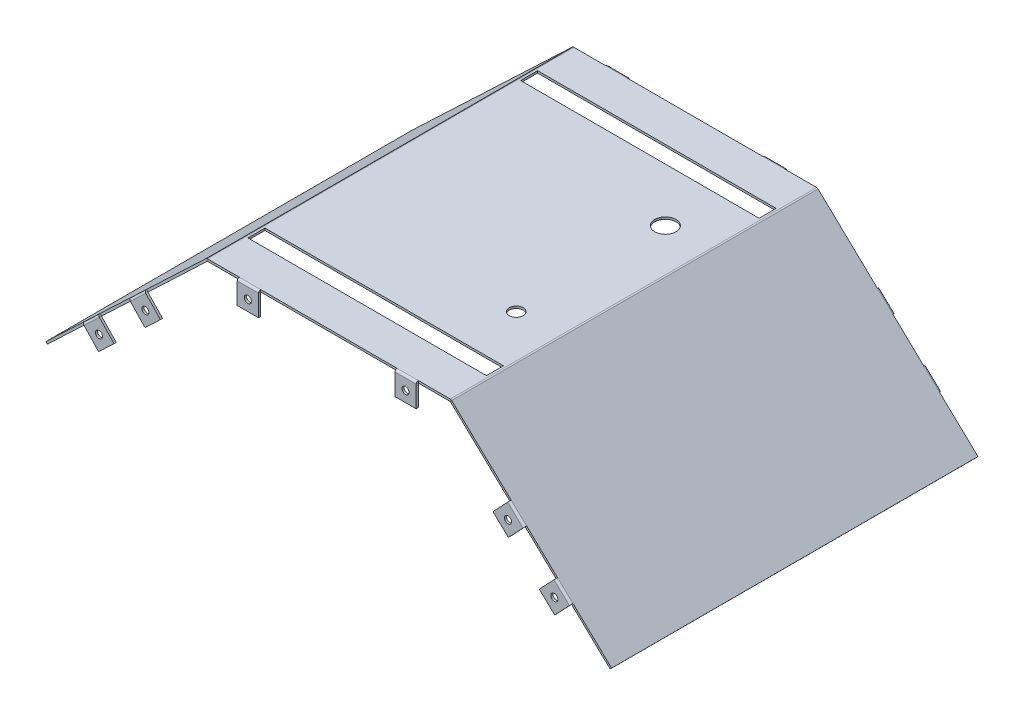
ISO-10303-21;
HEADER;
FILE_DESCRIPTION(('STEP AP214'),'2;1');
FILE_NAME('part.step','',(''),(''),'','','');
FILE_SCHEMA(('AUTOMOTIVE_DESIGN { 1 0 10303 214 1 1 1 1 }'));
ENDSEC;
DATA;
#1=APPLICATION_CONTEXT('core data for automotive mechanical design processes');
#2=APPLICATION_PROTOCOL_DEFINITION('international standard','automotive_design',2000,#1);
#3=PRODUCT_CONTEXT('',#1,'mechanical');
#4=PRODUCT('Part','Part','',(#3));
#5=PRODUCT_RELATED_PRODUCT_CATEGORY('part','',(#4));
#6=PRODUCT_DEFINITION_FORMATION('','',#4);
#7=PRODUCT_DEFINITION_CONTEXT('part definition',#1,'design');
#8=PRODUCT_DEFINITION('design','',#6,#7);
#9=PRODUCT_DEFINITION_SHAPE('','',#8);
#10=(LENGTH_UNIT() NAMED_UNIT(*) SI_UNIT(.MILLI.,.METRE.));
#11=(NAMED_UNIT(*) PLANE_ANGLE_UNIT() SI_UNIT($,.RADIAN.));
#12=(NAMED_UNIT(*) SI_UNIT($,.STERADIAN.) SOLID_ANGLE_UNIT());
#13=UNCERTAINTY_MEASURE_WITH_UNIT(LENGTH_MEASURE(1.E-05),#10,'distance_accuracy_value','');
#14=(GEOMETRIC_REPRESENTATION_CONTEXT(3) GLOBAL_UNCERTAINTY_ASSIGNED_CONTEXT((#13)) GLOBAL_UNIT_ASSIGNED_CONTEXT((#10,
#11,#12)) REPRESENTATION_CONTEXT('',''));
#15=CARTESIAN_POINT('',(0.,0.,0.));
#16=DIRECTION('',(0.,0.,1.));
#17=DIRECTION('',(1.,0.,0.));
#18=AXIS2_PLACEMENT_3D('',#15,#16,#17);
#19=CARTESIAN_POINT('',(-28.6152946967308,-25.7762875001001,0.));
#20=DIRECTION('',(0.688354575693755,-0.725374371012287,0.));
#21=DIRECTION('',(0.,0.,-1.));
#22=AXIS2_PLACEMENT_3D('',#19,#20,#21);
#23=PLANE('',#22);
#24=DIRECTION('',(0.725374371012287,0.688354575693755,0.));
#25=VECTOR('',#24,1.);
#26=CARTESIAN_POINT('',(-57.6302695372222,-53.3104705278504,0.));
#27=LINE('',#26,#25);
#28=CARTESIAN_POINT('',(-75.7646288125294,-70.5193349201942,0.));
#29=VERTEX_POINT('',#28);
#30=CARTESIAN_POINT('',(-57.6302695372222,-53.3104705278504,3.1671463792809E-12));
#31=VERTEX_POINT('',#30);
#32=EDGE_CURVE('E1171',#29,#31,#27,.T.);
#33=ORIENTED_EDGE('',*,*,#32,.T.);
#34=DIRECTION('',(0.725374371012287,0.688354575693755,0.));
#35=VECTOR('',#34,1.);
#36=CARTESIAN_POINT('',(-28.6152946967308,-25.7762875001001,0.));
#37=LINE('',#36,#35);
#38=CARTESIAN_POINT('',(-50.3765258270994,-46.4269247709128,0.));
#39=VERTEX_POINT('',#38);
#40=EDGE_CURVE('E1525',#31,#39,#37,.T.);
#41=ORIENTED_EDGE('',*,*,#40,.T.);
#42=DIRECTION('',(0.725374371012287,0.688354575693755,0.));
#43=VECTOR('',#42,1.);
#44=CARTESIAN_POINT('',(-35.8690384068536,-32.6598332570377,0.));
#45=LINE('',#44,#43);
#46=CARTESIAN_POINT('',(-35.8690384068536,-32.6598332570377,0.));
#47=VERTEX_POINT('',#46);
#48=EDGE_CURVE('E1168',#39,#47,#45,.T.);
#49=ORIENTED_EDGE('',*,*,#48,.T.);
#50=DIRECTION('',(0.725374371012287,0.688354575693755,0.));
#51=VECTOR('',#50,1.);
#52=CARTESIAN_POINT('',(-28.6152946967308,-25.7762875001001,0.));
#53=LINE('',#52,#51);
#54=CARTESIAN_POINT('',(-28.6152946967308,-25.7762875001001,3.16405770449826E-12));
#55=VERTEX_POINT('',#54);
#56=EDGE_CURVE('E1534',#47,#55,#53,.T.);
#57=ORIENTED_EDGE('',*,*,#56,.T.);
#58=DIRECTION('',(0.725374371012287,0.688354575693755,0.));
#59=VECTOR('',#58,1.);
#60=CARTESIAN_POINT('',(-0.688381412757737,0.725363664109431,0.));
#61=LINE('',#60,#59);
#62=CARTESIAN_POINT('',(-0.688659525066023,0.725099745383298,0.));
#63=VERTEX_POINT('',#62);
#64=EDGE_CURVE('E1165',#55,#63,#61,.T.);
#65=ORIENTED_EDGE('',*,*,#64,.T.);
#66=DIRECTION('',(0.,0.,1.));
#67=VECTOR('',#66,1.);
#68=CARTESIAN_POINT('',(-0.688659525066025,0.725099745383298,0.));
#69=LINE('',#68,#67);
#70=CARTESIAN_POINT('',(-0.688659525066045,0.725099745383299,-172.));
#71=VERTEX_POINT('',#70);
#72=EDGE_CURVE('E1155',#71,#63,#69,.T.);
#73=ORIENTED_EDGE('',*,*,#72,.F.);
#74=DIRECTION('',(-0.725374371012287,-0.688354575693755,0.));
#75=VECTOR('',#74,1.);
#76=CARTESIAN_POINT('',(-0.688381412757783,0.725363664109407,-172.));
#77=LINE('',#76,#75);
#78=CARTESIAN_POINT('',(-28.6152946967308,-25.7762875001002,-171.999999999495));
#79=VERTEX_POINT('',#78);
#80=EDGE_CURVE('E1181',#71,#79,#77,.T.);
#81=ORIENTED_EDGE('',*,*,#80,.T.);
#82=DIRECTION('',(0.725374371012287,0.688354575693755,0.));
#83=VECTOR('',#82,1.);
#84=CARTESIAN_POINT('',(-28.6152946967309,-25.7762875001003,-172.));
#85=LINE('',#84,#83);
#86=CARTESIAN_POINT('',(-35.8690384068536,-32.6598332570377,-171.999999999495));
#87=VERTEX_POINT('',#86);
#88=EDGE_CURVE('E1515',#87,#79,#85,.T.);
#89=ORIENTED_EDGE('',*,*,#88,.F.);
#90=DIRECTION('',(-0.725374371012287,-0.688354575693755,0.));
#91=VECTOR('',#90,1.);
#92=CARTESIAN_POINT('',(-35.8690384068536,-32.6598332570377,-172.));
#93=LINE('',#92,#91);
#94=CARTESIAN_POINT('',(-50.3765258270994,-46.4269247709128,-171.999999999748));
#95=VERTEX_POINT('',#94);
#96=EDGE_CURVE('E1178',#87,#95,#93,.T.);
#97=ORIENTED_EDGE('',*,*,#96,.T.);
#98=DIRECTION('',(0.725374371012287,0.688354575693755,0.));
#99=VECTOR('',#98,1.);
#100=CARTESIAN_POINT('',(-28.6152946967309,-25.7762875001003,-172.));
#101=LINE('',#100,#99);
#102=CARTESIAN_POINT('',(-57.6302695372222,-53.3104705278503,-172.));
#103=VERTEX_POINT('',#102);
#104=EDGE_CURVE('E1505',#103,#95,#101,.T.);
#105=ORIENTED_EDGE('',*,*,#104,.F.);
#106=DIRECTION('',(-0.725374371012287,-0.688354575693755,0.));
#107=VECTOR('',#106,1.);
#108=CARTESIAN_POINT('',(-57.6302695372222,-53.3104705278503,-172.));
#109=LINE('',#108,#107);
#110=CARTESIAN_POINT('',(-75.7646288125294,-70.5193349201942,-172.));
#111=VERTEX_POINT('',#110);
#112=EDGE_CURVE('E1176',#103,#111,#109,.T.);
#113=ORIENTED_EDGE('',*,*,#112,.T.);
#114=DIRECTION('',(0.,0.,1.));
#115=VECTOR('',#114,1.);
#116=CARTESIAN_POINT('',(-75.7646288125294,-70.5193349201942,0.));
#117=LINE('',#116,#115);
#118=EDGE_CURVE('E1174',#111,#29,#117,.T.);
#119=ORIENTED_EDGE('',*,*,#118,.T.);
#120=EDGE_LOOP('',(#33,#41,#49,#57,#65,#73,#81,#89,#97,#105,#113,#119));
#121=FACE_BOUND('',#120,.T.);
#122=ADVANCED_FACE('F73',(#121),#23,.F.);
#123=CARTESIAN_POINT('',(-27.926940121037,-26.5016618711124,0.));
#124=DIRECTION('',(0.688354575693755,-0.725374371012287,0.));
#125=DIRECTION('',(0.,0.,-1.));
#126=AXIS2_PLACEMENT_3D('',#123,#124,#125);
#127=PLANE('',#126);
#128=DIRECTION('',(0.725374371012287,0.688354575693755,0.));
#129=VECTOR('',#128,1.);
#130=CARTESIAN_POINT('',(-27.926940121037,-26.5016618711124,0.));
#131=LINE('',#130,#129);
#132=CARTESIAN_POINT('',(-56.9419149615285,-54.0358448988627,0.));
#133=VERTEX_POINT('',#132);
#134=CARTESIAN_POINT('',(-49.6881712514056,-47.1522991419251,0.));
#135=VERTEX_POINT('',#134);
#136=EDGE_CURVE('E95',#133,#135,#131,.T.);
#137=ORIENTED_EDGE('',*,*,#136,.F.);
#138=DIRECTION('',(0.725374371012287,0.688354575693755,0.));
#139=VECTOR('',#138,1.);
#140=CARTESIAN_POINT('',(-56.9419149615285,-54.0358448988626,0.));
#141=LINE('',#140,#139);
#142=CARTESIAN_POINT('',(-75.0762742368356,-71.2447092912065,0.));
#143=VERTEX_POINT('',#142);
#144=EDGE_CURVE('E1197',#143,#133,#141,.T.);
#145=ORIENTED_EDGE('',*,*,#144,.F.);
#146=DIRECTION('',(0.,0.,1.));
#147=VECTOR('',#146,1.);
#148=CARTESIAN_POINT('',(-75.0762742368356,-71.2447092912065,0.));
#149=LINE('',#148,#147);
#150=CARTESIAN_POINT('',(-75.0762742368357,-71.2447092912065,-172.));
#151=VERTEX_POINT('',#150);
#152=EDGE_CURVE('E1192',#151,#143,#149,.T.);
#153=ORIENTED_EDGE('',*,*,#152,.F.);
#154=DIRECTION('',(-0.725374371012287,-0.688354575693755,0.));
#155=VECTOR('',#154,1.);
#156=CARTESIAN_POINT('',(-56.9419149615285,-54.0358448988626,-172.));
#157=LINE('',#156,#155);
#158=CARTESIAN_POINT('',(-56.9419149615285,-54.0358448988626,-172.));
#159=VERTEX_POINT('',#158);
#160=EDGE_CURVE('E1187',#159,#151,#157,.T.);
#161=ORIENTED_EDGE('',*,*,#160,.F.);
#162=DIRECTION('',(0.725374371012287,0.688354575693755,0.));
#163=VECTOR('',#162,1.);
#164=CARTESIAN_POINT('',(-27.9269401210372,-26.5016618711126,-172.));
#165=LINE('',#164,#163);
#166=CARTESIAN_POINT('',(-49.6881712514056,-47.1522991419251,-172.));
#167=VERTEX_POINT('',#166);
#168=EDGE_CURVE('E1509',#159,#167,#165,.T.);
#169=ORIENTED_EDGE('',*,*,#168,.T.);
#170=DIRECTION('',(-0.725374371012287,-0.688354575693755,0.));
#171=VECTOR('',#170,1.);
#172=CARTESIAN_POINT('',(-35.1806838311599,-33.38520762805,-172.));
#173=LINE('',#172,#171);
#174=CARTESIAN_POINT('',(-35.1806838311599,-33.38520762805,-172.));
#175=VERTEX_POINT('',#174);
#176=EDGE_CURVE('E1184',#175,#167,#173,.T.);
#177=ORIENTED_EDGE('',*,*,#176,.F.);
#178=DIRECTION('',(0.725374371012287,0.688354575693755,0.));
#179=VECTOR('',#178,1.);
#180=CARTESIAN_POINT('',(-27.9269401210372,-26.5016618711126,-172.));
#181=LINE('',#180,#179);
#182=CARTESIAN_POINT('',(-27.926940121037,-26.5016618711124,-172.));
#183=VERTEX_POINT('',#182);
#184=EDGE_CURVE('E1519',#175,#183,#181,.T.);
#185=ORIENTED_EDGE('',*,*,#184,.T.);
#186=DIRECTION('',(-0.725374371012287,-0.688354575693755,0.));
#187=VECTOR('',#186,1.);
#188=CARTESIAN_POINT('',(-2.68370640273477E-05,-1.07069028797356E-05,-172.));
#189=LINE('',#188,#187);
#190=CARTESIAN_POINT('',(-0.000304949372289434,-0.000274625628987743,-172.));
#191=VERTEX_POINT('',#190);
#192=EDGE_CURVE('E1162',#191,#183,#189,.T.);
#193=ORIENTED_EDGE('',*,*,#192,.F.);
#194=DIRECTION('',(0.,0.,1.));
#195=VECTOR('',#194,1.);
#196=CARTESIAN_POINT('',(-0.000304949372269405,-0.00027462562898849,0.));
#197=LINE('',#196,#195);
#198=CARTESIAN_POINT('',(-0.000304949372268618,-0.000274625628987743,0.));
#199=VERTEX_POINT('',#198);
#200=EDGE_CURVE('E1159',#191,#199,#197,.T.);
#201=ORIENTED_EDGE('',*,*,#200,.T.);
#202=DIRECTION('',(0.725374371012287,0.688354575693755,0.));
#203=VECTOR('',#202,1.);
#204=CARTESIAN_POINT('',(-2.68370639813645E-05,-1.07069028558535E-05,0.));
#205=LINE('',#204,#203);
#206=CARTESIAN_POINT('',(-27.926940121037,-26.5016618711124,0.));
#207=VERTEX_POINT('',#206);
#208=EDGE_CURVE('E1156',#207,#199,#205,.T.);
#209=ORIENTED_EDGE('',*,*,#208,.F.);
#210=DIRECTION('',(0.725374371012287,0.688354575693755,0.));
#211=VECTOR('',#210,1.);
#212=CARTESIAN_POINT('',(-27.926940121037,-26.5016618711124,0.));
#213=LINE('',#212,#211);
#214=CARTESIAN_POINT('',(-35.1806838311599,-33.38520762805,0.));
#215=VERTEX_POINT('',#214);
#216=EDGE_CURVE('E81',#215,#207,#213,.T.);
#217=ORIENTED_EDGE('',*,*,#216,.F.);
#218=DIRECTION('',(0.725374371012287,0.688354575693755,0.));
#219=VECTOR('',#218,1.);
#220=CARTESIAN_POINT('',(-35.1806838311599,-33.38520762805,0.));
#221=LINE('',#220,#219);
#222=EDGE_CURVE('E1200',#135,#215,#221,.T.);
#223=ORIENTED_EDGE('',*,*,#222,.F.);
#224=EDGE_LOOP('',(#137,#145,#153,#161,#169,#177,#185,#193,#201,#209,#217,#223));
#225=FACE_BOUND('',#224,.T.);
#226=ADVANCED_FACE('F75',(#225),#127,.T.);
#227=CARTESIAN_POINT('',(4.06878983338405,105.699436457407,0.));
#228=DIRECTION('',(-0.688354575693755,-0.725374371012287,0.));
#229=DIRECTION('',(0.,0.,-1.));
#230=AXIS2_PLACEMENT_3D('',#227,#228,#229);
#231=PLANE('',#230);
#232=DIRECTION('',(0.725374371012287,-0.688354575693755,0.));
#233=VECTOR('',#232,1.);
#234=CARTESIAN_POINT('',(103.807765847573,11.0506822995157,0.));
#235=LINE('',#234,#233);
#236=CARTESIAN_POINT('',(114.688659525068,0.725099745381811,0.));
#237=VERTEX_POINT('',#236);
#238=CARTESIAN_POINT('',(142.615294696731,-25.7762875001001,0.));
#239=VERTEX_POINT('',#238);
#240=EDGE_CURVE('E1248',#237,#239,#235,.T.);
#241=ORIENTED_EDGE('',*,*,#240,.T.);
#242=DIRECTION('',(0.725374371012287,-0.688354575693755,0.));
#243=VECTOR('',#242,1.);
#244=CARTESIAN_POINT('',(4.06878983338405,105.699436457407,0.));
#245=LINE('',#244,#243);
#246=CARTESIAN_POINT('',(149.869038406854,-32.6598332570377,0.));
#247=VERTEX_POINT('',#246);
#248=EDGE_CURVE('E1485',#239,#247,#245,.T.);
#249=ORIENTED_EDGE('',*,*,#248,.T.);
#250=DIRECTION('',(0.725374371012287,-0.688354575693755,0.));
#251=VECTOR('',#250,1.);
#252=CARTESIAN_POINT('',(149.869038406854,-32.6598332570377,0.));
#253=LINE('',#252,#251);
#254=CARTESIAN_POINT('',(164.376525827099,-46.4269247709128,0.));
#255=VERTEX_POINT('',#254);
#256=EDGE_CURVE('E1245',#247,#255,#253,.T.);
#257=ORIENTED_EDGE('',*,*,#256,.T.);
#258=DIRECTION('',(0.725374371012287,-0.688354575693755,0.));
#259=VECTOR('',#258,1.);
#260=CARTESIAN_POINT('',(4.06878983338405,105.699436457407,0.));
#261=LINE('',#260,#259);
#262=CARTESIAN_POINT('',(171.630269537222,-53.3104705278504,0.));
#263=VERTEX_POINT('',#262);
#264=EDGE_CURVE('E1495',#255,#263,#261,.T.);
#265=ORIENTED_EDGE('',*,*,#264,.T.);
#266=DIRECTION('',(0.725374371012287,-0.688354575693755,0.));
#267=VECTOR('',#266,1.);
#268=CARTESIAN_POINT('',(171.630269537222,-53.3104705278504,0.));
#269=LINE('',#268,#267);
#270=CARTESIAN_POINT('',(189.764628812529,-70.5193349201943,0.));
#271=VERTEX_POINT('',#270);
#272=EDGE_CURVE('E1243',#263,#271,#269,.T.);
#273=ORIENTED_EDGE('',*,*,#272,.T.);
#274=DIRECTION('',(0.,0.,-1.));
#275=VECTOR('',#274,1.);
#276=CARTESIAN_POINT('',(189.764628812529,-70.5193349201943,0.));
#277=LINE('',#276,#275);
#278=CARTESIAN_POINT('',(189.764628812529,-70.5193349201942,-172.));
#279=VERTEX_POINT('',#278);
#280=EDGE_CURVE('E1241',#271,#279,#277,.T.);
#281=ORIENTED_EDGE('',*,*,#280,.T.);
#282=DIRECTION('',(-0.725374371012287,0.688354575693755,0.));
#283=VECTOR('',#282,1.);
#284=CARTESIAN_POINT('',(171.630269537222,-53.3104705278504,-172.));
#285=LINE('',#284,#283);
#286=CARTESIAN_POINT('',(171.630269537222,-53.3104705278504,-172.));
#287=VERTEX_POINT('',#286);
#288=EDGE_CURVE('E1238',#279,#287,#285,.T.);
#289=ORIENTED_EDGE('',*,*,#288,.T.);
#290=DIRECTION('',(0.725374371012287,-0.688354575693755,0.));
#291=VECTOR('',#290,1.);
#292=CARTESIAN_POINT('',(4.06878983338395,105.699436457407,-172.));
#293=LINE('',#292,#291);
#294=CARTESIAN_POINT('',(164.376525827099,-46.4269247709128,-172.));
#295=VERTEX_POINT('',#294);
#296=EDGE_CURVE('E1475',#295,#287,#293,.T.);
#297=ORIENTED_EDGE('',*,*,#296,.F.);
#298=DIRECTION('',(-0.725374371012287,0.688354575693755,0.));
#299=VECTOR('',#298,1.);
#300=CARTESIAN_POINT('',(149.869038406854,-32.6598332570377,-172.));
#301=LINE('',#300,#299);
#302=CARTESIAN_POINT('',(149.869038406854,-32.6598332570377,-171.999999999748));
#303=VERTEX_POINT('',#302);
#304=EDGE_CURVE('E1235',#295,#303,#301,.T.);
#305=ORIENTED_EDGE('',*,*,#304,.T.);
#306=DIRECTION('',(0.725374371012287,-0.688354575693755,0.));
#307=VECTOR('',#306,1.);
#308=CARTESIAN_POINT('',(4.06878983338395,105.699436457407,-172.));
#309=LINE('',#308,#307);
#310=CARTESIAN_POINT('',(142.615294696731,-25.7762875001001,-172.));
#311=VERTEX_POINT('',#310);
#312=EDGE_CURVE('E1465',#311,#303,#309,.T.);
#313=ORIENTED_EDGE('',*,*,#312,.F.);
#314=DIRECTION('',(-0.725374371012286,0.688354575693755,0.));
#315=VECTOR('',#314,1.);
#316=CARTESIAN_POINT('',(114.688381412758,0.725363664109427,-172.));
#317=LINE('',#316,#315);
#318=CARTESIAN_POINT('',(114.688659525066,0.72509974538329,-172.));
#319=VERTEX_POINT('',#318);
#320=EDGE_CURVE('E1254',#311,#319,#317,.T.);
#321=ORIENTED_EDGE('',*,*,#320,.T.);
#322=DIRECTION('',(0.,0.,1.));
#323=VECTOR('',#322,1.);
#324=CARTESIAN_POINT('',(114.688659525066,0.725099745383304,0.));
#325=LINE('',#324,#323);
#326=EDGE_CURVE('E1251',#319,#237,#325,.T.);
#327=ORIENTED_EDGE('',*,*,#326,.T.);
#328=EDGE_LOOP('',(#241,#249,#257,#265,#273,#281,#289,#297,#305,#313,#321,#327));
#329=FACE_BOUND('',#328,.T.);
#330=ADVANCED_FACE('F1644',(#329),#231,.F.);
#331=CARTESIAN_POINT('',(3.38043525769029,104.974062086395,0.));
#332=DIRECTION('',(-0.688354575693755,-0.725374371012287,0.));
#333=DIRECTION('',(0.,0.,-1.));
#334=AXIS2_PLACEMENT_3D('',#331,#332,#333);
#335=PLANE('',#334);
#336=DIRECTION('',(0.725374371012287,-0.688354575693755,0.));
#337=VECTOR('',#336,1.);
#338=CARTESIAN_POINT('',(3.38043525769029,104.974062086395,0.));
#339=LINE('',#338,#337);
#340=CARTESIAN_POINT('',(141.926940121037,-26.5016618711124,0.));
#341=VERTEX_POINT('',#340);
#342=CARTESIAN_POINT('',(149.18068383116,-33.38520762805,0.));
#343=VERTEX_POINT('',#342);
#344=EDGE_CURVE('E1490',#341,#343,#339,.T.);
#345=ORIENTED_EDGE('',*,*,#344,.F.);
#346=DIRECTION('',(0.725374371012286,-0.688354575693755,0.));
#347=VECTOR('',#346,1.);
#348=CARTESIAN_POINT('',(114.000026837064,-1.07069028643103E-05,0.));
#349=LINE('',#348,#347);
#350=CARTESIAN_POINT('',(114.000304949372,-0.00027462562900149,0.));
#351=VERTEX_POINT('',#350);
#352=EDGE_CURVE('E1229',#351,#341,#349,.T.);
#353=ORIENTED_EDGE('',*,*,#352,.F.);
#354=DIRECTION('',(0.,0.,1.));
#355=VECTOR('',#354,1.);
#356=CARTESIAN_POINT('',(114.000304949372,-0.000274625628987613,0.));
#357=LINE('',#356,#355);
#358=CARTESIAN_POINT('',(114.000304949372,-0.000274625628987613,-172.));
#359=VERTEX_POINT('',#358);
#360=EDGE_CURVE('E1218',#359,#351,#357,.T.);
#361=ORIENTED_EDGE('',*,*,#360,.F.);
#362=DIRECTION('',(-0.725374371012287,0.688354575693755,0.));
#363=VECTOR('',#362,1.);
#364=CARTESIAN_POINT('',(103.11941127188,10.3253079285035,-172.));
#365=LINE('',#364,#363);
#366=CARTESIAN_POINT('',(141.926940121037,-26.5016618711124,-172.));
#367=VERTEX_POINT('',#366);
#368=EDGE_CURVE('E1227',#367,#359,#365,.T.);
#369=ORIENTED_EDGE('',*,*,#368,.F.);
#370=DIRECTION('',(0.725374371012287,-0.688354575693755,0.));
#371=VECTOR('',#370,1.);
#372=CARTESIAN_POINT('',(3.38043525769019,104.974062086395,-172.));
#373=LINE('',#372,#371);
#374=CARTESIAN_POINT('',(149.18068383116,-33.38520762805,-172.));
#375=VERTEX_POINT('',#374);
#376=EDGE_CURVE('E1469',#367,#375,#373,.T.);
#377=ORIENTED_EDGE('',*,*,#376,.T.);
#378=DIRECTION('',(-0.725374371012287,0.688354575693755,0.));
#379=VECTOR('',#378,1.);
#380=CARTESIAN_POINT('',(149.18068383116,-33.38520762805,-172.));
#381=LINE('',#380,#379);
#382=CARTESIAN_POINT('',(163.688171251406,-47.1522991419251,-172.));
#383=VERTEX_POINT('',#382);
#384=EDGE_CURVE('E1272',#383,#375,#381,.T.);
#385=ORIENTED_EDGE('',*,*,#384,.F.);
#386=DIRECTION('',(0.725374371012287,-0.688354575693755,0.));
#387=VECTOR('',#386,1.);
#388=CARTESIAN_POINT('',(3.38043525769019,104.974062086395,-172.));
#389=LINE('',#388,#387);
#390=CARTESIAN_POINT('',(170.941914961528,-54.0358448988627,-172.));
#391=VERTEX_POINT('',#390);
#392=EDGE_CURVE('E1479',#383,#391,#389,.T.);
#393=ORIENTED_EDGE('',*,*,#392,.T.);
#394=DIRECTION('',(-0.725374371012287,0.688354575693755,0.));
#395=VECTOR('',#394,1.);
#396=CARTESIAN_POINT('',(170.941914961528,-54.0358448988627,-172.));
#397=LINE('',#396,#395);
#398=CARTESIAN_POINT('',(189.076274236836,-71.2447092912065,-172.));
#399=VERTEX_POINT('',#398);
#400=EDGE_CURVE('E1269',#399,#391,#397,.T.);
#401=ORIENTED_EDGE('',*,*,#400,.F.);
#402=DIRECTION('',(0.,0.,-1.));
#403=VECTOR('',#402,1.);
#404=CARTESIAN_POINT('',(189.076274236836,-71.2447092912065,0.));
#405=LINE('',#404,#403);
#406=CARTESIAN_POINT('',(189.076274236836,-71.2447092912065,0.));
#407=VERTEX_POINT('',#406);
#408=EDGE_CURVE('E1264',#407,#399,#405,.T.);
#409=ORIENTED_EDGE('',*,*,#408,.F.);
#410=DIRECTION('',(0.725374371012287,-0.688354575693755,0.));
#411=VECTOR('',#410,1.);
#412=CARTESIAN_POINT('',(170.941914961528,-54.0358448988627,0.));
#413=LINE('',#412,#411);
#414=CARTESIAN_POINT('',(170.941914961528,-54.0358448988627,0.));
#415=VERTEX_POINT('',#414);
#416=EDGE_CURVE('E1259',#415,#407,#413,.T.);
#417=ORIENTED_EDGE('',*,*,#416,.F.);
#418=DIRECTION('',(0.725374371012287,-0.688354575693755,0.));
#419=VECTOR('',#418,1.);
#420=CARTESIAN_POINT('',(3.38043525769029,104.974062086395,0.));
#421=LINE('',#420,#419);
#422=CARTESIAN_POINT('',(163.688171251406,-47.1522991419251,0.));
#423=VERTEX_POINT('',#422);
#424=EDGE_CURVE('E1500',#423,#415,#421,.T.);
#425=ORIENTED_EDGE('',*,*,#424,.F.);
#426=DIRECTION('',(0.725374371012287,-0.688354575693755,0.));
#427=VECTOR('',#426,1.);
#428=CARTESIAN_POINT('',(149.18068383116,-33.38520762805,0.));
#429=LINE('',#428,#427);
#430=EDGE_CURVE('E1256',#343,#423,#429,.T.);
#431=ORIENTED_EDGE('',*,*,#430,.F.);
#432=EDGE_LOOP('',(#345,#353,#361,#369,#377,#385,#393,#401,#409,#417,#425,#431));
#433=FACE_BOUND('',#432,.T.);
#434=ADVANCED_FACE('F1646',(#433),#335,.T.);
#435=CARTESIAN_POINT('',(-38.5,0.,0.));
#436=DIRECTION('',(0.,-1.,0.));
#437=DIRECTION('',(0.,0.,-1.));
#438=AXIS2_PLACEMENT_3D('',#435,#436,#437);
#439=PLANE('',#438);
#440=CARTESIAN_POINT('',(94.,0.,-121.));
#441=DIRECTION('',(0.,1.,0.));
#442=DIRECTION('',(0.,0.,1.));
#443=AXIS2_PLACEMENT_3D('',#440,#441,#442);
#444=CIRCLE('',#443,5.00000000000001);
#445=CARTESIAN_POINT('',(94.,0.,-116.));
#446=VERTEX_POINT('',#445);
#447=EDGE_CURVE('E1292',#446,#446,#444,.T.);
#448=ORIENTED_EDGE('',*,*,#447,.T.);
#449=EDGE_LOOP('',(#448));
#450=FACE_BOUND('',#449,.T.);
#451=DIRECTION('',(0.,0.,-1.));
#452=VECTOR('',#451,1.);
#453=CARTESIAN_POINT('',(113.,0.,-26.));
#454=LINE('',#453,#452);
#455=CARTESIAN_POINT('',(113.,0.,-18.));
#456=VERTEX_POINT('',#455);
#457=CARTESIAN_POINT('',(113.,0.,-26.));
#458=VERTEX_POINT('',#457);
#459=EDGE_CURVE('E1335',#456,#458,#454,.T.);
#460=ORIENTED_EDGE('',*,*,#459,.T.);
#461=DIRECTION('',(-1.,0.,0.));
#462=VECTOR('',#461,1.);
#463=CARTESIAN_POINT('',(1.00000000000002,0.,-26.));
#464=LINE('',#463,#462);
#465=CARTESIAN_POINT('',(1.00000000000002,0.,-26.));
#466=VERTEX_POINT('',#465);
#467=EDGE_CURVE('E1331',#458,#466,#464,.T.);
#468=ORIENTED_EDGE('',*,*,#467,.T.);
#469=DIRECTION('',(0.,0.,1.));
#470=VECTOR('',#469,1.);
#471=CARTESIAN_POINT('',(1.00000000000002,0.,-26.));
#472=LINE('',#471,#470);
#473=CARTESIAN_POINT('',(1.00000000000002,0.,-18.));
#474=VERTEX_POINT('',#473);
#475=EDGE_CURVE('E1345',#466,#474,#472,.T.);
#476=ORIENTED_EDGE('',*,*,#475,.T.);
#477=DIRECTION('',(1.,0.,0.));
#478=VECTOR('',#477,1.);
#479=CARTESIAN_POINT('',(1.00000000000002,0.,-18.));
#480=LINE('',#479,#478);
#481=EDGE_CURVE('E1348',#474,#456,#480,.T.);
#482=ORIENTED_EDGE('',*,*,#481,.T.);
#483=EDGE_LOOP('',(#460,#468,#476,#482));
#484=FACE_BOUND('',#483,.T.);
#485=DIRECTION('',(-1.,0.,0.));
#486=VECTOR('',#485,1.);
#487=CARTESIAN_POINT('',(1.,0.,-154.));
#488=LINE('',#487,#486);
#489=CARTESIAN_POINT('',(113.,0.,-154.));
#490=VERTEX_POINT('',#489);
#491=CARTESIAN_POINT('',(1.,0.,-154.));
#492=VERTEX_POINT('',#491);
#493=EDGE_CURVE('E1304',#490,#492,#488,.T.);
#494=ORIENTED_EDGE('',*,*,#493,.T.);
#495=DIRECTION('',(0.,0.,1.));
#496=VECTOR('',#495,1.);
#497=CARTESIAN_POINT('',(1.,0.,-154.));
#498=LINE('',#497,#496);
#499=CARTESIAN_POINT('',(1.,0.,-146.));
#500=VERTEX_POINT('',#499);
#501=EDGE_CURVE('E1298',#492,#500,#498,.T.);
#502=ORIENTED_EDGE('',*,*,#501,.T.);
#503=DIRECTION('',(1.,0.,0.));
#504=VECTOR('',#503,1.);
#505=CARTESIAN_POINT('',(1.,0.,-146.));
#506=LINE('',#505,#504);
#507=CARTESIAN_POINT('',(113.,0.,-146.));
#508=VERTEX_POINT('',#507);
#509=EDGE_CURVE('E1314',#500,#508,#506,.T.);
#510=ORIENTED_EDGE('',*,*,#509,.T.);
#511=DIRECTION('',(0.,0.,-1.));
#512=VECTOR('',#511,1.);
#513=CARTESIAN_POINT('',(113.,0.,-154.));
#514=LINE('',#513,#512);
#515=EDGE_CURVE('E1317',#508,#490,#514,.T.);
#516=ORIENTED_EDGE('',*,*,#515,.T.);
#517=EDGE_LOOP('',(#494,#502,#510,#516));
#518=FACE_BOUND('',#517,.T.);
#519=CARTESIAN_POINT('',(94.,0.,-51.));
#520=DIRECTION('',(0.,1.,0.));
#521=DIRECTION('',(0.,0.,1.));
#522=AXIS2_PLACEMENT_3D('',#519,#520,#521);
#523=CIRCLE('',#522,3.25000000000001);
#524=CARTESIAN_POINT('',(94.,0.,-47.75));
#525=VERTEX_POINT('',#524);
#526=EDGE_CURVE('E1284',#525,#525,#523,.T.);
#527=ORIENTED_EDGE('',*,*,#526,.T.);
#528=EDGE_LOOP('',(#527));
#529=FACE_BOUND('',#528,.T.);
#530=DIRECTION('',(-1.,0.,0.));
#531=VECTOR('',#530,1.);
#532=CARTESIAN_POINT('',(25.,0.,-172.));
#533=LINE('',#532,#531);
#534=CARTESIAN_POINT('',(89.,0.,-172.));
#535=VERTEX_POINT('',#534);
#536=CARTESIAN_POINT('',(25.,0.,-172.));
#537=VERTEX_POINT('',#536);
#538=EDGE_CURVE('E1377',#535,#537,#533,.T.);
#539=ORIENTED_EDGE('',*,*,#538,.F.);
#540=DIRECTION('',(1.,0.,0.));
#541=VECTOR('',#540,1.);
#542=CARTESIAN_POINT('',(-38.5,0.,-172.));
#543=LINE('',#542,#541);
#544=CARTESIAN_POINT('',(99.,0.,-172.));
#545=VERTEX_POINT('',#544);
#546=EDGE_CURVE('E1460',#535,#545,#543,.T.);
#547=ORIENTED_EDGE('',*,*,#546,.T.);
#548=DIRECTION('',(-1.,0.,0.));
#549=VECTOR('',#548,1.);
#550=CARTESIAN_POINT('',(99.,0.,-172.));
#551=LINE('',#550,#549);
#552=CARTESIAN_POINT('',(113.999616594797,0.,-172.));
#553=VERTEX_POINT('',#552);
#554=EDGE_CURVE('E1381',#553,#545,#551,.T.);
#555=ORIENTED_EDGE('',*,*,#554,.F.);
#556=DIRECTION('',(0.,0.,1.));
#557=VECTOR('',#556,1.);
#558=CARTESIAN_POINT('',(113.999616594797,0.,0.));
#559=LINE('',#558,#557);
#560=CARTESIAN_POINT('',(113.999616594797,0.,0.));
#561=VERTEX_POINT('',#560);
#562=EDGE_CURVE('E1388',#553,#561,#559,.T.);
#563=ORIENTED_EDGE('',*,*,#562,.T.);
#564=DIRECTION('',(1.,0.,0.));
#565=VECTOR('',#564,1.);
#566=CARTESIAN_POINT('',(114.,0.,0.));
#567=LINE('',#566,#565);
#568=CARTESIAN_POINT('',(99.,0.,0.));
#569=VERTEX_POINT('',#568);
#570=EDGE_CURVE('E1376',#569,#561,#567,.T.);
#571=ORIENTED_EDGE('',*,*,#570,.F.);
#572=DIRECTION('',(1.,0.,0.));
#573=VECTOR('',#572,1.);
#574=CARTESIAN_POINT('',(-38.5,0.,0.));
#575=LINE('',#574,#573);
#576=CARTESIAN_POINT('',(89.,0.,0.));
#577=VERTEX_POINT('',#576);
#578=EDGE_CURVE('E1437',#577,#569,#575,.T.);
#579=ORIENTED_EDGE('',*,*,#578,.F.);
#580=DIRECTION('',(1.,0.,0.));
#581=VECTOR('',#580,1.);
#582=CARTESIAN_POINT('',(25.,0.,0.));
#583=LINE('',#582,#581);
#584=CARTESIAN_POINT('',(25.,0.,0.));
#585=VERTEX_POINT('',#584);
#586=EDGE_CURVE('E1373',#585,#577,#583,.T.);
#587=ORIENTED_EDGE('',*,*,#586,.F.);
#588=DIRECTION('',(1.,0.,0.));
#589=VECTOR('',#588,1.);
#590=CARTESIAN_POINT('',(-38.5,0.,0.));
#591=LINE('',#590,#589);
#592=CARTESIAN_POINT('',(15.,0.,0.));
#593=VERTEX_POINT('',#592);
#594=EDGE_CURVE('E1425',#593,#585,#591,.T.);
#595=ORIENTED_EDGE('',*,*,#594,.F.);
#596=DIRECTION('',(1.,0.,0.));
#597=VECTOR('',#596,1.);
#598=CARTESIAN_POINT('',(0.,0.,0.));
#599=LINE('',#598,#597);
#600=CARTESIAN_POINT('',(0.000383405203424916,0.,0.));
#601=VERTEX_POINT('',#600);
#602=EDGE_CURVE('E1362',#601,#593,#599,.T.);
#603=ORIENTED_EDGE('',*,*,#602,.F.);
#604=DIRECTION('',(0.,0.,1.));
#605=VECTOR('',#604,1.);
#606=CARTESIAN_POINT('',(0.000383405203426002,0.,0.));
#607=LINE('',#606,#605);
#608=CARTESIAN_POINT('',(0.000383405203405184,0.,-172.));
#609=VERTEX_POINT('',#608);
#610=EDGE_CURVE('E1406',#609,#601,#607,.T.);
#611=ORIENTED_EDGE('',*,*,#610,.F.);
#612=DIRECTION('',(-1.,0.,0.));
#613=VECTOR('',#612,1.);
#614=CARTESIAN_POINT('',(0.,0.,-172.));
#615=LINE('',#614,#613);
#616=CARTESIAN_POINT('',(15.,0.,-172.));
#617=VERTEX_POINT('',#616);
#618=EDGE_CURVE('E1380',#617,#609,#615,.T.);
#619=ORIENTED_EDGE('',*,*,#618,.F.);
#620=DIRECTION('',(1.,0.,0.));
#621=VECTOR('',#620,1.);
#622=CARTESIAN_POINT('',(-38.5,0.,-172.));
#623=LINE('',#622,#621);
#624=EDGE_CURVE('E1449',#617,#537,#623,.T.);
#625=ORIENTED_EDGE('',*,*,#624,.T.);
#626=EDGE_LOOP('',(#539,#547,#555,#563,#571,#579,#587,#595,#603,#611,#619,#625));
#627=FACE_BOUND('',#626,.T.);
#628=ADVANCED_FACE('F1649',(#450,#484,#518,#529,#627),#439,.T.);
#629=CARTESIAN_POINT('',(-38.5,1.,0.));
#630=DIRECTION('',(0.,-1.,0.));
#631=DIRECTION('',(0.,0.,-1.));
#632=AXIS2_PLACEMENT_3D('',#629,#630,#631);
#633=PLANE('',#632);
#634=DIRECTION('',(1.,0.,0.));
#635=VECTOR('',#634,1.);
#636=CARTESIAN_POINT('',(-38.5,1.,-172.));
#637=LINE('',#636,#635);
#638=CARTESIAN_POINT('',(89.,1.,-172.));
#639=VERTEX_POINT('',#638);
#640=CARTESIAN_POINT('',(99.,1.,-172.));
#641=VERTEX_POINT('',#640);
#642=EDGE_CURVE('E1454',#639,#641,#637,.T.);
#643=ORIENTED_EDGE('',*,*,#642,.F.);
#644=DIRECTION('',(-1.,0.,0.));
#645=VECTOR('',#644,1.);
#646=CARTESIAN_POINT('',(25.,1.,-172.));
#647=LINE('',#646,#645);
#648=CARTESIAN_POINT('',(25.,1.,-172.));
#649=VERTEX_POINT('',#648);
#650=EDGE_CURVE('E1368',#639,#649,#647,.T.);
#651=ORIENTED_EDGE('',*,*,#650,.T.);
#652=DIRECTION('',(1.,0.,0.));
#653=VECTOR('',#652,1.);
#654=CARTESIAN_POINT('',(-38.5,1.,-172.));
#655=LINE('',#654,#653);
#656=CARTESIAN_POINT('',(15.,1.,-172.));
#657=VERTEX_POINT('',#656);
#658=EDGE_CURVE('E1443',#657,#649,#655,.T.);
#659=ORIENTED_EDGE('',*,*,#658,.F.);
#660=DIRECTION('',(-1.,0.,0.));
#661=VECTOR('',#660,1.);
#662=CARTESIAN_POINT('',(0.,1.,-172.));
#663=LINE('',#662,#661);
#664=CARTESIAN_POINT('',(0.000383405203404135,1.,-172.));
#665=VERTEX_POINT('',#664);
#666=EDGE_CURVE('E1371',#657,#665,#663,.T.);
#667=ORIENTED_EDGE('',*,*,#666,.T.);
#668=DIRECTION('',(0.,0.,1.));
#669=VECTOR('',#668,1.);
#670=CARTESIAN_POINT('',(0.000383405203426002,1.,0.));
#671=LINE('',#670,#669);
#672=CARTESIAN_POINT('',(0.000383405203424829,1.,0.));
#673=VERTEX_POINT('',#672);
#674=EDGE_CURVE('E1394',#665,#673,#671,.T.);
#675=ORIENTED_EDGE('',*,*,#674,.T.);
#676=DIRECTION('',(1.,0.,0.));
#677=VECTOR('',#676,1.);
#678=CARTESIAN_POINT('',(0.,1.,0.));
#679=LINE('',#678,#677);
#680=CARTESIAN_POINT('',(15.,1.,0.));
#681=VERTEX_POINT('',#680);
#682=EDGE_CURVE('E1367',#673,#681,#679,.T.);
#683=ORIENTED_EDGE('',*,*,#682,.T.);
#684=DIRECTION('',(1.,0.,0.));
#685=VECTOR('',#684,1.);
#686=CARTESIAN_POINT('',(-38.5,1.,0.));
#687=LINE('',#686,#685);
#688=CARTESIAN_POINT('',(25.,1.,0.));
#689=VERTEX_POINT('',#688);
#690=EDGE_CURVE('E1411',#681,#689,#687,.T.);
#691=ORIENTED_EDGE('',*,*,#690,.T.);
#692=DIRECTION('',(1.,0.,0.));
#693=VECTOR('',#692,1.);
#694=CARTESIAN_POINT('',(25.,1.,0.));
#695=LINE('',#694,#693);
#696=CARTESIAN_POINT('',(89.,1.,0.));
#697=VERTEX_POINT('',#696);
#698=EDGE_CURVE('E1363',#689,#697,#695,.T.);
#699=ORIENTED_EDGE('',*,*,#698,.T.);
#700=DIRECTION('',(1.,0.,0.));
#701=VECTOR('',#700,1.);
#702=CARTESIAN_POINT('',(-38.5,1.,0.));
#703=LINE('',#702,#701);
#704=CARTESIAN_POINT('',(99.,1.,0.));
#705=VERTEX_POINT('',#704);
#706=EDGE_CURVE('E1431',#697,#705,#703,.T.);
#707=ORIENTED_EDGE('',*,*,#706,.T.);
#708=DIRECTION('',(1.,0.,0.));
#709=VECTOR('',#708,1.);
#710=CARTESIAN_POINT('',(99.,1.,0.));
#711=LINE('',#710,#709);
#712=CARTESIAN_POINT('',(113.999616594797,1.,0.));
#713=VERTEX_POINT('',#712);
#714=EDGE_CURVE('E1366',#705,#713,#711,.T.);
#715=ORIENTED_EDGE('',*,*,#714,.T.);
#716=DIRECTION('',(0.,0.,1.));
#717=VECTOR('',#716,1.);
#718=CARTESIAN_POINT('',(113.999616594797,1.,0.));
#719=LINE('',#718,#717);
#720=CARTESIAN_POINT('',(113.999616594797,0.999999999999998,-172.));
#721=VERTEX_POINT('',#720);
#722=EDGE_CURVE('E1382',#721,#713,#719,.T.);
#723=ORIENTED_EDGE('',*,*,#722,.F.);
#724=DIRECTION('',(-1.,0.,0.));
#725=VECTOR('',#724,1.);
#726=CARTESIAN_POINT('',(114.,1.,-172.));
#727=LINE('',#726,#725);
#728=EDGE_CURVE('E1372',#721,#641,#727,.T.);
#729=ORIENTED_EDGE('',*,*,#728,.T.);
#730=EDGE_LOOP('',(#643,#651,#659,#667,#675,#683,#691,#699,#707,#715,#723,#729));
#731=FACE_BOUND('',#730,.T.);
#732=CARTESIAN_POINT('',(94.,1.,-51.));
#733=DIRECTION('',(0.,1.,0.));
#734=DIRECTION('',(0.,0.,1.));
#735=AXIS2_PLACEMENT_3D('',#732,#733,#734);
#736=CIRCLE('',#735,3.25000000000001);
#737=CARTESIAN_POINT('',(94.,1.,-47.75));
#738=VERTEX_POINT('',#737);
#739=EDGE_CURVE('E1289',#738,#738,#736,.T.);
#740=ORIENTED_EDGE('',*,*,#739,.F.);
#741=EDGE_LOOP('',(#740));
#742=FACE_BOUND('',#741,.T.);
#743=DIRECTION('',(0.,0.,1.));
#744=VECTOR('',#743,1.);
#745=CARTESIAN_POINT('',(1.,1.,-154.));
#746=LINE('',#745,#744);
#747=CARTESIAN_POINT('',(1.,1.,-154.));
#748=VERTEX_POINT('',#747);
#749=CARTESIAN_POINT('',(1.,1.,-146.));
#750=VERTEX_POINT('',#749);
#751=EDGE_CURVE('E1301',#748,#750,#746,.T.);
#752=ORIENTED_EDGE('',*,*,#751,.F.);
#753=DIRECTION('',(-1.,0.,0.));
#754=VECTOR('',#753,1.);
#755=CARTESIAN_POINT('',(1.,1.,-154.));
#756=LINE('',#755,#754);
#757=CARTESIAN_POINT('',(113.,1.,-154.));
#758=VERTEX_POINT('',#757);
#759=EDGE_CURVE('E1309',#758,#748,#756,.T.);
#760=ORIENTED_EDGE('',*,*,#759,.F.);
#761=DIRECTION('',(0.,0.,-1.));
#762=VECTOR('',#761,1.);
#763=CARTESIAN_POINT('',(113.,1.,-154.));
#764=LINE('',#763,#762);
#765=CARTESIAN_POINT('',(113.,1.,-146.));
#766=VERTEX_POINT('',#765);
#767=EDGE_CURVE('E1306',#766,#758,#764,.T.);
#768=ORIENTED_EDGE('',*,*,#767,.F.);
#769=DIRECTION('',(1.,0.,0.));
#770=VECTOR('',#769,1.);
#771=CARTESIAN_POINT('',(1.,1.,-146.));
#772=LINE('',#771,#770);
#773=EDGE_CURVE('E1303',#750,#766,#772,.T.);
#774=ORIENTED_EDGE('',*,*,#773,.F.);
#775=EDGE_LOOP('',(#752,#760,#768,#774));
#776=FACE_BOUND('',#775,.T.);
#777=DIRECTION('',(-1.,0.,0.));
#778=VECTOR('',#777,1.);
#779=CARTESIAN_POINT('',(1.00000000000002,1.,-26.));
#780=LINE('',#779,#778);
#781=CARTESIAN_POINT('',(113.,1.,-26.));
#782=VERTEX_POINT('',#781);
#783=CARTESIAN_POINT('',(1.00000000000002,1.,-26.));
#784=VERTEX_POINT('',#783);
#785=EDGE_CURVE('E1332',#782,#784,#780,.T.);
#786=ORIENTED_EDGE('',*,*,#785,.F.);
#787=DIRECTION('',(0.,0.,-1.));
#788=VECTOR('',#787,1.);
#789=CARTESIAN_POINT('',(113.,1.,-26.));
#790=LINE('',#789,#788);
#791=CARTESIAN_POINT('',(113.,1.,-18.));
#792=VERTEX_POINT('',#791);
#793=EDGE_CURVE('E1340',#792,#782,#790,.T.);
#794=ORIENTED_EDGE('',*,*,#793,.F.);
#795=DIRECTION('',(1.,0.,0.));
#796=VECTOR('',#795,1.);
#797=CARTESIAN_POINT('',(1.00000000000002,1.,-18.));
#798=LINE('',#797,#796);
#799=CARTESIAN_POINT('',(1.00000000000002,1.,-18.));
#800=VERTEX_POINT('',#799);
#801=EDGE_CURVE('E1337',#800,#792,#798,.T.);
#802=ORIENTED_EDGE('',*,*,#801,.F.);
#803=DIRECTION('',(0.,0.,1.));
#804=VECTOR('',#803,1.);
#805=CARTESIAN_POINT('',(1.00000000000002,1.,-26.));
#806=LINE('',#805,#804);
#807=EDGE_CURVE('E1334',#784,#800,#806,.T.);
#808=ORIENTED_EDGE('',*,*,#807,.F.);
#809=EDGE_LOOP('',(#786,#794,#802,#808));
#810=FACE_BOUND('',#809,.T.);
#811=CARTESIAN_POINT('',(94.,1.,-121.));
#812=DIRECTION('',(0.,1.,0.));
#813=DIRECTION('',(0.,0.,1.));
#814=AXIS2_PLACEMENT_3D('',#811,#812,#813);
#815=CIRCLE('',#814,5.00000000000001);
#816=CARTESIAN_POINT('',(94.,1.,-116.));
#817=VERTEX_POINT('',#816);
#818=EDGE_CURVE('E1295',#817,#817,#815,.T.);
#819=ORIENTED_EDGE('',*,*,#818,.F.);
#820=EDGE_LOOP('',(#819));
#821=FACE_BOUND('',#820,.T.);
#822=ADVANCED_FACE('F1656',(#731,#742,#776,#810,#821),#633,.F.);
#823=CARTESIAN_POINT('',(0.,1.,-172.));
#824=DIRECTION('',(0.,0.,1.));
#825=DIRECTION('',(1.,0.,0.));
#826=AXIS2_PLACEMENT_3D('',#823,#824,#825);
#827=PLANE('',#826);
#828=ORIENTED_EDGE('',*,*,#618,.T.);
#829=DIRECTION('',(0.,1.,0.));
#830=VECTOR('',#829,1.);
#831=CARTESIAN_POINT('',(0.0003834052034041,1.,-172.));
#832=LINE('',#831,#830);
#833=EDGE_CURVE('E1403',#609,#665,#832,.T.);
#834=ORIENTED_EDGE('',*,*,#833,.T.);
#835=ORIENTED_EDGE('',*,*,#666,.F.);
#836=DIRECTION('',(0.,-1.,0.));
#837=VECTOR('',#836,1.);
#838=CARTESIAN_POINT('',(15.,1.,-172.));
#839=LINE('',#838,#837);
#840=EDGE_CURVE('E1451',#657,#617,#839,.T.);
#841=ORIENTED_EDGE('',*,*,#840,.T.);
#842=EDGE_LOOP('',(#828,#834,#835,#841));
#843=FACE_BOUND('',#842,.T.);
#844=ADVANCED_FACE('F1660',(#843),#827,.F.);
#845=CARTESIAN_POINT('',(0.,1.,0.));
#846=DIRECTION('',(0.,0.,-1.));
#847=DIRECTION('',(-1.,0.,0.));
#848=AXIS2_PLACEMENT_3D('',#845,#846,#847);
#849=PLANE('',#848);
#850=ORIENTED_EDGE('',*,*,#682,.F.);
#851=DIRECTION('',(0.,-1.,0.));
#852=VECTOR('',#851,1.);
#853=CARTESIAN_POINT('',(0.000383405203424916,1.,0.));
#854=LINE('',#853,#852);
#855=EDGE_CURVE('E1408',#673,#601,#854,.T.);
#856=ORIENTED_EDGE('',*,*,#855,.T.);
#857=ORIENTED_EDGE('',*,*,#602,.T.);
#858=DIRECTION('',(0.,-1.,0.));
#859=VECTOR('',#858,1.);
#860=CARTESIAN_POINT('',(15.,1.,0.));
#861=LINE('',#860,#859);
#862=EDGE_CURVE('E1422',#681,#593,#861,.T.);
#863=ORIENTED_EDGE('',*,*,#862,.F.);
#864=EDGE_LOOP('',(#850,#856,#857,#863));
#865=FACE_BOUND('',#864,.T.);
#866=ADVANCED_FACE('F1662',(#865),#849,.F.);
#867=CARTESIAN_POINT('',(25.,1.,0.));
#868=DIRECTION('',(0.,0.,-1.));
#869=DIRECTION('',(-1.,0.,0.));
#870=AXIS2_PLACEMENT_3D('',#867,#868,#869);
#871=PLANE('',#870);
#872=ORIENTED_EDGE('',*,*,#586,.T.);
#873=DIRECTION('',(0.,-1.,0.));
#874=VECTOR('',#873,1.);
#875=CARTESIAN_POINT('',(89.,1.,0.));
#876=LINE('',#875,#874);
#877=EDGE_CURVE('E1434',#697,#577,#876,.T.);
#878=ORIENTED_EDGE('',*,*,#877,.F.);
#879=ORIENTED_EDGE('',*,*,#698,.F.);
#880=DIRECTION('',(0.,-1.,0.));
#881=VECTOR('',#880,1.);
#882=CARTESIAN_POINT('',(25.,1.,0.));
#883=LINE('',#882,#881);
#884=EDGE_CURVE('E1428',#689,#585,#883,.T.);
#885=ORIENTED_EDGE('',*,*,#884,.T.);
#886=EDGE_LOOP('',(#872,#878,#879,#885));
#887=FACE_BOUND('',#886,.T.);
#888=ADVANCED_FACE('F1665',(#887),#871,.F.);
#889=CARTESIAN_POINT('',(114.,1.,0.));
#890=DIRECTION('',(0.,0.,-1.));
#891=DIRECTION('',(-1.,0.,0.));
#892=AXIS2_PLACEMENT_3D('',#889,#890,#891);
#893=PLANE('',#892);
#894=DIRECTION('',(0.,-1.,0.));
#895=VECTOR('',#894,1.);
#896=CARTESIAN_POINT('',(113.999616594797,1.,0.));
#897=LINE('',#896,#895);
#898=EDGE_CURVE('E1385',#713,#561,#897,.T.);
#899=ORIENTED_EDGE('',*,*,#898,.F.);
#900=ORIENTED_EDGE('',*,*,#714,.F.);
#901=DIRECTION('',(0.,-1.,0.));
#902=VECTOR('',#901,1.);
#903=CARTESIAN_POINT('',(99.,1.,0.));
#904=LINE('',#903,#902);
#905=EDGE_CURVE('E1440',#705,#569,#904,.T.);
#906=ORIENTED_EDGE('',*,*,#905,.T.);
#907=ORIENTED_EDGE('',*,*,#570,.T.);
#908=EDGE_LOOP('',(#899,#900,#906,#907));
#909=FACE_BOUND('',#908,.T.);
#910=ADVANCED_FACE('F1674',(#909),#893,.F.);
#911=CARTESIAN_POINT('',(99.,1.,-172.));
#912=DIRECTION('',(0.,0.,1.));
#913=DIRECTION('',(1.,0.,0.));
#914=AXIS2_PLACEMENT_3D('',#911,#912,#913);
#915=PLANE('',#914);
#916=DIRECTION('',(0.,1.,0.));
#917=VECTOR('',#916,1.);
#918=CARTESIAN_POINT('',(113.999616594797,1.,-172.));
#919=LINE('',#918,#917);
#920=EDGE_CURVE('E1391',#553,#721,#919,.T.);
#921=ORIENTED_EDGE('',*,*,#920,.F.);
#922=ORIENTED_EDGE('',*,*,#554,.T.);
#923=DIRECTION('',(0.,-1.,0.));
#924=VECTOR('',#923,1.);
#925=CARTESIAN_POINT('',(99.,1.,-172.));
#926=LINE('',#925,#924);
#927=EDGE_CURVE('E1457',#641,#545,#926,.T.);
#928=ORIENTED_EDGE('',*,*,#927,.F.);
#929=ORIENTED_EDGE('',*,*,#728,.F.);
#930=EDGE_LOOP('',(#921,#922,#928,#929));
#931=FACE_BOUND('',#930,.T.);
#932=ADVANCED_FACE('F1670',(#931),#915,.F.);
#933=CARTESIAN_POINT('',(25.,1.,-172.));
#934=DIRECTION('',(0.,0.,1.));
#935=DIRECTION('',(1.,0.,0.));
#936=AXIS2_PLACEMENT_3D('',#933,#934,#935);
#937=PLANE('',#936);
#938=ORIENTED_EDGE('',*,*,#538,.T.);
#939=DIRECTION('',(0.,-1.,0.));
#940=VECTOR('',#939,1.);
#941=CARTESIAN_POINT('',(25.,1.,-172.));
#942=LINE('',#941,#940);
#943=EDGE_CURVE('E1446',#649,#537,#942,.T.);
#944=ORIENTED_EDGE('',*,*,#943,.F.);
#945=ORIENTED_EDGE('',*,*,#650,.F.);
#946=DIRECTION('',(0.,-1.,0.));
#947=VECTOR('',#946,1.);
#948=CARTESIAN_POINT('',(89.,1.,-172.));
#949=LINE('',#948,#947);
#950=EDGE_CURVE('E1462',#639,#535,#949,.T.);
#951=ORIENTED_EDGE('',*,*,#950,.T.);
#952=EDGE_LOOP('',(#938,#944,#945,#951));
#953=FACE_BOUND('',#952,.T.);
#954=ADVANCED_FACE('F1673',(#953),#937,.F.);
#955=CARTESIAN_POINT('',(1.00000000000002,1.,-26.));
#956=DIRECTION('',(0.,0.,1.));
#957=DIRECTION('',(1.,0.,0.));
#958=AXIS2_PLACEMENT_3D('',#955,#956,#957);
#959=PLANE('',#958);
#960=ORIENTED_EDGE('',*,*,#467,.F.);
#961=DIRECTION('',(0.,-1.,0.));
#962=VECTOR('',#961,1.);
#963=CARTESIAN_POINT('',(113.,1.,-26.));
#964=LINE('',#963,#962);
#965=EDGE_CURVE('E1342',#782,#458,#964,.T.);
#966=ORIENTED_EDGE('',*,*,#965,.F.);
#967=ORIENTED_EDGE('',*,*,#785,.T.);
#968=DIRECTION('',(0.,-1.,0.));
#969=VECTOR('',#968,1.);
#970=CARTESIAN_POINT('',(1.00000000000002,1.,-26.));
#971=LINE('',#970,#969);
#972=EDGE_CURVE('E1359',#784,#466,#971,.T.);
#973=ORIENTED_EDGE('',*,*,#972,.T.);
#974=EDGE_LOOP('',(#960,#966,#967,#973));
#975=FACE_BOUND('',#974,.T.);
#976=ADVANCED_FACE('F1684',(#975),#959,.T.);
#977=CARTESIAN_POINT('',(1.00000000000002,1.,-26.));
#978=DIRECTION('',(1.,0.,0.));
#979=DIRECTION('',(0.,0.,-1.));
#980=AXIS2_PLACEMENT_3D('',#977,#978,#979);
#981=PLANE('',#980);
#982=ORIENTED_EDGE('',*,*,#475,.F.);
#983=ORIENTED_EDGE('',*,*,#972,.F.);
#984=ORIENTED_EDGE('',*,*,#807,.T.);
#985=DIRECTION('',(0.,-1.,0.));
#986=VECTOR('',#985,1.);
#987=CARTESIAN_POINT('',(1.00000000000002,1.,-18.));
#988=LINE('',#987,#986);
#989=EDGE_CURVE('E1357',#800,#474,#988,.T.);
#990=ORIENTED_EDGE('',*,*,#989,.T.);
#991=EDGE_LOOP('',(#982,#983,#984,#990));
#992=FACE_BOUND('',#991,.T.);
#993=ADVANCED_FACE('F1688',(#992),#981,.T.);
#994=CARTESIAN_POINT('',(1.00000000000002,1.,-18.));
#995=DIRECTION('',(0.,0.,-1.));
#996=DIRECTION('',(-1.,0.,0.));
#997=AXIS2_PLACEMENT_3D('',#994,#995,#996);
#998=PLANE('',#997);
#999=ORIENTED_EDGE('',*,*,#481,.F.);
#1000=ORIENTED_EDGE('',*,*,#989,.F.);
#1001=ORIENTED_EDGE('',*,*,#801,.T.);
#1002=DIRECTION('',(0.,-1.,0.));
#1003=VECTOR('',#1002,1.);
#1004=CARTESIAN_POINT('',(113.,1.,-18.));
#1005=LINE('',#1004,#1003);
#1006=EDGE_CURVE('E1355',#792,#456,#1005,.T.);
#1007=ORIENTED_EDGE('',*,*,#1006,.T.);
#1008=EDGE_LOOP('',(#999,#1000,#1001,#1007));
#1009=FACE_BOUND('',#1008,.T.);
#1010=ADVANCED_FACE('F1692',(#1009),#998,.T.);
#1011=CARTESIAN_POINT('',(113.,1.,-26.));
#1012=DIRECTION('',(-1.,0.,0.));
#1013=DIRECTION('',(0.,0.,1.));
#1014=AXIS2_PLACEMENT_3D('',#1011,#1012,#1013);
#1015=PLANE('',#1014);
#1016=ORIENTED_EDGE('',*,*,#459,.F.);
#1017=ORIENTED_EDGE('',*,*,#1006,.F.);
#1018=ORIENTED_EDGE('',*,*,#793,.T.);
#1019=ORIENTED_EDGE('',*,*,#965,.T.);
#1020=EDGE_LOOP('',(#1016,#1017,#1018,#1019));
#1021=FACE_BOUND('',#1020,.T.);
#1022=ADVANCED_FACE('F1696',(#1021),#1015,.T.);
#1023=CARTESIAN_POINT('',(1.,1.,-154.));
#1024=DIRECTION('',(1.,0.,0.));
#1025=DIRECTION('',(0.,0.,-1.));
#1026=AXIS2_PLACEMENT_3D('',#1023,#1024,#1025);
#1027=PLANE('',#1026);
#1028=ORIENTED_EDGE('',*,*,#501,.F.);
#1029=DIRECTION('',(0.,-1.,0.));
#1030=VECTOR('',#1029,1.);
#1031=CARTESIAN_POINT('',(1.,1.,-154.));
#1032=LINE('',#1031,#1030);
#1033=EDGE_CURVE('E1311',#748,#492,#1032,.T.);
#1034=ORIENTED_EDGE('',*,*,#1033,.F.);
#1035=ORIENTED_EDGE('',*,*,#751,.T.);
#1036=DIRECTION('',(0.,-1.,0.));
#1037=VECTOR('',#1036,1.);
#1038=CARTESIAN_POINT('',(1.,1.,-146.));
#1039=LINE('',#1038,#1037);
#1040=EDGE_CURVE('E1328',#750,#500,#1039,.T.);
#1041=ORIENTED_EDGE('',*,*,#1040,.T.);
#1042=EDGE_LOOP('',(#1028,#1034,#1035,#1041));
#1043=FACE_BOUND('',#1042,.T.);
#1044=ADVANCED_FACE('F1700',(#1043),#1027,.T.);
#1045=CARTESIAN_POINT('',(1.,1.,-146.));
#1046=DIRECTION('',(0.,0.,-1.));
#1047=DIRECTION('',(-1.,0.,0.));
#1048=AXIS2_PLACEMENT_3D('',#1045,#1046,#1047);
#1049=PLANE('',#1048);
#1050=ORIENTED_EDGE('',*,*,#509,.F.);
#1051=ORIENTED_EDGE('',*,*,#1040,.F.);
#1052=ORIENTED_EDGE('',*,*,#773,.T.);
#1053=DIRECTION('',(0.,-1.,0.));
#1054=VECTOR('',#1053,1.);
#1055=CARTESIAN_POINT('',(113.,1.,-146.));
#1056=LINE('',#1055,#1054);
#1057=EDGE_CURVE('E1326',#766,#508,#1056,.T.);
#1058=ORIENTED_EDGE('',*,*,#1057,.T.);
#1059=EDGE_LOOP('',(#1050,#1051,#1052,#1058));
#1060=FACE_BOUND('',#1059,.T.);
#1061=ADVANCED_FACE('F1704',(#1060),#1049,.T.);
#1062=CARTESIAN_POINT('',(113.,1.,-154.));
#1063=DIRECTION('',(-1.,0.,0.));
#1064=DIRECTION('',(0.,0.,1.));
#1065=AXIS2_PLACEMENT_3D('',#1062,#1063,#1064);
#1066=PLANE('',#1065);
#1067=ORIENTED_EDGE('',*,*,#515,.F.);
#1068=ORIENTED_EDGE('',*,*,#1057,.F.);
#1069=ORIENTED_EDGE('',*,*,#767,.T.);
#1070=DIRECTION('',(0.,-1.,0.));
#1071=VECTOR('',#1070,1.);
#1072=CARTESIAN_POINT('',(113.,1.,-154.));
#1073=LINE('',#1072,#1071);
#1074=EDGE_CURVE('E1324',#758,#490,#1073,.T.);
#1075=ORIENTED_EDGE('',*,*,#1074,.T.);
#1076=EDGE_LOOP('',(#1067,#1068,#1069,#1075));
#1077=FACE_BOUND('',#1076,.T.);
#1078=ADVANCED_FACE('F1708',(#1077),#1066,.T.);
#1079=CARTESIAN_POINT('',(1.,1.,-154.));
#1080=DIRECTION('',(0.,0.,1.));
#1081=DIRECTION('',(1.,0.,0.));
#1082=AXIS2_PLACEMENT_3D('',#1079,#1080,#1081);
#1083=PLANE('',#1082);
#1084=ORIENTED_EDGE('',*,*,#493,.F.);
#1085=ORIENTED_EDGE('',*,*,#1074,.F.);
#1086=ORIENTED_EDGE('',*,*,#759,.T.);
#1087=ORIENTED_EDGE('',*,*,#1033,.T.);
#1088=EDGE_LOOP('',(#1084,#1085,#1086,#1087));
#1089=FACE_BOUND('',#1088,.T.);
#1090=ADVANCED_FACE('F1712',(#1089),#1083,.T.);
#1091=CARTESIAN_POINT('',(94.,1.,-121.));
#1092=DIRECTION('',(0.,-1.,0.));
#1093=DIRECTION('',(0.,0.,-1.));
#1094=AXIS2_PLACEMENT_3D('',#1091,#1092,#1093);
#1095=CYLINDRICAL_SURFACE('',#1094,5.00000000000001);
#1096=ORIENTED_EDGE('',*,*,#818,.T.);
#1097=EDGE_LOOP('',(#1096));
#1098=FACE_BOUND('',#1097,.T.);
#1099=ORIENTED_EDGE('',*,*,#447,.F.);
#1100=EDGE_LOOP('',(#1099));
#1101=FACE_BOUND('',#1100,.T.);
#1102=ADVANCED_FACE('F1716',(#1098,#1101),#1095,.F.);
#1103=CARTESIAN_POINT('',(94.,1.,-51.));
#1104=DIRECTION('',(0.,-1.,0.));
#1105=DIRECTION('',(0.,0.,-1.));
#1106=AXIS2_PLACEMENT_3D('',#1103,#1104,#1105);
#1107=CYLINDRICAL_SURFACE('',#1106,3.25000000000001);
#1108=ORIENTED_EDGE('',*,*,#739,.T.);
#1109=EDGE_LOOP('',(#1108));
#1110=FACE_BOUND('',#1109,.T.);
#1111=ORIENTED_EDGE('',*,*,#526,.F.);
#1112=EDGE_LOOP('',(#1111));
#1113=FACE_BOUND('',#1112,.T.);
#1114=ADVANCED_FACE('F1720',(#1110,#1113),#1107,.F.);
#1115=CARTESIAN_POINT('',(113.999616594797,-0.000999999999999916,-172.));
#1116=DIRECTION('',(0.,0.,-1.));
#1117=DIRECTION('',(-1.,0.,0.));
#1118=AXIS2_PLACEMENT_3D('',#1115,#1116,#1117);
#1119=PLANE('',#1118);
#1120=DIRECTION('',(0.688354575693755,0.725374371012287,0.));
#1121=VECTOR('',#1120,1.);
#1122=CARTESIAN_POINT('',(114.688659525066,0.72509974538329,-172.));
#1123=LINE('',#1122,#1121);
#1124=EDGE_CURVE('E1223',#359,#319,#1123,.T.);
#1125=ORIENTED_EDGE('',*,*,#1124,.F.);
#1126=CARTESIAN_POINT('',(113.999616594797,-0.000999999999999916,-172.));
#1127=DIRECTION('',(0.,0.,-1.));
#1128=DIRECTION('',(-1.,0.,0.));
#1129=AXIS2_PLACEMENT_3D('',#1126,#1127,#1128);
#1130=CIRCLE('',#1129,0.000999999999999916);
#1131=EDGE_CURVE('E1226',#359,#553,#1130,.F.);
#1132=ORIENTED_EDGE('',*,*,#1131,.T.);
#1133=ORIENTED_EDGE('',*,*,#920,.T.);
#1134=CARTESIAN_POINT('',(113.999616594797,-0.000999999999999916,-172.));
#1135=DIRECTION('',(0.,0.,1.));
#1136=DIRECTION('',(1.,0.,0.));
#1137=AXIS2_PLACEMENT_3D('',#1134,#1135,#1136);
#1138=CIRCLE('',#1137,1.001);
#1139=EDGE_CURVE('E1277',#319,#721,#1138,.T.);
#1140=ORIENTED_EDGE('',*,*,#1139,.F.);
#1141=EDGE_LOOP('',(#1125,#1132,#1133,#1140));
#1142=FACE_BOUND('',#1141,.T.);
#1143=ADVANCED_FACE('F1724',(#1142),#1119,.T.);
#1144=CARTESIAN_POINT('',(113.999616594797,-0.000999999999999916,0.));
#1145=DIRECTION('',(0.,0.,1.));
#1146=DIRECTION('',(1.,0.,0.));
#1147=AXIS2_PLACEMENT_3D('',#1144,#1145,#1146);
#1148=PLANE('',#1147);
#1149=ORIENTED_EDGE('',*,*,#898,.T.);
#1150=CARTESIAN_POINT('',(113.999616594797,-0.000999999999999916,0.));
#1151=DIRECTION('',(0.,0.,-1.));
#1152=DIRECTION('',(-1.,0.,0.));
#1153=AXIS2_PLACEMENT_3D('',#1150,#1151,#1152);
#1154=CIRCLE('',#1153,0.000999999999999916);
#1155=EDGE_CURVE('E1281',#561,#351,#1154,.T.);
#1156=ORIENTED_EDGE('',*,*,#1155,.T.);
#1157=DIRECTION('',(-0.688354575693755,-0.725374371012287,0.));
#1158=VECTOR('',#1157,1.);
#1159=CARTESIAN_POINT('',(114.688659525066,0.72509974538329,0.));
#1160=LINE('',#1159,#1158);
#1161=EDGE_CURVE('E1232',#237,#351,#1160,.T.);
#1162=ORIENTED_EDGE('',*,*,#1161,.F.);
#1163=CARTESIAN_POINT('',(113.999616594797,-0.000999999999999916,0.));
#1164=DIRECTION('',(0.,0.,-1.));
#1165=DIRECTION('',(-1.,0.,0.));
#1166=AXIS2_PLACEMENT_3D('',#1163,#1164,#1165);
#1167=CIRCLE('',#1166,1.001);
#1168=EDGE_CURVE('E1280',#713,#237,#1167,.T.);
#1169=ORIENTED_EDGE('',*,*,#1168,.F.);
#1170=EDGE_LOOP('',(#1149,#1156,#1162,#1169));
#1171=FACE_BOUND('',#1170,.T.);
#1172=ADVANCED_FACE('F1728',(#1171),#1148,.T.);
#1173=CARTESIAN_POINT('',(113.999616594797,-0.000999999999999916,86.0029069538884));
#1174=DIRECTION('',(0.,0.,-1.));
#1175=DIRECTION('',(-1.,0.,0.));
#1176=AXIS2_PLACEMENT_3D('',#1173,#1174,#1175);
#1177=CYLINDRICAL_SURFACE('',#1176,1.001);
#1178=ORIENTED_EDGE('',*,*,#1168,.T.);
#1179=ORIENTED_EDGE('',*,*,#326,.F.);
#1180=ORIENTED_EDGE('',*,*,#1139,.T.);
#1181=ORIENTED_EDGE('',*,*,#722,.T.);
#1182=EDGE_LOOP('',(#1178,#1179,#1180,#1181));
#1183=FACE_BOUND('',#1182,.T.);
#1184=ADVANCED_FACE('F1732',(#1183),#1177,.T.);
#1185=CARTESIAN_POINT('',(113.999616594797,-0.000999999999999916,86.0029069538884));
#1186=DIRECTION('',(0.,0.,-1.));
#1187=DIRECTION('',(-1.,0.,0.));
#1188=AXIS2_PLACEMENT_3D('',#1185,#1186,#1187);
#1189=CYLINDRICAL_SURFACE('',#1188,0.000999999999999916);
#1190=ORIENTED_EDGE('',*,*,#1155,.F.);
#1191=ORIENTED_EDGE('',*,*,#562,.F.);
#1192=ORIENTED_EDGE('',*,*,#1131,.F.);
#1193=ORIENTED_EDGE('',*,*,#360,.T.);
#1194=EDGE_LOOP('',(#1190,#1191,#1192,#1193));
#1195=FACE_BOUND('',#1194,.T.);
#1196=ADVANCED_FACE('F1734',(#1195),#1189,.F.);
#1197=CARTESIAN_POINT('',(149.869038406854,-32.6598332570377,-172.));
#1198=DIRECTION('',(0.,0.,1.));
#1199=DIRECTION('',(0.725374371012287,-0.688354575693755,0.));
#1200=AXIS2_PLACEMENT_3D('',#1197,#1198,#1199);
#1201=PLANE('',#1200);
#1202=ORIENTED_EDGE('',*,*,#384,.T.);
#1203=DIRECTION('',(-0.688354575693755,-0.725374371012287,0.));
#1204=VECTOR('',#1203,1.);
#1205=CARTESIAN_POINT('',(149.869038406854,-32.6598332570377,-172.));
#1206=LINE('',#1205,#1204);
#1207=EDGE_CURVE('E1467',#303,#375,#1206,.T.);
#1208=ORIENTED_EDGE('',*,*,#1207,.F.);
#1209=ORIENTED_EDGE('',*,*,#304,.F.);
#1210=DIRECTION('',(-0.688354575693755,-0.725374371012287,0.));
#1211=VECTOR('',#1210,1.);
#1212=CARTESIAN_POINT('',(164.376525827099,-46.4269247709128,-172.));
#1213=LINE('',#1212,#1211);
#1214=EDGE_CURVE('E1482',#295,#383,#1213,.T.);
#1215=ORIENTED_EDGE('',*,*,#1214,.T.);
#1216=EDGE_LOOP('',(#1202,#1208,#1209,#1215));
#1217=FACE_BOUND('',#1216,.T.);
#1218=ADVANCED_FACE('F1737',(#1217),#1201,.F.);
#1219=CARTESIAN_POINT('',(171.630269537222,-53.3104705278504,-172.));
#1220=DIRECTION('',(0.,0.,1.));
#1221=DIRECTION('',(0.725374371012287,-0.688354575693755,0.));
#1222=AXIS2_PLACEMENT_3D('',#1219,#1220,#1221);
#1223=PLANE('',#1222);
#1224=ORIENTED_EDGE('',*,*,#400,.T.);
#1225=DIRECTION('',(-0.688354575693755,-0.725374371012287,0.));
#1226=VECTOR('',#1225,1.);
#1227=CARTESIAN_POINT('',(171.630269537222,-53.3104705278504,-172.));
#1228=LINE('',#1227,#1226);
#1229=EDGE_CURVE('E1477',#287,#391,#1228,.T.);
#1230=ORIENTED_EDGE('',*,*,#1229,.F.);
#1231=ORIENTED_EDGE('',*,*,#288,.F.);
#1232=DIRECTION('',(-0.688354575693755,-0.725374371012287,0.));
#1233=VECTOR('',#1232,1.);
#1234=CARTESIAN_POINT('',(189.764628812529,-70.5193349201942,-172.));
#1235=LINE('',#1234,#1233);
#1236=EDGE_CURVE('E1266',#279,#399,#1235,.T.);
#1237=ORIENTED_EDGE('',*,*,#1236,.T.);
#1238=EDGE_LOOP('',(#1224,#1230,#1231,#1237));
#1239=FACE_BOUND('',#1238,.T.);
#1240=ADVANCED_FACE('F1762',(#1239),#1223,.F.);
#1241=CARTESIAN_POINT('',(189.764628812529,-70.5193349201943,0.));
#1242=DIRECTION('',(-0.725374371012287,0.688354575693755,0.));
#1243=DIRECTION('',(0.,0.,1.));
#1244=AXIS2_PLACEMENT_3D('',#1241,#1242,#1243);
#1245=PLANE('',#1244);
#1246=ORIENTED_EDGE('',*,*,#408,.T.);
#1247=ORIENTED_EDGE('',*,*,#1236,.F.);
#1248=ORIENTED_EDGE('',*,*,#280,.F.);
#1249=DIRECTION('',(-0.688354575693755,-0.725374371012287,0.));
#1250=VECTOR('',#1249,1.);
#1251=CARTESIAN_POINT('',(189.764628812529,-70.5193349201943,0.));
#1252=LINE('',#1251,#1250);
#1253=EDGE_CURVE('E1261',#271,#407,#1252,.T.);
#1254=ORIENTED_EDGE('',*,*,#1253,.T.);
#1255=EDGE_LOOP('',(#1246,#1247,#1248,#1254));
#1256=FACE_BOUND('',#1255,.T.);
#1257=ADVANCED_FACE('F1758',(#1256),#1245,.F.);
#1258=CARTESIAN_POINT('',(171.630269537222,-53.3104705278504,0.));
#1259=DIRECTION('',(0.,0.,-1.));
#1260=DIRECTION('',(-0.725374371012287,0.688354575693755,0.));
#1261=AXIS2_PLACEMENT_3D('',#1258,#1259,#1260);
#1262=PLANE('',#1261);
#1263=ORIENTED_EDGE('',*,*,#416,.T.);
#1264=ORIENTED_EDGE('',*,*,#1253,.F.);
#1265=ORIENTED_EDGE('',*,*,#272,.F.);
#1266=DIRECTION('',(-0.688354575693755,-0.725374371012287,0.));
#1267=VECTOR('',#1266,1.);
#1268=CARTESIAN_POINT('',(171.630269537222,-53.3104705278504,0.));
#1269=LINE('',#1268,#1267);
#1270=EDGE_CURVE('E1502',#263,#415,#1269,.T.);
#1271=ORIENTED_EDGE('',*,*,#1270,.T.);
#1272=EDGE_LOOP('',(#1263,#1264,#1265,#1271));
#1273=FACE_BOUND('',#1272,.T.);
#1274=ADVANCED_FACE('F1754',(#1273),#1262,.F.);
#1275=CARTESIAN_POINT('',(149.869038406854,-32.6598332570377,0.));
#1276=DIRECTION('',(0.,0.,-1.));
#1277=DIRECTION('',(-0.725374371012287,0.688354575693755,0.));
#1278=AXIS2_PLACEMENT_3D('',#1275,#1276,#1277);
#1279=PLANE('',#1278);
#1280=ORIENTED_EDGE('',*,*,#430,.T.);
#1281=DIRECTION('',(-0.688354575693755,-0.725374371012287,0.));
#1282=VECTOR('',#1281,1.);
#1283=CARTESIAN_POINT('',(164.376525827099,-46.4269247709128,0.));
#1284=LINE('',#1283,#1282);
#1285=EDGE_CURVE('E1498',#255,#423,#1284,.T.);
#1286=ORIENTED_EDGE('',*,*,#1285,.F.);
#1287=ORIENTED_EDGE('',*,*,#256,.F.);
#1288=DIRECTION('',(-0.688354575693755,-0.725374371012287,0.));
#1289=VECTOR('',#1288,1.);
#1290=CARTESIAN_POINT('',(149.869038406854,-32.6598332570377,0.));
#1291=LINE('',#1290,#1289);
#1292=EDGE_CURVE('E1492',#247,#343,#1291,.T.);
#1293=ORIENTED_EDGE('',*,*,#1292,.T.);
#1294=EDGE_LOOP('',(#1280,#1286,#1287,#1293));
#1295=FACE_BOUND('',#1294,.T.);
#1296=ADVANCED_FACE('F1750',(#1295),#1279,.F.);
#1297=CARTESIAN_POINT('',(114.688381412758,0.725363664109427,0.));
#1298=DIRECTION('',(0.,0.,-1.));
#1299=DIRECTION('',(-0.725374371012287,0.688354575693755,0.));
#1300=AXIS2_PLACEMENT_3D('',#1297,#1298,#1299);
#1301=PLANE('',#1300);
#1302=ORIENTED_EDGE('',*,*,#240,.F.);
#1303=ORIENTED_EDGE('',*,*,#1161,.T.);
#1304=ORIENTED_EDGE('',*,*,#352,.T.);
#1305=DIRECTION('',(-0.688354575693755,-0.725374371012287,0.));
#1306=VECTOR('',#1305,1.);
#1307=CARTESIAN_POINT('',(142.615294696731,-25.7762875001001,0.));
#1308=LINE('',#1307,#1306);
#1309=EDGE_CURVE('E1488',#239,#341,#1308,.T.);
#1310=ORIENTED_EDGE('',*,*,#1309,.F.);
#1311=EDGE_LOOP('',(#1302,#1303,#1304,#1310));
#1312=FACE_BOUND('',#1311,.T.);
#1313=ADVANCED_FACE('F1746',(#1312),#1301,.F.);
#1314=CARTESIAN_POINT('',(103.807765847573,11.0506822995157,-172.));
#1315=DIRECTION('',(0.,0.,1.));
#1316=DIRECTION('',(0.725374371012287,-0.688354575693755,0.));
#1317=AXIS2_PLACEMENT_3D('',#1314,#1315,#1316);
#1318=PLANE('',#1317);
#1319=ORIENTED_EDGE('',*,*,#368,.T.);
#1320=ORIENTED_EDGE('',*,*,#1124,.T.);
#1321=ORIENTED_EDGE('',*,*,#320,.F.);
#1322=DIRECTION('',(-0.688354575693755,-0.725374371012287,0.));
#1323=VECTOR('',#1322,1.);
#1324=CARTESIAN_POINT('',(142.615294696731,-25.7762875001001,-172.));
#1325=LINE('',#1324,#1323);
#1326=EDGE_CURVE('E1472',#311,#367,#1325,.T.);
#1327=ORIENTED_EDGE('',*,*,#1326,.T.);
#1328=EDGE_LOOP('',(#1319,#1320,#1321,#1327));
#1329=FACE_BOUND('',#1328,.T.);
#1330=ADVANCED_FACE('F1742',(#1329),#1318,.F.);
#1331=CARTESIAN_POINT('',(0.000383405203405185,-0.000999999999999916,-172.));
#1332=DIRECTION('',(0.,0.,-1.));
#1333=DIRECTION('',(-1.,0.,0.));
#1334=AXIS2_PLACEMENT_3D('',#1331,#1332,#1333);
#1335=PLANE('',#1334);
#1336=ORIENTED_EDGE('',*,*,#833,.F.);
#1337=CARTESIAN_POINT('',(0.000383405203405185,-0.000999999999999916,-172.));
#1338=DIRECTION('',(0.,0.,1.));
#1339=DIRECTION('',(1.,0.,0.));
#1340=AXIS2_PLACEMENT_3D('',#1337,#1338,#1339);
#1341=CIRCLE('',#1340,0.000999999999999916);
#1342=EDGE_CURVE('E1158',#609,#191,#1341,.T.);
#1343=ORIENTED_EDGE('',*,*,#1342,.T.);
#1344=DIRECTION('',(-0.688354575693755,0.725374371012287,0.));
#1345=VECTOR('',#1344,1.);
#1346=CARTESIAN_POINT('',(-0.688659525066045,0.725099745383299,-172.));
#1347=LINE('',#1346,#1345);
#1348=EDGE_CURVE('E1203',#191,#71,#1347,.T.);
#1349=ORIENTED_EDGE('',*,*,#1348,.T.);
#1350=CARTESIAN_POINT('',(0.000383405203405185,-0.000999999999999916,-172.));
#1351=DIRECTION('',(0.,0.,1.));
#1352=DIRECTION('',(1.,0.,0.));
#1353=AXIS2_PLACEMENT_3D('',#1350,#1351,#1352);
#1354=CIRCLE('',#1353,1.001);
#1355=EDGE_CURVE('E1211',#665,#71,#1354,.T.);
#1356=ORIENTED_EDGE('',*,*,#1355,.F.);
#1357=EDGE_LOOP('',(#1336,#1343,#1349,#1356));
#1358=FACE_BOUND('',#1357,.T.);
#1359=ADVANCED_FACE('F1745',(#1358),#1335,.T.);
#1360=CARTESIAN_POINT('',(0.000383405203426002,-0.000999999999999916,0.));
#1361=DIRECTION('',(0.,0.,1.));
#1362=DIRECTION('',(1.,0.,0.));
#1363=AXIS2_PLACEMENT_3D('',#1360,#1361,#1362);
#1364=PLANE('',#1363);
#1365=DIRECTION('',(0.688354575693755,-0.725374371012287,0.));
#1366=VECTOR('',#1365,1.);
#1367=CARTESIAN_POINT('',(-0.688659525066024,0.725099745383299,0.));
#1368=LINE('',#1367,#1366);
#1369=EDGE_CURVE('E1206',#63,#199,#1368,.T.);
#1370=ORIENTED_EDGE('',*,*,#1369,.T.);
#1371=CARTESIAN_POINT('',(0.000383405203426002,-0.000999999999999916,0.));
#1372=DIRECTION('',(0.,0.,1.));
#1373=DIRECTION('',(1.,0.,0.));
#1374=AXIS2_PLACEMENT_3D('',#1371,#1372,#1373);
#1375=CIRCLE('',#1374,0.000999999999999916);
#1376=EDGE_CURVE('E1215',#199,#601,#1375,.F.);
#1377=ORIENTED_EDGE('',*,*,#1376,.T.);
#1378=ORIENTED_EDGE('',*,*,#855,.F.);
#1379=CARTESIAN_POINT('',(0.000383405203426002,-0.000999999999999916,0.));
#1380=DIRECTION('',(0.,0.,-1.));
#1381=DIRECTION('',(-1.,0.,0.));
#1382=AXIS2_PLACEMENT_3D('',#1379,#1380,#1381);
#1383=CIRCLE('',#1382,1.001);
#1384=EDGE_CURVE('E1214',#63,#673,#1383,.T.);
#1385=ORIENTED_EDGE('',*,*,#1384,.F.);
#1386=EDGE_LOOP('',(#1370,#1377,#1378,#1385));
#1387=FACE_BOUND('',#1386,.T.);
#1388=ADVANCED_FACE('F1772',(#1387),#1364,.T.);
#1389=CARTESIAN_POINT('',(0.000383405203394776,-0.000999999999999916,-258.002906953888));
#1390=DIRECTION('',(0.,0.,1.));
#1391=DIRECTION('',(1.,0.,0.));
#1392=AXIS2_PLACEMENT_3D('',#1389,#1390,#1391);
#1393=CYLINDRICAL_SURFACE('',#1392,1.001);
#1394=ORIENTED_EDGE('',*,*,#1384,.T.);
#1395=ORIENTED_EDGE('',*,*,#674,.F.);
#1396=ORIENTED_EDGE('',*,*,#1355,.T.);
#1397=ORIENTED_EDGE('',*,*,#72,.T.);
#1398=EDGE_LOOP('',(#1394,#1395,#1396,#1397));
#1399=FACE_BOUND('',#1398,.T.);
#1400=ADVANCED_FACE('F1776',(#1399),#1393,.T.);
#1401=CARTESIAN_POINT('',(0.000383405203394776,-0.000999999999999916,-258.002906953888));
#1402=DIRECTION('',(0.,0.,1.));
#1403=DIRECTION('',(1.,0.,0.));
#1404=AXIS2_PLACEMENT_3D('',#1401,#1402,#1403);
#1405=CYLINDRICAL_SURFACE('',#1404,0.000999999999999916);
#1406=ORIENTED_EDGE('',*,*,#1376,.F.);
#1407=ORIENTED_EDGE('',*,*,#200,.F.);
#1408=ORIENTED_EDGE('',*,*,#1342,.F.);
#1409=ORIENTED_EDGE('',*,*,#610,.T.);
#1410=EDGE_LOOP('',(#1406,#1407,#1408,#1409));
#1411=FACE_BOUND('',#1410,.T.);
#1412=ADVANCED_FACE('F1778',(#1411),#1405,.F.);
#1413=CARTESIAN_POINT('',(-35.8690384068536,-32.6598332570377,0.));
#1414=DIRECTION('',(0.,0.,-1.));
#1415=DIRECTION('',(-0.725374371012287,-0.688354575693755,0.));
#1416=AXIS2_PLACEMENT_3D('',#1413,#1414,#1415);
#1417=PLANE('',#1416);
#1418=ORIENTED_EDGE('',*,*,#222,.T.);
#1419=DIRECTION('',(0.688354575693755,-0.725374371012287,0.));
#1420=VECTOR('',#1419,1.);
#1421=CARTESIAN_POINT('',(-35.8690384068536,-32.6598332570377,0.));
#1422=LINE('',#1421,#1420);
#1423=EDGE_CURVE('E1537',#47,#215,#1422,.T.);
#1424=ORIENTED_EDGE('',*,*,#1423,.F.);
#1425=ORIENTED_EDGE('',*,*,#48,.F.);
#1426=DIRECTION('',(0.688354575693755,-0.725374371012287,0.));
#1427=VECTOR('',#1426,1.);
#1428=CARTESIAN_POINT('',(-50.3765258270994,-46.4269247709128,0.));
#1429=LINE('',#1428,#1427);
#1430=EDGE_CURVE('E1531',#39,#135,#1429,.T.);
#1431=ORIENTED_EDGE('',*,*,#1430,.T.);
#1432=EDGE_LOOP('',(#1418,#1424,#1425,#1431));
#1433=FACE_BOUND('',#1432,.T.);
#1434=ADVANCED_FACE('F1547',(#1433),#1417,.F.);
#1435=CARTESIAN_POINT('',(-57.6302695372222,-53.3104705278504,0.));
#1436=DIRECTION('',(0.,0.,-1.));
#1437=DIRECTION('',(-0.725374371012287,-0.688354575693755,0.));
#1438=AXIS2_PLACEMENT_3D('',#1435,#1436,#1437);
#1439=PLANE('',#1438);
#1440=ORIENTED_EDGE('',*,*,#144,.T.);
#1441=DIRECTION('',(0.688354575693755,-0.725374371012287,0.));
#1442=VECTOR('',#1441,1.);
#1443=CARTESIAN_POINT('',(-57.6302695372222,-53.3104705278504,0.));
#1444=LINE('',#1443,#1442);
#1445=EDGE_CURVE('E1528',#31,#133,#1444,.T.);
#1446=ORIENTED_EDGE('',*,*,#1445,.F.);
#1447=ORIENTED_EDGE('',*,*,#32,.F.);
#1448=DIRECTION('',(0.688354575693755,-0.725374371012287,0.));
#1449=VECTOR('',#1448,1.);
#1450=CARTESIAN_POINT('',(-75.7646288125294,-70.5193349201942,0.));
#1451=LINE('',#1450,#1449);
#1452=EDGE_CURVE('E1194',#29,#143,#1451,.T.);
#1453=ORIENTED_EDGE('',*,*,#1452,.T.);
#1454=EDGE_LOOP('',(#1440,#1446,#1447,#1453));
#1455=FACE_BOUND('',#1454,.T.);
#1456=ADVANCED_FACE('F1576',(#1455),#1439,.F.);
#1457=CARTESIAN_POINT('',(-75.7646288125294,-70.5193349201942,0.));
#1458=DIRECTION('',(0.725374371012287,0.688354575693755,0.));
#1459=DIRECTION('',(0.,0.,-1.));
#1460=AXIS2_PLACEMENT_3D('',#1457,#1458,#1459);
#1461=PLANE('',#1460);
#1462=ORIENTED_EDGE('',*,*,#152,.T.);
#1463=ORIENTED_EDGE('',*,*,#1452,.F.);
#1464=ORIENTED_EDGE('',*,*,#118,.F.);
#1465=DIRECTION('',(0.688354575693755,-0.725374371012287,0.));
#1466=VECTOR('',#1465,1.);
#1467=CARTESIAN_POINT('',(-75.7646288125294,-70.5193349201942,-172.));
#1468=LINE('',#1467,#1466);
#1469=EDGE_CURVE('E1189',#111,#151,#1468,.T.);
#1470=ORIENTED_EDGE('',*,*,#1469,.T.);
#1471=EDGE_LOOP('',(#1462,#1463,#1464,#1470));
#1472=FACE_BOUND('',#1471,.T.);
#1473=ADVANCED_FACE('F1582',(#1472),#1461,.F.);
#1474=CARTESIAN_POINT('',(-57.6302695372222,-53.3104705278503,-172.));
#1475=DIRECTION('',(0.,0.,1.));
#1476=DIRECTION('',(0.725374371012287,0.688354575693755,0.));
#1477=AXIS2_PLACEMENT_3D('',#1474,#1475,#1476);
#1478=PLANE('',#1477);
#1479=ORIENTED_EDGE('',*,*,#160,.T.);
#1480=ORIENTED_EDGE('',*,*,#1469,.F.);
#1481=ORIENTED_EDGE('',*,*,#112,.F.);
#1482=DIRECTION('',(0.688354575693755,-0.725374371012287,0.));
#1483=VECTOR('',#1482,1.);
#1484=CARTESIAN_POINT('',(-57.6302695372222,-53.3104705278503,-172.));
#1485=LINE('',#1484,#1483);
#1486=EDGE_CURVE('E1512',#103,#159,#1485,.T.);
#1487=ORIENTED_EDGE('',*,*,#1486,.T.);
#1488=EDGE_LOOP('',(#1479,#1480,#1481,#1487));
#1489=FACE_BOUND('',#1488,.T.);
#1490=ADVANCED_FACE('F1587',(#1489),#1478,.F.);
#1491=CARTESIAN_POINT('',(-35.8690384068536,-32.6598332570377,-172.));
#1492=DIRECTION('',(0.,0.,1.));
#1493=DIRECTION('',(0.725374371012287,0.688354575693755,0.));
#1494=AXIS2_PLACEMENT_3D('',#1491,#1492,#1493);
#1495=PLANE('',#1494);
#1496=ORIENTED_EDGE('',*,*,#176,.T.);
#1497=DIRECTION('',(0.688354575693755,-0.725374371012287,0.));
#1498=VECTOR('',#1497,1.);
#1499=CARTESIAN_POINT('',(-50.3765258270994,-46.4269247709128,-172.));
#1500=LINE('',#1499,#1498);
#1501=EDGE_CURVE('E1507',#95,#167,#1500,.T.);
#1502=ORIENTED_EDGE('',*,*,#1501,.F.);
#1503=ORIENTED_EDGE('',*,*,#96,.F.);
#1504=DIRECTION('',(0.688354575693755,-0.725374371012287,0.));
#1505=VECTOR('',#1504,1.);
#1506=CARTESIAN_POINT('',(-35.8690384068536,-32.6598332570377,-172.));
#1507=LINE('',#1506,#1505);
#1508=EDGE_CURVE('E1522',#87,#175,#1507,.T.);
#1509=ORIENTED_EDGE('',*,*,#1508,.T.);
#1510=EDGE_LOOP('',(#1496,#1502,#1503,#1509));
#1511=FACE_BOUND('',#1510,.T.);
#1512=ADVANCED_FACE('F1603',(#1511),#1495,.F.);
#1513=CARTESIAN_POINT('',(-0.688381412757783,0.725363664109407,-172.));
#1514=DIRECTION('',(0.,0.,1.));
#1515=DIRECTION('',(0.725374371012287,0.688354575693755,0.));
#1516=AXIS2_PLACEMENT_3D('',#1513,#1514,#1515);
#1517=PLANE('',#1516);
#1518=ORIENTED_EDGE('',*,*,#1348,.F.);
#1519=ORIENTED_EDGE('',*,*,#192,.T.);
#1520=DIRECTION('',(0.688354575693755,-0.725374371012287,0.));
#1521=VECTOR('',#1520,1.);
#1522=CARTESIAN_POINT('',(-28.6152946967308,-25.7762875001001,-172.));
#1523=LINE('',#1522,#1521);
#1524=EDGE_CURVE('E1517',#79,#183,#1523,.T.);
#1525=ORIENTED_EDGE('',*,*,#1524,.F.);
#1526=ORIENTED_EDGE('',*,*,#80,.F.);
#1527=EDGE_LOOP('',(#1518,#1519,#1525,#1526));
#1528=FACE_BOUND('',#1527,.T.);
#1529=ADVANCED_FACE('F1788',(#1528),#1517,.F.);
#1530=CARTESIAN_POINT('',(-0.688381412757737,0.725363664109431,0.));
#1531=DIRECTION('',(0.,0.,-1.));
#1532=DIRECTION('',(-0.725374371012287,-0.688354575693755,0.));
#1533=AXIS2_PLACEMENT_3D('',#1530,#1531,#1532);
#1534=PLANE('',#1533);
#1535=ORIENTED_EDGE('',*,*,#1369,.F.);
#1536=ORIENTED_EDGE('',*,*,#64,.F.);
#1537=DIRECTION('',(0.688354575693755,-0.725374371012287,0.));
#1538=VECTOR('',#1537,1.);
#1539=CARTESIAN_POINT('',(-28.6152946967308,-25.7762875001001,0.));
#1540=LINE('',#1539,#1538);
#1541=EDGE_CURVE('E12',#55,#207,#1540,.T.);
#1542=ORIENTED_EDGE('',*,*,#1541,.T.);
#1543=ORIENTED_EDGE('',*,*,#208,.T.);
#1544=EDGE_LOOP('',(#1535,#1536,#1542,#1543));
#1545=FACE_BOUND('',#1544,.T.);
#1546=ADVANCED_FACE('F1553',(#1545),#1534,.F.);
#1547=CARTESIAN_POINT('',(89.,0.,0.));
#1548=DIRECTION('',(-1.,0.,0.));
#1549=DIRECTION('',(0.,0.,1.));
#1550=AXIS2_PLACEMENT_3D('',#1547,#1548,#1549);
#1551=CYLINDRICAL_SURFACE('',#1550,1.);
#1552=CARTESIAN_POINT('',(89.,0.,0.));
#1553=DIRECTION('',(-1.,0.,0.));
#1554=DIRECTION('',(0.,0.,1.));
#1555=AXIS2_PLACEMENT_3D('',#1552,#1553,#1554);
#1556=CIRCLE('',#1555,1.);
#1557=CARTESIAN_POINT('',(89.,0.,1.));
#1558=VERTEX_POINT('',#1557);
#1559=EDGE_CURVE('E1153',#1558,#697,#1556,.T.);
#1560=ORIENTED_EDGE('',*,*,#1559,.F.);
#1561=DIRECTION('',(1.,0.,0.));
#1562=VECTOR('',#1561,1.);
#1563=CARTESIAN_POINT('',(-38.5,0.,1.));
#1564=LINE('',#1563,#1562);
#1565=CARTESIAN_POINT('',(99.,0.,1.));
#1566=VERTEX_POINT('',#1565);
#1567=EDGE_CURVE('E1079',#1558,#1566,#1564,.T.);
#1568=ORIENTED_EDGE('',*,*,#1567,.T.);
#1569=CARTESIAN_POINT('',(99.,0.,0.));
#1570=DIRECTION('',(-1.,0.,0.));
#1571=DIRECTION('',(0.,0.,1.));
#1572=AXIS2_PLACEMENT_3D('',#1569,#1570,#1571);
#1573=CIRCLE('',#1572,1.);
#1574=EDGE_CURVE('E1151',#1566,#705,#1573,.T.);
#1575=ORIENTED_EDGE('',*,*,#1574,.T.);
#1576=ORIENTED_EDGE('',*,*,#706,.F.);
#1577=EDGE_LOOP('',(#1560,#1568,#1575,#1576));
#1578=FACE_BOUND('',#1577,.T.);
#1579=ADVANCED_FACE('F1787',(#1578),#1551,.T.);
#1580=CARTESIAN_POINT('',(89.,0.,1.));
#1581=DIRECTION('',(1.,0.,0.));
#1582=DIRECTION('',(0.,0.,-1.));
#1583=AXIS2_PLACEMENT_3D('',#1580,#1581,#1582);
#1584=PLANE('',#1583);
#1585=ORIENTED_EDGE('',*,*,#877,.T.);
#1586=DIRECTION('',(0.,0.,1.));
#1587=VECTOR('',#1586,1.);
#1588=CARTESIAN_POINT('',(89.,0.,1.));
#1589=LINE('',#1588,#1587);
#1590=EDGE_CURVE('E1107',#577,#1558,#1589,.T.);
#1591=ORIENTED_EDGE('',*,*,#1590,.T.);
#1592=ORIENTED_EDGE('',*,*,#1559,.T.);
#1593=EDGE_LOOP('',(#1585,#1591,#1592));
#1594=FACE_BOUND('',#1593,.T.);
#1595=ADVANCED_FACE('F1802',(#1594),#1584,.F.);
#1596=CARTESIAN_POINT('',(99.,0.,1.));
#1597=DIRECTION('',(1.,0.,0.));
#1598=DIRECTION('',(0.,0.,-1.));
#1599=AXIS2_PLACEMENT_3D('',#1596,#1597,#1598);
#1600=PLANE('',#1599);
#1601=DIRECTION('',(0.,0.,-1.));
#1602=VECTOR('',#1601,1.);
#1603=CARTESIAN_POINT('',(99.,0.,1.));
#1604=LINE('',#1603,#1602);
#1605=EDGE_CURVE('E1110',#1566,#569,#1604,.T.);
#1606=ORIENTED_EDGE('',*,*,#1605,.T.);
#1607=ORIENTED_EDGE('',*,*,#905,.F.);
#1608=ORIENTED_EDGE('',*,*,#1574,.F.);
#1609=EDGE_LOOP('',(#1606,#1607,#1608));
#1610=FACE_BOUND('',#1609,.T.);
#1611=ADVANCED_FACE('F1805',(#1610),#1600,.T.);
#1612=CARTESIAN_POINT('',(15.,0.,0.));
#1613=DIRECTION('',(-1.,0.,0.));
#1614=DIRECTION('',(0.,0.,1.));
#1615=AXIS2_PLACEMENT_3D('',#1612,#1613,#1614);
#1616=CYLINDRICAL_SURFACE('',#1615,1.);
#1617=CARTESIAN_POINT('',(15.,0.,0.));
#1618=DIRECTION('',(-1.,0.,0.));
#1619=DIRECTION('',(0.,0.,1.));
#1620=AXIS2_PLACEMENT_3D('',#1617,#1618,#1619);
#1621=CIRCLE('',#1620,1.);
#1622=CARTESIAN_POINT('',(15.,0.,1.));
#1623=VERTEX_POINT('',#1622);
#1624=EDGE_CURVE('E1149',#1623,#681,#1621,.T.);
#1625=ORIENTED_EDGE('',*,*,#1624,.F.);
#1626=DIRECTION('',(1.,0.,0.));
#1627=VECTOR('',#1626,1.);
#1628=CARTESIAN_POINT('',(-38.5,0.,1.));
#1629=LINE('',#1628,#1627);
#1630=CARTESIAN_POINT('',(25.,0.,1.));
#1631=VERTEX_POINT('',#1630);
#1632=EDGE_CURVE('E1083',#1623,#1631,#1629,.T.);
#1633=ORIENTED_EDGE('',*,*,#1632,.T.);
#1634=CARTESIAN_POINT('',(25.,0.,0.));
#1635=DIRECTION('',(-1.,0.,0.));
#1636=DIRECTION('',(0.,0.,1.));
#1637=AXIS2_PLACEMENT_3D('',#1634,#1635,#1636);
#1638=CIRCLE('',#1637,1.);
#1639=EDGE_CURVE('E1117',#1631,#689,#1638,.T.);
#1640=ORIENTED_EDGE('',*,*,#1639,.T.);
#1641=ORIENTED_EDGE('',*,*,#690,.F.);
#1642=EDGE_LOOP('',(#1625,#1633,#1640,#1641));
#1643=FACE_BOUND('',#1642,.T.);
#1644=ADVANCED_FACE('F1809',(#1643),#1616,.T.);
#1645=CARTESIAN_POINT('',(15.,0.,1.));
#1646=DIRECTION('',(1.,0.,0.));
#1647=DIRECTION('',(0.,0.,-1.));
#1648=AXIS2_PLACEMENT_3D('',#1645,#1646,#1647);
#1649=PLANE('',#1648);
#1650=ORIENTED_EDGE('',*,*,#862,.T.);
#1651=DIRECTION('',(0.,0.,1.));
#1652=VECTOR('',#1651,1.);
#1653=CARTESIAN_POINT('',(15.,0.,1.));
#1654=LINE('',#1653,#1652);
#1655=EDGE_CURVE('E1141',#593,#1623,#1654,.T.);
#1656=ORIENTED_EDGE('',*,*,#1655,.T.);
#1657=ORIENTED_EDGE('',*,*,#1624,.T.);
#1658=EDGE_LOOP('',(#1650,#1656,#1657));
#1659=FACE_BOUND('',#1658,.T.);
#1660=ADVANCED_FACE('F1814',(#1659),#1649,.F.);
#1661=CARTESIAN_POINT('',(25.,0.,1.));
#1662=DIRECTION('',(1.,0.,0.));
#1663=DIRECTION('',(0.,0.,-1.));
#1664=AXIS2_PLACEMENT_3D('',#1661,#1662,#1663);
#1665=PLANE('',#1664);
#1666=DIRECTION('',(0.,0.,-1.));
#1667=VECTOR('',#1666,1.);
#1668=CARTESIAN_POINT('',(25.,0.,1.));
#1669=LINE('',#1668,#1667);
#1670=EDGE_CURVE('E1144',#1631,#585,#1669,.T.);
#1671=ORIENTED_EDGE('',*,*,#1670,.T.);
#1672=ORIENTED_EDGE('',*,*,#884,.F.);
#1673=ORIENTED_EDGE('',*,*,#1639,.F.);
#1674=EDGE_LOOP('',(#1671,#1672,#1673));
#1675=FACE_BOUND('',#1674,.T.);
#1676=ADVANCED_FACE('F1817',(#1675),#1665,.T.);
#1677=CARTESIAN_POINT('',(20.,-4.99998429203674,0.999999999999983));
#1678=DIRECTION('',(0.,0.,-1.));
#1679=DIRECTION('',(0.,1.,0.));
#1680=AXIS2_PLACEMENT_3D('',#1677,#1678,#1679);
#1681=CYLINDRICAL_SURFACE('',#1680,1.65);
#1682=CARTESIAN_POINT('',(20.,-4.99998429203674,0.999999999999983));
#1683=DIRECTION('',(0.,0.,1.));
#1684=DIRECTION('',(0.,-1.,0.));
#1685=AXIS2_PLACEMENT_3D('',#1682,#1683,#1684);
#1686=CIRCLE('',#1685,1.65);
#1687=CARTESIAN_POINT('',(20.,-6.64998429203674,0.999999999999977));
#1688=VERTEX_POINT('',#1687);
#1689=EDGE_CURVE('E1138',#1688,#1688,#1686,.T.);
#1690=ORIENTED_EDGE('',*,*,#1689,.T.);
#1691=EDGE_LOOP('',(#1690));
#1692=FACE_BOUND('',#1691,.T.);
#1693=CARTESIAN_POINT('',(20.,-4.99998429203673,0.));
#1694=DIRECTION('',(0.,0.,1.));
#1695=DIRECTION('',(0.,-1.,0.));
#1696=AXIS2_PLACEMENT_3D('',#1693,#1694,#1695);
#1697=CIRCLE('',#1696,1.65);
#1698=CARTESIAN_POINT('',(20.,-6.64998429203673,0.));
#1699=VERTEX_POINT('',#1698);
#1700=EDGE_CURVE('E1121',#1699,#1699,#1697,.T.);
#1701=ORIENTED_EDGE('',*,*,#1700,.F.);
#1702=EDGE_LOOP('',(#1701));
#1703=FACE_BOUND('',#1702,.T.);
#1704=ADVANCED_FACE('F1821',(#1692,#1703),#1681,.F.);
#1705=CARTESIAN_POINT('',(15.,-9.99998429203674,0.999999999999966));
#1706=DIRECTION('',(0.,1.,0.));
#1707=DIRECTION('',(-1.,0.,0.));
#1708=AXIS2_PLACEMENT_3D('',#1705,#1706,#1707);
#1709=PLANE('',#1708);
#1710=DIRECTION('',(1.,0.,0.));
#1711=VECTOR('',#1710,1.);
#1712=CARTESIAN_POINT('',(15.,-9.99998429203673,0.));
#1713=LINE('',#1712,#1711);
#1714=CARTESIAN_POINT('',(15.,-9.99998429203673,0.));
#1715=VERTEX_POINT('',#1714);
#1716=CARTESIAN_POINT('',(25.,-9.99998429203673,0.));
#1717=VERTEX_POINT('',#1716);
#1718=EDGE_CURVE('E1136',#1715,#1717,#1713,.T.);
#1719=ORIENTED_EDGE('',*,*,#1718,.T.);
#1720=DIRECTION('',(0.,0.,-1.));
#1721=VECTOR('',#1720,1.);
#1722=CARTESIAN_POINT('',(25.,-9.99998429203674,0.999999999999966));
#1723=LINE('',#1722,#1721);
#1724=CARTESIAN_POINT('',(25.,-9.99998429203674,0.999999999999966));
#1725=VERTEX_POINT('',#1724);
#1726=EDGE_CURVE('E1118',#1725,#1717,#1723,.T.);
#1727=ORIENTED_EDGE('',*,*,#1726,.F.);
#1728=DIRECTION('',(1.,0.,0.));
#1729=VECTOR('',#1728,1.);
#1730=CARTESIAN_POINT('',(15.,-9.99998429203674,0.999999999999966));
#1731=LINE('',#1730,#1729);
#1732=CARTESIAN_POINT('',(15.,-9.99998429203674,0.999999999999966));
#1733=VERTEX_POINT('',#1732);
#1734=EDGE_CURVE('E1129',#1733,#1725,#1731,.T.);
#1735=ORIENTED_EDGE('',*,*,#1734,.F.);
#1736=DIRECTION('',(0.,0.,-1.));
#1737=VECTOR('',#1736,1.);
#1738=CARTESIAN_POINT('',(15.,-9.99998429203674,0.999999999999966));
#1739=LINE('',#1738,#1737);
#1740=EDGE_CURVE('E1133',#1733,#1715,#1739,.T.);
#1741=ORIENTED_EDGE('',*,*,#1740,.T.);
#1742=EDGE_LOOP('',(#1719,#1727,#1735,#1741));
#1743=FACE_BOUND('',#1742,.T.);
#1744=ADVANCED_FACE('F1842',(#1743),#1709,.F.);
#1745=CARTESIAN_POINT('',(-38.5,1.57079632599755E-05,1.));
#1746=DIRECTION('',(0.,0.,-1.));
#1747=DIRECTION('',(0.,1.,0.));
#1748=AXIS2_PLACEMENT_3D('',#1745,#1746,#1747);
#1749=PLANE('',#1748);
#1750=ORIENTED_EDGE('',*,*,#1632,.F.);
#1751=DIRECTION('',(0.,-1.,0.));
#1752=VECTOR('',#1751,1.);
#1753=CARTESIAN_POINT('',(15.,-9.99998429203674,0.999999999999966));
#1754=LINE('',#1753,#1752);
#1755=EDGE_CURVE('E1131',#1623,#1733,#1754,.T.);
#1756=ORIENTED_EDGE('',*,*,#1755,.T.);
#1757=ORIENTED_EDGE('',*,*,#1734,.T.);
#1758=DIRECTION('',(0.,1.,0.));
#1759=VECTOR('',#1758,1.);
#1760=CARTESIAN_POINT('',(25.,-9.99998429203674,0.999999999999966));
#1761=LINE('',#1760,#1759);
#1762=EDGE_CURVE('E1126',#1725,#1631,#1761,.T.);
#1763=ORIENTED_EDGE('',*,*,#1762,.T.);
#1764=EDGE_LOOP('',(#1750,#1756,#1757,#1763));
#1765=FACE_BOUND('',#1764,.T.);
#1766=ORIENTED_EDGE('',*,*,#1689,.F.);
#1767=EDGE_LOOP('',(#1766));
#1768=FACE_BOUND('',#1767,.T.);
#1769=ADVANCED_FACE('F1838',(#1765,#1768),#1749,.F.);
#1770=CARTESIAN_POINT('',(15.,-9.99998429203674,0.999999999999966));
#1771=DIRECTION('',(1.,0.,0.));
#1772=DIRECTION('',(0.,1.,0.));
#1773=AXIS2_PLACEMENT_3D('',#1770,#1771,#1772);
#1774=PLANE('',#1773);
#1775=ORIENTED_EDGE('',*,*,#1655,.F.);
#1776=DIRECTION('',(0.,-1.,0.));
#1777=VECTOR('',#1776,1.);
#1778=CARTESIAN_POINT('',(15.,-9.99998429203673,0.));
#1779=LINE('',#1778,#1777);
#1780=EDGE_CURVE('E1124',#593,#1715,#1779,.T.);
#1781=ORIENTED_EDGE('',*,*,#1780,.T.);
#1782=ORIENTED_EDGE('',*,*,#1740,.F.);
#1783=ORIENTED_EDGE('',*,*,#1755,.F.);
#1784=EDGE_LOOP('',(#1775,#1781,#1782,#1783));
#1785=FACE_BOUND('',#1784,.T.);
#1786=ADVANCED_FACE('F1834',(#1785),#1774,.F.);
#1787=CARTESIAN_POINT('',(-38.5,1.5707963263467E-05,0.));
#1788=DIRECTION('',(0.,0.,-1.));
#1789=DIRECTION('',(0.,1.,0.));
#1790=AXIS2_PLACEMENT_3D('',#1787,#1788,#1789);
#1791=PLANE('',#1790);
#1792=ORIENTED_EDGE('',*,*,#1700,.T.);
#1793=EDGE_LOOP('',(#1792));
#1794=FACE_BOUND('',#1793,.T.);
#1795=ORIENTED_EDGE('',*,*,#1780,.F.);
#1796=ORIENTED_EDGE('',*,*,#594,.T.);
#1797=DIRECTION('',(0.,1.,0.));
#1798=VECTOR('',#1797,1.);
#1799=CARTESIAN_POINT('',(25.,-9.99998429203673,0.));
#1800=LINE('',#1799,#1798);
#1801=EDGE_CURVE('E1114',#1717,#585,#1800,.T.);
#1802=ORIENTED_EDGE('',*,*,#1801,.F.);
#1803=ORIENTED_EDGE('',*,*,#1718,.F.);
#1804=EDGE_LOOP('',(#1795,#1796,#1802,#1803));
#1805=FACE_BOUND('',#1804,.T.);
#1806=ADVANCED_FACE('F1830',(#1794,#1805),#1791,.T.);
#1807=CARTESIAN_POINT('',(25.,-9.99998429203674,0.999999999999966));
#1808=DIRECTION('',(-1.,0.,0.));
#1809=DIRECTION('',(0.,-1.,0.));
#1810=AXIS2_PLACEMENT_3D('',#1807,#1808,#1809);
#1811=PLANE('',#1810);
#1812=ORIENTED_EDGE('',*,*,#1670,.F.);
#1813=ORIENTED_EDGE('',*,*,#1762,.F.);
#1814=ORIENTED_EDGE('',*,*,#1726,.T.);
#1815=ORIENTED_EDGE('',*,*,#1801,.T.);
#1816=EDGE_LOOP('',(#1812,#1813,#1814,#1815));
#1817=FACE_BOUND('',#1816,.T.);
#1818=ADVANCED_FACE('F1826',(#1817),#1811,.F.);
#1819=CARTESIAN_POINT('',(94.,-4.99998429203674,0.999999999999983));
#1820=DIRECTION('',(0.,0.,-1.));
#1821=DIRECTION('',(0.,1.,0.));
#1822=AXIS2_PLACEMENT_3D('',#1819,#1820,#1821);
#1823=CYLINDRICAL_SURFACE('',#1822,1.65);
#1824=CARTESIAN_POINT('',(94.,-4.99998429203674,0.999999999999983));
#1825=DIRECTION('',(0.,0.,1.));
#1826=DIRECTION('',(0.,-1.,0.));
#1827=AXIS2_PLACEMENT_3D('',#1824,#1825,#1826);
#1828=CIRCLE('',#1827,1.65);
#1829=CARTESIAN_POINT('',(94.,-6.64998429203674,0.999999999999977));
#1830=VERTEX_POINT('',#1829);
#1831=EDGE_CURVE('E1104',#1830,#1830,#1828,.T.);
#1832=ORIENTED_EDGE('',*,*,#1831,.T.);
#1833=EDGE_LOOP('',(#1832));
#1834=FACE_BOUND('',#1833,.T.);
#1835=CARTESIAN_POINT('',(94.,-4.99998429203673,0.));
#1836=DIRECTION('',(0.,0.,1.));
#1837=DIRECTION('',(0.,-1.,0.));
#1838=AXIS2_PLACEMENT_3D('',#1835,#1836,#1837);
#1839=CIRCLE('',#1838,1.65);
#1840=CARTESIAN_POINT('',(94.,-6.64998429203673,0.));
#1841=VERTEX_POINT('',#1840);
#1842=EDGE_CURVE('E1087',#1841,#1841,#1839,.T.);
#1843=ORIENTED_EDGE('',*,*,#1842,.F.);
#1844=EDGE_LOOP('',(#1843));
#1845=FACE_BOUND('',#1844,.T.);
#1846=ADVANCED_FACE('F1829',(#1834,#1845),#1823,.F.);
#1847=CARTESIAN_POINT('',(89.,-9.99998429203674,0.999999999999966));
#1848=DIRECTION('',(0.,1.,0.));
#1849=DIRECTION('',(-1.,0.,0.));
#1850=AXIS2_PLACEMENT_3D('',#1847,#1848,#1849);
#1851=PLANE('',#1850);
#1852=DIRECTION('',(1.,0.,0.));
#1853=VECTOR('',#1852,1.);
#1854=CARTESIAN_POINT('',(89.,-9.99998429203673,0.));
#1855=LINE('',#1854,#1853);
#1856=CARTESIAN_POINT('',(89.,-9.99998429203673,0.));
#1857=VERTEX_POINT('',#1856);
#1858=CARTESIAN_POINT('',(99.,-9.99998429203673,0.));
#1859=VERTEX_POINT('',#1858);
#1860=EDGE_CURVE('E1102',#1857,#1859,#1855,.T.);
#1861=ORIENTED_EDGE('',*,*,#1860,.T.);
#1862=DIRECTION('',(0.,0.,-1.));
#1863=VECTOR('',#1862,1.);
#1864=CARTESIAN_POINT('',(99.,-9.99998429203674,0.999999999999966));
#1865=LINE('',#1864,#1863);
#1866=CARTESIAN_POINT('',(99.,-9.99998429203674,0.999999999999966));
#1867=VERTEX_POINT('',#1866);
#1868=EDGE_CURVE('E1084',#1867,#1859,#1865,.T.);
#1869=ORIENTED_EDGE('',*,*,#1868,.F.);
#1870=DIRECTION('',(1.,0.,0.));
#1871=VECTOR('',#1870,1.);
#1872=CARTESIAN_POINT('',(89.,-9.99998429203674,0.999999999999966));
#1873=LINE('',#1872,#1871);
#1874=CARTESIAN_POINT('',(89.,-9.99998429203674,0.999999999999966));
#1875=VERTEX_POINT('',#1874);
#1876=EDGE_CURVE('E1095',#1875,#1867,#1873,.T.);
#1877=ORIENTED_EDGE('',*,*,#1876,.F.);
#1878=DIRECTION('',(0.,0.,-1.));
#1879=VECTOR('',#1878,1.);
#1880=CARTESIAN_POINT('',(89.,-9.99998429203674,0.999999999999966));
#1881=LINE('',#1880,#1879);
#1882=EDGE_CURVE('E1099',#1875,#1857,#1881,.T.);
#1883=ORIENTED_EDGE('',*,*,#1882,.T.);
#1884=EDGE_LOOP('',(#1861,#1869,#1877,#1883));
#1885=FACE_BOUND('',#1884,.T.);
#1886=ADVANCED_FACE('F1866',(#1885),#1851,.F.);
#1887=CARTESIAN_POINT('',(-38.5,1.57079632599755E-05,1.));
#1888=DIRECTION('',(0.,0.,-1.));
#1889=DIRECTION('',(0.,1.,0.));
#1890=AXIS2_PLACEMENT_3D('',#1887,#1888,#1889);
#1891=PLANE('',#1890);
#1892=ORIENTED_EDGE('',*,*,#1567,.F.);
#1893=DIRECTION('',(0.,-1.,0.));
#1894=VECTOR('',#1893,1.);
#1895=CARTESIAN_POINT('',(89.,-9.99998429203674,0.999999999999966));
#1896=LINE('',#1895,#1894);
#1897=EDGE_CURVE('E1097',#1558,#1875,#1896,.T.);
#1898=ORIENTED_EDGE('',*,*,#1897,.T.);
#1899=ORIENTED_EDGE('',*,*,#1876,.T.);
#1900=DIRECTION('',(0.,1.,0.));
#1901=VECTOR('',#1900,1.);
#1902=CARTESIAN_POINT('',(99.,-9.99998429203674,0.999999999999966));
#1903=LINE('',#1902,#1901);
#1904=EDGE_CURVE('E1092',#1867,#1566,#1903,.T.);
#1905=ORIENTED_EDGE('',*,*,#1904,.T.);
#1906=EDGE_LOOP('',(#1892,#1898,#1899,#1905));
#1907=FACE_BOUND('',#1906,.T.);
#1908=ORIENTED_EDGE('',*,*,#1831,.F.);
#1909=EDGE_LOOP('',(#1908));
#1910=FACE_BOUND('',#1909,.T.);
#1911=ADVANCED_FACE('F1862',(#1907,#1910),#1891,.F.);
#1912=CARTESIAN_POINT('',(89.,-9.99998429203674,0.999999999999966));
#1913=DIRECTION('',(1.,0.,0.));
#1914=DIRECTION('',(0.,1.,0.));
#1915=AXIS2_PLACEMENT_3D('',#1912,#1913,#1914);
#1916=PLANE('',#1915);
#1917=ORIENTED_EDGE('',*,*,#1590,.F.);
#1918=DIRECTION('',(0.,-1.,0.));
#1919=VECTOR('',#1918,1.);
#1920=CARTESIAN_POINT('',(89.,-9.99998429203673,0.));
#1921=LINE('',#1920,#1919);
#1922=EDGE_CURVE('E1090',#577,#1857,#1921,.T.);
#1923=ORIENTED_EDGE('',*,*,#1922,.T.);
#1924=ORIENTED_EDGE('',*,*,#1882,.F.);
#1925=ORIENTED_EDGE('',*,*,#1897,.F.);
#1926=EDGE_LOOP('',(#1917,#1923,#1924,#1925));
#1927=FACE_BOUND('',#1926,.T.);
#1928=ADVANCED_FACE('F1858',(#1927),#1916,.F.);
#1929=CARTESIAN_POINT('',(-38.5,1.5707963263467E-05,0.));
#1930=DIRECTION('',(0.,0.,-1.));
#1931=DIRECTION('',(0.,1.,0.));
#1932=AXIS2_PLACEMENT_3D('',#1929,#1930,#1931);
#1933=PLANE('',#1932);
#1934=ORIENTED_EDGE('',*,*,#1842,.T.);
#1935=EDGE_LOOP('',(#1934));
#1936=FACE_BOUND('',#1935,.T.);
#1937=ORIENTED_EDGE('',*,*,#1922,.F.);
#1938=ORIENTED_EDGE('',*,*,#578,.T.);
#1939=DIRECTION('',(0.,1.,0.));
#1940=VECTOR('',#1939,1.);
#1941=CARTESIAN_POINT('',(99.,-9.99998429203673,0.));
#1942=LINE('',#1941,#1940);
#1943=EDGE_CURVE('E1080',#1859,#569,#1942,.T.);
#1944=ORIENTED_EDGE('',*,*,#1943,.F.);
#1945=ORIENTED_EDGE('',*,*,#1860,.F.);
#1946=EDGE_LOOP('',(#1937,#1938,#1944,#1945));
#1947=FACE_BOUND('',#1946,.T.);
#1948=ADVANCED_FACE('F1854',(#1936,#1947),#1933,.T.);
#1949=CARTESIAN_POINT('',(99.,-9.99998429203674,0.999999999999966));
#1950=DIRECTION('',(-1.,0.,0.));
#1951=DIRECTION('',(0.,-1.,0.));
#1952=AXIS2_PLACEMENT_3D('',#1949,#1950,#1951);
#1953=PLANE('',#1952);
#1954=ORIENTED_EDGE('',*,*,#1605,.F.);
#1955=ORIENTED_EDGE('',*,*,#1904,.F.);
#1956=ORIENTED_EDGE('',*,*,#1868,.T.);
#1957=ORIENTED_EDGE('',*,*,#1943,.T.);
#1958=EDGE_LOOP('',(#1954,#1955,#1956,#1957));
#1959=FACE_BOUND('',#1958,.T.);
#1960=ADVANCED_FACE('F1850',(#1959),#1953,.F.);
#1961=CARTESIAN_POINT('',(99.,0.,-172.));
#1962=DIRECTION('',(1.,0.,0.));
#1963=DIRECTION('',(0.,0.,-1.));
#1964=AXIS2_PLACEMENT_3D('',#1961,#1962,#1963);
#1965=CYLINDRICAL_SURFACE('',#1964,1.);
#1966=CARTESIAN_POINT('',(99.,0.,-172.));
#1967=DIRECTION('',(1.,0.,0.));
#1968=DIRECTION('',(0.,0.,-1.));
#1969=AXIS2_PLACEMENT_3D('',#1966,#1967,#1968);
#1970=CIRCLE('',#1969,1.);
#1971=CARTESIAN_POINT('',(99.,0.,-173.));
#1972=VERTEX_POINT('',#1971);
#1973=EDGE_CURVE('E1077',#1972,#641,#1970,.T.);
#1974=ORIENTED_EDGE('',*,*,#1973,.F.);
#1975=DIRECTION('',(1.,0.,0.));
#1976=VECTOR('',#1975,1.);
#1977=CARTESIAN_POINT('',(-38.5,0.,-173.));
#1978=LINE('',#1977,#1976);
#1979=CARTESIAN_POINT('',(89.,0.,-173.));
#1980=VERTEX_POINT('',#1979);
#1981=EDGE_CURVE('E1024',#1980,#1972,#1978,.T.);
#1982=ORIENTED_EDGE('',*,*,#1981,.F.);
#1983=CARTESIAN_POINT('',(89.,0.,-172.));
#1984=DIRECTION('',(1.,0.,0.));
#1985=DIRECTION('',(0.,0.,-1.));
#1986=AXIS2_PLACEMENT_3D('',#1983,#1984,#1985);
#1987=CIRCLE('',#1986,1.);
#1988=EDGE_CURVE('E1075',#1980,#639,#1987,.T.);
#1989=ORIENTED_EDGE('',*,*,#1988,.T.);
#1990=ORIENTED_EDGE('',*,*,#642,.T.);
#1991=EDGE_LOOP('',(#1974,#1982,#1989,#1990));
#1992=FACE_BOUND('',#1991,.T.);
#1993=ADVANCED_FACE('F1853',(#1992),#1965,.T.);
#1994=CARTESIAN_POINT('',(99.,0.,-173.));
#1995=DIRECTION('',(-1.,0.,0.));
#1996=DIRECTION('',(0.,0.,1.));
#1997=AXIS2_PLACEMENT_3D('',#1994,#1995,#1996);
#1998=PLANE('',#1997);
#1999=ORIENTED_EDGE('',*,*,#927,.T.);
#2000=DIRECTION('',(0.,0.,1.));
#2001=VECTOR('',#2000,1.);
#2002=CARTESIAN_POINT('',(99.,0.,-173.));
#2003=LINE('',#2002,#2001);
#2004=EDGE_CURVE('E1017',#1972,#545,#2003,.T.);
#2005=ORIENTED_EDGE('',*,*,#2004,.F.);
#2006=ORIENTED_EDGE('',*,*,#1973,.T.);
#2007=EDGE_LOOP('',(#1999,#2005,#2006));
#2008=FACE_BOUND('',#2007,.T.);
#2009=ADVANCED_FACE('F1874',(#2008),#1998,.F.);
#2010=CARTESIAN_POINT('',(89.,0.,-173.));
#2011=DIRECTION('',(-1.,0.,0.));
#2012=DIRECTION('',(0.,0.,1.));
#2013=AXIS2_PLACEMENT_3D('',#2010,#2011,#2012);
#2014=PLANE('',#2013);
#2015=DIRECTION('',(0.,0.,-1.));
#2016=VECTOR('',#2015,1.);
#2017=CARTESIAN_POINT('',(89.,0.,-173.));
#2018=LINE('',#2017,#2016);
#2019=EDGE_CURVE('E1006',#535,#1980,#2018,.T.);
#2020=ORIENTED_EDGE('',*,*,#2019,.F.);
#2021=ORIENTED_EDGE('',*,*,#950,.F.);
#2022=ORIENTED_EDGE('',*,*,#1988,.F.);
#2023=EDGE_LOOP('',(#2020,#2021,#2022));
#2024=FACE_BOUND('',#2023,.T.);
#2025=ADVANCED_FACE('F1877',(#2024),#2014,.T.);
#2026=CARTESIAN_POINT('',(25.,0.,-172.));
#2027=DIRECTION('',(1.,0.,0.));
#2028=DIRECTION('',(0.,0.,-1.));
#2029=AXIS2_PLACEMENT_3D('',#2026,#2027,#2028);
#2030=CYLINDRICAL_SURFACE('',#2029,1.);
#2031=CARTESIAN_POINT('',(25.,0.,-172.));
#2032=DIRECTION('',(1.,0.,0.));
#2033=DIRECTION('',(0.,0.,-1.));
#2034=AXIS2_PLACEMENT_3D('',#2031,#2032,#2033);
#2035=CIRCLE('',#2034,1.);
#2036=CARTESIAN_POINT('',(25.,0.,-173.));
#2037=VERTEX_POINT('',#2036);
#2038=EDGE_CURVE('E1073',#2037,#649,#2035,.T.);
#2039=ORIENTED_EDGE('',*,*,#2038,.F.);
#2040=DIRECTION('',(1.,0.,0.));
#2041=VECTOR('',#2040,1.);
#2042=CARTESIAN_POINT('',(-38.5,0.,-173.));
#2043=LINE('',#2042,#2041);
#2044=CARTESIAN_POINT('',(15.,0.,-173.));
#2045=VERTEX_POINT('',#2044);
#2046=EDGE_CURVE('E1059',#2045,#2037,#2043,.T.);
#2047=ORIENTED_EDGE('',*,*,#2046,.F.);
#2048=CARTESIAN_POINT('',(15.,0.,-172.));
#2049=DIRECTION('',(1.,0.,0.));
#2050=DIRECTION('',(0.,0.,-1.));
#2051=AXIS2_PLACEMENT_3D('',#2048,#2049,#2050);
#2052=CIRCLE('',#2051,1.);
#2053=EDGE_CURVE('E1040',#2045,#657,#2052,.T.);
#2054=ORIENTED_EDGE('',*,*,#2053,.T.);
#2055=ORIENTED_EDGE('',*,*,#658,.T.);
#2056=EDGE_LOOP('',(#2039,#2047,#2054,#2055));
#2057=FACE_BOUND('',#2056,.T.);
#2058=ADVANCED_FACE('F1881',(#2057),#2030,.T.);
#2059=CARTESIAN_POINT('',(25.,0.,-173.));
#2060=DIRECTION('',(-1.,0.,0.));
#2061=DIRECTION('',(0.,0.,1.));
#2062=AXIS2_PLACEMENT_3D('',#2059,#2060,#2061);
#2063=PLANE('',#2062);
#2064=ORIENTED_EDGE('',*,*,#943,.T.);
#2065=DIRECTION('',(0.,0.,1.));
#2066=VECTOR('',#2065,1.);
#2067=CARTESIAN_POINT('',(25.,0.,-173.));
#2068=LINE('',#2067,#2066);
#2069=EDGE_CURVE('E1052',#2037,#537,#2068,.T.);
#2070=ORIENTED_EDGE('',*,*,#2069,.F.);
#2071=ORIENTED_EDGE('',*,*,#2038,.T.);
#2072=EDGE_LOOP('',(#2064,#2070,#2071));
#2073=FACE_BOUND('',#2072,.T.);
#2074=ADVANCED_FACE('F1886',(#2073),#2063,.F.);
#2075=CARTESIAN_POINT('',(15.,0.,-173.));
#2076=DIRECTION('',(-1.,0.,0.));
#2077=DIRECTION('',(0.,0.,1.));
#2078=AXIS2_PLACEMENT_3D('',#2075,#2076,#2077);
#2079=PLANE('',#2078);
#2080=DIRECTION('',(0.,0.,-1.));
#2081=VECTOR('',#2080,1.);
#2082=CARTESIAN_POINT('',(15.,0.,-173.));
#2083=LINE('',#2082,#2081);
#2084=EDGE_CURVE('E1041',#617,#2045,#2083,.T.);
#2085=ORIENTED_EDGE('',*,*,#2084,.F.);
#2086=ORIENTED_EDGE('',*,*,#840,.F.);
#2087=ORIENTED_EDGE('',*,*,#2053,.F.);
#2088=EDGE_LOOP('',(#2085,#2086,#2087));
#2089=FACE_BOUND('',#2088,.T.);
#2090=ADVANCED_FACE('F1889',(#2089),#2079,.T.);
#2091=CARTESIAN_POINT('',(15.,-9.99998429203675,-173.));
#2092=DIRECTION('',(0.,1.,0.));
#2093=DIRECTION('',(1.,0.,0.));
#2094=AXIS2_PLACEMENT_3D('',#2091,#2092,#2093);
#2095=PLANE('',#2094);
#2096=DIRECTION('',(-1.,0.,0.));
#2097=VECTOR('',#2096,1.);
#2098=CARTESIAN_POINT('',(15.,-9.99998429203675,-172.));
#2099=LINE('',#2098,#2097);
#2100=CARTESIAN_POINT('',(25.,-9.99998429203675,-172.));
#2101=VERTEX_POINT('',#2100);
#2102=CARTESIAN_POINT('',(15.,-9.99998429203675,-172.));
#2103=VERTEX_POINT('',#2102);
#2104=EDGE_CURVE('E1005',#2101,#2103,#2099,.T.);
#2105=ORIENTED_EDGE('',*,*,#2104,.T.);
#2106=DIRECTION('',(0.,0.,1.));
#2107=VECTOR('',#2106,1.);
#2108=CARTESIAN_POINT('',(15.,-9.99998429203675,-173.));
#2109=LINE('',#2108,#2107);
#2110=CARTESIAN_POINT('',(15.,-9.99998429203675,-173.));
#2111=VERTEX_POINT('',#2110);
#2112=EDGE_CURVE('E1037',#2111,#2103,#2109,.T.);
#2113=ORIENTED_EDGE('',*,*,#2112,.F.);
#2114=DIRECTION('',(-1.,0.,0.));
#2115=VECTOR('',#2114,1.);
#2116=CARTESIAN_POINT('',(15.,-9.99998429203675,-173.));
#2117=LINE('',#2116,#2115);
#2118=CARTESIAN_POINT('',(25.,-9.99998429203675,-173.));
#2119=VERTEX_POINT('',#2118);
#2120=EDGE_CURVE('E1055',#2119,#2111,#2117,.T.);
#2121=ORIENTED_EDGE('',*,*,#2120,.F.);
#2122=DIRECTION('',(0.,0.,1.));
#2123=VECTOR('',#2122,1.);
#2124=CARTESIAN_POINT('',(25.,-9.99998429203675,-173.));
#2125=LINE('',#2124,#2123);
#2126=EDGE_CURVE('E1068',#2119,#2101,#2125,.T.);
#2127=ORIENTED_EDGE('',*,*,#2126,.T.);
#2128=EDGE_LOOP('',(#2105,#2113,#2121,#2127));
#2129=FACE_BOUND('',#2128,.T.);
#2130=ADVANCED_FACE('F1893',(#2129),#2095,.F.);
#2131=CARTESIAN_POINT('',(20.,-4.99998429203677,-173.));
#2132=DIRECTION('',(0.,0.,1.));
#2133=DIRECTION('',(0.,-1.,0.));
#2134=AXIS2_PLACEMENT_3D('',#2131,#2132,#2133);
#2135=CYLINDRICAL_SURFACE('',#2134,1.65000000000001);
#2136=CARTESIAN_POINT('',(20.,-4.99998429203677,-173.));
#2137=DIRECTION('',(0.,0.,-1.));
#2138=DIRECTION('',(0.,1.,0.));
#2139=AXIS2_PLACEMENT_3D('',#2136,#2137,#2138);
#2140=CIRCLE('',#2139,1.65000000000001);
#2141=CARTESIAN_POINT('',(20.,-3.34998429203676,-173.));
#2142=VERTEX_POINT('',#2141);
#2143=EDGE_CURVE('E1065',#2142,#2142,#2140,.T.);
#2144=ORIENTED_EDGE('',*,*,#2143,.T.);
#2145=EDGE_LOOP('',(#2144));
#2146=FACE_BOUND('',#2145,.T.);
#2147=CARTESIAN_POINT('',(20.,-4.99998429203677,-172.));
#2148=DIRECTION('',(0.,0.,-1.));
#2149=DIRECTION('',(0.,1.,0.));
#2150=AXIS2_PLACEMENT_3D('',#2147,#2148,#2149);
#2151=CIRCLE('',#2150,1.65000000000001);
#2152=CARTESIAN_POINT('',(20.,-3.34998429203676,-172.));
#2153=VERTEX_POINT('',#2152);
#2154=EDGE_CURVE('E1047',#2153,#2153,#2151,.T.);
#2155=ORIENTED_EDGE('',*,*,#2154,.F.);
#2156=EDGE_LOOP('',(#2155));
#2157=FACE_BOUND('',#2156,.T.);
#2158=ADVANCED_FACE('F1914',(#2146,#2157),#2135,.F.);
#2159=CARTESIAN_POINT('',(-38.5,172.000015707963,-173.000000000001));
#2160=DIRECTION('',(0.,0.,1.));
#2161=DIRECTION('',(0.,-1.,0.));
#2162=AXIS2_PLACEMENT_3D('',#2159,#2160,#2161);
#2163=PLANE('',#2162);
#2164=ORIENTED_EDGE('',*,*,#2143,.F.);
#2165=EDGE_LOOP('',(#2164));
#2166=FACE_BOUND('',#2165,.T.);
#2167=DIRECTION('',(0.,1.,0.));
#2168=VECTOR('',#2167,1.);
#2169=CARTESIAN_POINT('',(15.,-9.99998429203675,-173.));
#2170=LINE('',#2169,#2168);
#2171=EDGE_CURVE('E1062',#2111,#2045,#2170,.T.);
#2172=ORIENTED_EDGE('',*,*,#2171,.T.);
#2173=ORIENTED_EDGE('',*,*,#2046,.T.);
#2174=DIRECTION('',(0.,-1.,0.));
#2175=VECTOR('',#2174,1.);
#2176=CARTESIAN_POINT('',(25.,-9.99998429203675,-173.));
#2177=LINE('',#2176,#2175);
#2178=EDGE_CURVE('E1057',#2037,#2119,#2177,.T.);
#2179=ORIENTED_EDGE('',*,*,#2178,.T.);
#2180=ORIENTED_EDGE('',*,*,#2120,.T.);
#2181=EDGE_LOOP('',(#2172,#2173,#2179,#2180));
#2182=FACE_BOUND('',#2181,.T.);
#2183=ADVANCED_FACE('F1910',(#2166,#2182),#2163,.F.);
#2184=CARTESIAN_POINT('',(25.,-9.99998429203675,-173.));
#2185=DIRECTION('',(-1.,0.,0.));
#2186=DIRECTION('',(0.,1.,0.));
#2187=AXIS2_PLACEMENT_3D('',#2184,#2185,#2186);
#2188=PLANE('',#2187);
#2189=ORIENTED_EDGE('',*,*,#2178,.F.);
#2190=ORIENTED_EDGE('',*,*,#2069,.T.);
#2191=DIRECTION('',(0.,-1.,0.));
#2192=VECTOR('',#2191,1.);
#2193=CARTESIAN_POINT('',(25.,-9.99998429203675,-172.));
#2194=LINE('',#2193,#2192);
#2195=EDGE_CURVE('E1050',#537,#2101,#2194,.T.);
#2196=ORIENTED_EDGE('',*,*,#2195,.T.);
#2197=ORIENTED_EDGE('',*,*,#2126,.F.);
#2198=EDGE_LOOP('',(#2189,#2190,#2196,#2197));
#2199=FACE_BOUND('',#2198,.T.);
#2200=ADVANCED_FACE('F1906',(#2199),#2188,.F.);
#2201=CARTESIAN_POINT('',(-38.5,172.000015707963,-172.000000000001));
#2202=DIRECTION('',(0.,0.,1.));
#2203=DIRECTION('',(0.,-1.,0.));
#2204=AXIS2_PLACEMENT_3D('',#2201,#2202,#2203);
#2205=PLANE('',#2204);
#2206=ORIENTED_EDGE('',*,*,#624,.F.);
#2207=DIRECTION('',(0.,1.,0.));
#2208=VECTOR('',#2207,1.);
#2209=CARTESIAN_POINT('',(15.,-9.99998429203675,-172.));
#2210=LINE('',#2209,#2208);
#2211=EDGE_CURVE('E1044',#2103,#617,#2210,.T.);
#2212=ORIENTED_EDGE('',*,*,#2211,.F.);
#2213=ORIENTED_EDGE('',*,*,#2104,.F.);
#2214=ORIENTED_EDGE('',*,*,#2195,.F.);
#2215=EDGE_LOOP('',(#2206,#2212,#2213,#2214));
#2216=FACE_BOUND('',#2215,.T.);
#2217=ORIENTED_EDGE('',*,*,#2154,.T.);
#2218=EDGE_LOOP('',(#2217));
#2219=FACE_BOUND('',#2218,.T.);
#2220=ADVANCED_FACE('F1902',(#2216,#2219),#2205,.T.);
#2221=CARTESIAN_POINT('',(15.,-9.99998429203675,-173.));
#2222=DIRECTION('',(1.,0.,0.));
#2223=DIRECTION('',(0.,-1.,0.));
#2224=AXIS2_PLACEMENT_3D('',#2221,#2222,#2223);
#2225=PLANE('',#2224);
#2226=ORIENTED_EDGE('',*,*,#2211,.T.);
#2227=ORIENTED_EDGE('',*,*,#2084,.T.);
#2228=ORIENTED_EDGE('',*,*,#2171,.F.);
#2229=ORIENTED_EDGE('',*,*,#2112,.T.);
#2230=EDGE_LOOP('',(#2226,#2227,#2228,#2229));
#2231=FACE_BOUND('',#2230,.T.);
#2232=ADVANCED_FACE('F1898',(#2231),#2225,.F.);
#2233=CARTESIAN_POINT('',(89.,-9.99998429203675,-173.));
#2234=DIRECTION('',(0.,1.,0.));
#2235=DIRECTION('',(1.,0.,0.));
#2236=AXIS2_PLACEMENT_3D('',#2233,#2234,#2235);
#2237=PLANE('',#2236);
#2238=DIRECTION('',(-1.,0.,0.));
#2239=VECTOR('',#2238,1.);
#2240=CARTESIAN_POINT('',(89.,-9.99998429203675,-172.));
#2241=LINE('',#2240,#2239);
#2242=CARTESIAN_POINT('',(99.,-9.99998429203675,-172.));
#2243=VERTEX_POINT('',#2242);
#2244=CARTESIAN_POINT('',(89.,-9.99998429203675,-172.));
#2245=VERTEX_POINT('',#2244);
#2246=EDGE_CURVE('E998',#2243,#2245,#2241,.T.);
#2247=ORIENTED_EDGE('',*,*,#2246,.T.);
#2248=DIRECTION('',(0.,0.,1.));
#2249=VECTOR('',#2248,1.);
#2250=CARTESIAN_POINT('',(89.,-9.99998429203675,-173.));
#2251=LINE('',#2250,#2249);
#2252=CARTESIAN_POINT('',(89.,-9.99998429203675,-173.));
#2253=VERTEX_POINT('',#2252);
#2254=EDGE_CURVE('E1002',#2253,#2245,#2251,.T.);
#2255=ORIENTED_EDGE('',*,*,#2254,.F.);
#2256=DIRECTION('',(-1.,0.,0.));
#2257=VECTOR('',#2256,1.);
#2258=CARTESIAN_POINT('',(89.,-9.99998429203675,-173.));
#2259=LINE('',#2258,#2257);
#2260=CARTESIAN_POINT('',(99.,-9.99998429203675,-173.));
#2261=VERTEX_POINT('',#2260);
#2262=EDGE_CURVE('E1020',#2261,#2253,#2259,.T.);
#2263=ORIENTED_EDGE('',*,*,#2262,.F.);
#2264=DIRECTION('',(0.,0.,1.));
#2265=VECTOR('',#2264,1.);
#2266=CARTESIAN_POINT('',(99.,-9.99998429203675,-173.));
#2267=LINE('',#2266,#2265);
#2268=EDGE_CURVE('E1033',#2261,#2243,#2267,.T.);
#2269=ORIENTED_EDGE('',*,*,#2268,.T.);
#2270=EDGE_LOOP('',(#2247,#2255,#2263,#2269));
#2271=FACE_BOUND('',#2270,.T.);
#2272=ADVANCED_FACE('F1901',(#2271),#2237,.F.);
#2273=CARTESIAN_POINT('',(94.,-4.99998429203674,-173.));
#2274=DIRECTION('',(0.,0.,1.));
#2275=DIRECTION('',(0.,-1.,0.));
#2276=AXIS2_PLACEMENT_3D('',#2273,#2274,#2275);
#2277=CYLINDRICAL_SURFACE('',#2276,1.65000000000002);
#2278=CARTESIAN_POINT('',(94.,-4.99998429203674,-173.));
#2279=DIRECTION('',(0.,0.,-1.));
#2280=DIRECTION('',(0.,1.,0.));
#2281=AXIS2_PLACEMENT_3D('',#2278,#2279,#2280);
#2282=CIRCLE('',#2281,1.65000000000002);
#2283=CARTESIAN_POINT('',(94.,-3.34998429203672,-173.));
#2284=VERTEX_POINT('',#2283);
#2285=EDGE_CURVE('E1030',#2284,#2284,#2282,.T.);
#2286=ORIENTED_EDGE('',*,*,#2285,.T.);
#2287=EDGE_LOOP('',(#2286));
#2288=FACE_BOUND('',#2287,.T.);
#2289=CARTESIAN_POINT('',(94.,-4.99998429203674,-172.));
#2290=DIRECTION('',(0.,0.,-1.));
#2291=DIRECTION('',(0.,1.,0.));
#2292=AXIS2_PLACEMENT_3D('',#2289,#2290,#2291);
#2293=CIRCLE('',#2292,1.65000000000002);
#2294=CARTESIAN_POINT('',(94.,-3.34998429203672,-172.));
#2295=VERTEX_POINT('',#2294);
#2296=EDGE_CURVE('E1012',#2295,#2295,#2293,.T.);
#2297=ORIENTED_EDGE('',*,*,#2296,.F.);
#2298=EDGE_LOOP('',(#2297));
#2299=FACE_BOUND('',#2298,.T.);
#2300=ADVANCED_FACE('F1938',(#2288,#2299),#2277,.F.);
#2301=CARTESIAN_POINT('',(-38.5,172.000015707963,-173.000000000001));
#2302=DIRECTION('',(0.,0.,1.));
#2303=DIRECTION('',(0.,-1.,0.));
#2304=AXIS2_PLACEMENT_3D('',#2301,#2302,#2303);
#2305=PLANE('',#2304);
#2306=ORIENTED_EDGE('',*,*,#2285,.F.);
#2307=EDGE_LOOP('',(#2306));
#2308=FACE_BOUND('',#2307,.T.);
#2309=DIRECTION('',(0.,1.,0.));
#2310=VECTOR('',#2309,1.);
#2311=CARTESIAN_POINT('',(89.,-9.99998429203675,-173.));
#2312=LINE('',#2311,#2310);
#2313=EDGE_CURVE('E1027',#2253,#1980,#2312,.T.);
#2314=ORIENTED_EDGE('',*,*,#2313,.T.);
#2315=ORIENTED_EDGE('',*,*,#1981,.T.);
#2316=DIRECTION('',(0.,-1.,0.));
#2317=VECTOR('',#2316,1.);
#2318=CARTESIAN_POINT('',(99.,-9.99998429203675,-173.));
#2319=LINE('',#2318,#2317);
#2320=EDGE_CURVE('E1022',#1972,#2261,#2319,.T.);
#2321=ORIENTED_EDGE('',*,*,#2320,.T.);
#2322=ORIENTED_EDGE('',*,*,#2262,.T.);
#2323=EDGE_LOOP('',(#2314,#2315,#2321,#2322));
#2324=FACE_BOUND('',#2323,.T.);
#2325=ADVANCED_FACE('F1934',(#2308,#2324),#2305,.F.);
#2326=CARTESIAN_POINT('',(99.,-9.99998429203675,-173.));
#2327=DIRECTION('',(-1.,0.,0.));
#2328=DIRECTION('',(0.,1.,0.));
#2329=AXIS2_PLACEMENT_3D('',#2326,#2327,#2328);
#2330=PLANE('',#2329);
#2331=ORIENTED_EDGE('',*,*,#2320,.F.);
#2332=ORIENTED_EDGE('',*,*,#2004,.T.);
#2333=DIRECTION('',(0.,-1.,0.));
#2334=VECTOR('',#2333,1.);
#2335=CARTESIAN_POINT('',(99.,-9.99998429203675,-172.));
#2336=LINE('',#2335,#2334);
#2337=EDGE_CURVE('E1015',#545,#2243,#2336,.T.);
#2338=ORIENTED_EDGE('',*,*,#2337,.T.);
#2339=ORIENTED_EDGE('',*,*,#2268,.F.);
#2340=EDGE_LOOP('',(#2331,#2332,#2338,#2339));
#2341=FACE_BOUND('',#2340,.T.);
#2342=ADVANCED_FACE('F1930',(#2341),#2330,.F.);
#2343=CARTESIAN_POINT('',(-38.5,172.000015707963,-172.000000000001));
#2344=DIRECTION('',(0.,0.,1.));
#2345=DIRECTION('',(0.,-1.,0.));
#2346=AXIS2_PLACEMENT_3D('',#2343,#2344,#2345);
#2347=PLANE('',#2346);
#2348=ORIENTED_EDGE('',*,*,#546,.F.);
#2349=DIRECTION('',(0.,1.,0.));
#2350=VECTOR('',#2349,1.);
#2351=CARTESIAN_POINT('',(89.,-9.99998429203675,-172.));
#2352=LINE('',#2351,#2350);
#2353=EDGE_CURVE('E1009',#2245,#535,#2352,.T.);
#2354=ORIENTED_EDGE('',*,*,#2353,.F.);
#2355=ORIENTED_EDGE('',*,*,#2246,.F.);
#2356=ORIENTED_EDGE('',*,*,#2337,.F.);
#2357=EDGE_LOOP('',(#2348,#2354,#2355,#2356));
#2358=FACE_BOUND('',#2357,.T.);
#2359=ORIENTED_EDGE('',*,*,#2296,.T.);
#2360=EDGE_LOOP('',(#2359));
#2361=FACE_BOUND('',#2360,.T.);
#2362=ADVANCED_FACE('F1926',(#2358,#2361),#2347,.T.);
#2363=CARTESIAN_POINT('',(89.,-9.99998429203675,-173.));
#2364=DIRECTION('',(1.,0.,0.));
#2365=DIRECTION('',(0.,-1.,0.));
#2366=AXIS2_PLACEMENT_3D('',#2363,#2364,#2365);
#2367=PLANE('',#2366);
#2368=ORIENTED_EDGE('',*,*,#2353,.T.);
#2369=ORIENTED_EDGE('',*,*,#2019,.T.);
#2370=ORIENTED_EDGE('',*,*,#2313,.F.);
#2371=ORIENTED_EDGE('',*,*,#2254,.T.);
#2372=EDGE_LOOP('',(#2368,#2369,#2370,#2371));
#2373=FACE_BOUND('',#2372,.T.);
#2374=ADVANCED_FACE('F1922',(#2373),#2367,.F.);
#2375=CARTESIAN_POINT('',(141.926871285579,-26.5017344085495,-172.));
#2376=DIRECTION('',(-0.72537437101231,0.68835457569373,0.));
#2377=DIRECTION('',(-0.68835457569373,-0.72537437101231,0.));
#2378=AXIS2_PLACEMENT_3D('',#2375,#2376,#2377);
#2379=PLANE('',#2378);
#2380=DIRECTION('',(0.,0.,-1.));
#2381=VECTOR('',#2380,1.);
#2382=CARTESIAN_POINT('',(141.926871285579,-26.5017344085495,-173.0001));
#2383=LINE('',#2382,#2381);
#2384=CARTESIAN_POINT('',(141.926871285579,-26.5017344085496,-172.0001));
#2385=VERTEX_POINT('',#2384);
#2386=CARTESIAN_POINT('',(141.926871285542,-26.5017344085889,-173.0001));
#2387=VERTEX_POINT('',#2386);
#2388=EDGE_CURVE('E949',#2385,#2387,#2383,.T.);
#2389=ORIENTED_EDGE('',*,*,#2388,.F.);
#2390=CARTESIAN_POINT('',(141.926871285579,-26.5017344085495,-172.));
#2391=DIRECTION('',(-0.725374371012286,0.688354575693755,0.));
#2392=DIRECTION('',(-0.688354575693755,-0.725374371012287,0.));
#2393=AXIS2_PLACEMENT_3D('',#2390,#2391,#2392);
#2394=CIRCLE('',#2393,0.000100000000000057);
#2395=EDGE_CURVE('E987',#2385,#367,#2394,.F.);
#2396=ORIENTED_EDGE('',*,*,#2395,.T.);
#2397=ORIENTED_EDGE('',*,*,#1326,.F.);
#2398=CARTESIAN_POINT('',(141.926871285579,-26.5017344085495,-172.));
#2399=DIRECTION('',(0.72537437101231,-0.68835457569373,0.));
#2400=DIRECTION('',(0.68835457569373,0.72537437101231,0.));
#2401=AXIS2_PLACEMENT_3D('',#2398,#2399,#2400);
#2402=CIRCLE('',#2401,1.0001);
#2403=EDGE_CURVE('E991',#2387,#311,#2402,.T.);
#2404=ORIENTED_EDGE('',*,*,#2403,.F.);
#2405=EDGE_LOOP('',(#2389,#2396,#2397,#2404));
#2406=FACE_BOUND('',#2405,.T.);
#2407=ADVANCED_FACE('F1925',(#2406),#2379,.T.);
#2408=CARTESIAN_POINT('',(149.180614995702,-33.3852801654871,-172.));
#2409=DIRECTION('',(0.725374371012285,-0.688354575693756,0.));
#2410=DIRECTION('',(0.688354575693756,0.725374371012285,0.));
#2411=AXIS2_PLACEMENT_3D('',#2408,#2409,#2410);
#2412=PLANE('',#2411);
#2413=CARTESIAN_POINT('',(149.180614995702,-33.3852801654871,-172.));
#2414=DIRECTION('',(-0.725374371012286,0.688354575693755,0.));
#2415=DIRECTION('',(-0.688354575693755,-0.725374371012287,0.));
#2416=AXIS2_PLACEMENT_3D('',#2413,#2414,#2415);
#2417=CIRCLE('',#2416,0.000100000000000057);
#2418=CARTESIAN_POINT('',(149.180614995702,-33.3852801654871,-172.0001));
#2419=VERTEX_POINT('',#2418);
#2420=EDGE_CURVE('E995',#375,#2419,#2417,.T.);
#2421=ORIENTED_EDGE('',*,*,#2420,.T.);
#2422=DIRECTION('',(0.,0.,1.));
#2423=VECTOR('',#2422,1.);
#2424=CARTESIAN_POINT('',(149.180614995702,-33.3852801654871,-173.0001));
#2425=LINE('',#2424,#2423);
#2426=CARTESIAN_POINT('',(149.180614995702,-33.3852801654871,-173.0001));
#2427=VERTEX_POINT('',#2426);
#2428=EDGE_CURVE('E958',#2427,#2419,#2425,.T.);
#2429=ORIENTED_EDGE('',*,*,#2428,.F.);
#2430=CARTESIAN_POINT('',(149.180614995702,-33.3852801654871,-172.));
#2431=DIRECTION('',(-0.725374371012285,0.688354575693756,0.));
#2432=DIRECTION('',(-0.688354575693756,-0.725374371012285,0.));
#2433=AXIS2_PLACEMENT_3D('',#2430,#2431,#2432);
#2434=CIRCLE('',#2433,1.0001);
#2435=EDGE_CURVE('E994',#303,#2427,#2434,.T.);
#2436=ORIENTED_EDGE('',*,*,#2435,.F.);
#2437=ORIENTED_EDGE('',*,*,#1207,.T.);
#2438=EDGE_LOOP('',(#2421,#2429,#2436,#2437));
#2439=FACE_BOUND('',#2438,.T.);
#2440=ADVANCED_FACE('F1946',(#2439),#2412,.T.);
#2441=CARTESIAN_POINT('',(153.531957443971,-37.5145499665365,-172.));
#2442=DIRECTION('',(-0.725374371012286,0.688354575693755,0.));
#2443=DIRECTION('',(-0.688354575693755,-0.725374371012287,0.));
#2444=AXIS2_PLACEMENT_3D('',#2441,#2442,#2443);
#2445=CYLINDRICAL_SURFACE('',#2444,1.0001);
#2446=ORIENTED_EDGE('',*,*,#312,.T.);
#2447=ORIENTED_EDGE('',*,*,#2435,.T.);
#2448=DIRECTION('',(0.725374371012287,-0.688354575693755,0.));
#2449=VECTOR('',#2448,1.);
#2450=CARTESIAN_POINT('',(3.38036642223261,104.973989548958,-173.0001));
#2451=LINE('',#2450,#2449);
#2452=EDGE_CURVE('E965',#2387,#2427,#2451,.T.);
#2453=ORIENTED_EDGE('',*,*,#2452,.F.);
#2454=ORIENTED_EDGE('',*,*,#2403,.T.);
#2455=EDGE_LOOP('',(#2446,#2447,#2453,#2454));
#2456=FACE_BOUND('',#2455,.T.);
#2457=ADVANCED_FACE('F1949',(#2456),#2445,.T.);
#2458=CARTESIAN_POINT('',(153.531957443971,-37.5145499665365,-172.));
#2459=DIRECTION('',(-0.725374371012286,0.688354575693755,0.));
#2460=DIRECTION('',(-0.688354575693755,-0.725374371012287,0.));
#2461=AXIS2_PLACEMENT_3D('',#2458,#2459,#2460);
#2462=CYLINDRICAL_SURFACE('',#2461,0.000100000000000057);
#2463=ORIENTED_EDGE('',*,*,#376,.F.);
#2464=ORIENTED_EDGE('',*,*,#2395,.F.);
#2465=DIRECTION('',(0.725374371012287,-0.688354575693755,0.));
#2466=VECTOR('',#2465,1.);
#2467=CARTESIAN_POINT('',(3.38036642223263,104.973989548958,-172.0001));
#2468=LINE('',#2467,#2466);
#2469=EDGE_CURVE('E913',#2385,#2419,#2468,.T.);
#2470=ORIENTED_EDGE('',*,*,#2469,.T.);
#2471=ORIENTED_EDGE('',*,*,#2420,.F.);
#2472=EDGE_LOOP('',(#2463,#2464,#2470,#2471));
#2473=FACE_BOUND('',#2472,.T.);
#2474=ADVANCED_FACE('F1951',(#2473),#2462,.F.);
#2475=CARTESIAN_POINT('',(163.688102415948,-47.1523716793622,-172.));
#2476=DIRECTION('',(-0.725374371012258,0.688354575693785,0.));
#2477=DIRECTION('',(-0.688354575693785,-0.725374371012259,0.));
#2478=AXIS2_PLACEMENT_3D('',#2475,#2476,#2477);
#2479=PLANE('',#2478);
#2480=DIRECTION('',(0.,0.,-1.));
#2481=VECTOR('',#2480,1.);
#2482=CARTESIAN_POINT('',(163.688102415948,-47.1523716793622,-173.0001));
#2483=LINE('',#2482,#2481);
#2484=CARTESIAN_POINT('',(163.688102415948,-47.1523716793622,-172.0001));
#2485=VERTEX_POINT('',#2484);
#2486=CARTESIAN_POINT('',(163.688102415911,-47.1523716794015,-173.0001));
#2487=VERTEX_POINT('',#2486);
#2488=EDGE_CURVE('E914',#2485,#2487,#2483,.T.);
#2489=ORIENTED_EDGE('',*,*,#2488,.F.);
#2490=CARTESIAN_POINT('',(163.688102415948,-47.1523716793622,-172.));
#2491=DIRECTION('',(-0.725374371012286,0.688354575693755,0.));
#2492=DIRECTION('',(-0.688354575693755,-0.725374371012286,0.));
#2493=AXIS2_PLACEMENT_3D('',#2490,#2491,#2492);
#2494=CIRCLE('',#2493,0.000100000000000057);
#2495=EDGE_CURVE('E948',#2485,#383,#2494,.F.);
#2496=ORIENTED_EDGE('',*,*,#2495,.T.);
#2497=ORIENTED_EDGE('',*,*,#1214,.F.);
#2498=CARTESIAN_POINT('',(163.688102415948,-47.1523716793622,-172.));
#2499=DIRECTION('',(0.725374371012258,-0.688354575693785,0.));
#2500=DIRECTION('',(0.688354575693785,0.725374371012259,0.));
#2501=AXIS2_PLACEMENT_3D('',#2498,#2499,#2500);
#2502=CIRCLE('',#2501,1.0001);
#2503=EDGE_CURVE('E980',#2487,#295,#2502,.T.);
#2504=ORIENTED_EDGE('',*,*,#2503,.F.);
#2505=EDGE_LOOP('',(#2489,#2496,#2497,#2504));
#2506=FACE_BOUND('',#2505,.T.);
#2507=ADVANCED_FACE('F1957',(#2506),#2479,.T.);
#2508=CARTESIAN_POINT('',(170.941846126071,-54.0359174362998,-172.));
#2509=DIRECTION('',(0.725374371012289,-0.688354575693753,0.));
#2510=DIRECTION('',(0.688354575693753,0.725374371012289,0.));
#2511=AXIS2_PLACEMENT_3D('',#2508,#2509,#2510);
#2512=PLANE('',#2511);
#2513=CARTESIAN_POINT('',(170.941846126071,-54.0359174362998,-172.));
#2514=DIRECTION('',(-0.725374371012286,0.688354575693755,0.));
#2515=DIRECTION('',(-0.688354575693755,-0.725374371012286,0.));
#2516=AXIS2_PLACEMENT_3D('',#2513,#2514,#2515);
#2517=CIRCLE('',#2516,0.000100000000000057);
#2518=CARTESIAN_POINT('',(170.941846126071,-54.0359174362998,-172.0001));
#2519=VERTEX_POINT('',#2518);
#2520=EDGE_CURVE('E984',#391,#2519,#2517,.T.);
#2521=ORIENTED_EDGE('',*,*,#2520,.T.);
#2522=DIRECTION('',(0.,0.,1.));
#2523=VECTOR('',#2522,1.);
#2524=CARTESIAN_POINT('',(170.941846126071,-54.0359174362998,-173.0001));
#2525=LINE('',#2524,#2523);
#2526=CARTESIAN_POINT('',(170.941846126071,-54.0359174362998,-173.0001));
#2527=VERTEX_POINT('',#2526);
#2528=EDGE_CURVE('E923',#2527,#2519,#2525,.T.);
#2529=ORIENTED_EDGE('',*,*,#2528,.F.);
#2530=CARTESIAN_POINT('',(170.941846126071,-54.0359174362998,-172.));
#2531=DIRECTION('',(-0.725374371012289,0.688354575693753,0.));
#2532=DIRECTION('',(-0.688354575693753,-0.725374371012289,0.));
#2533=AXIS2_PLACEMENT_3D('',#2530,#2531,#2532);
#2534=CIRCLE('',#2533,1.00010000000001);
#2535=EDGE_CURVE('E983',#287,#2527,#2534,.T.);
#2536=ORIENTED_EDGE('',*,*,#2535,.F.);
#2537=ORIENTED_EDGE('',*,*,#1229,.T.);
#2538=EDGE_LOOP('',(#2521,#2529,#2536,#2537));
#2539=FACE_BOUND('',#2538,.T.);
#2540=ADVANCED_FACE('F1962',(#2539),#2512,.T.);
#2541=CARTESIAN_POINT('',(175.29318857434,-58.1651872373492,-172.));
#2542=DIRECTION('',(-0.725374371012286,0.688354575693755,0.));
#2543=DIRECTION('',(-0.688354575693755,-0.725374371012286,0.));
#2544=AXIS2_PLACEMENT_3D('',#2541,#2542,#2543);
#2545=CYLINDRICAL_SURFACE('',#2544,1.0001);
#2546=ORIENTED_EDGE('',*,*,#296,.T.);
#2547=ORIENTED_EDGE('',*,*,#2535,.T.);
#2548=DIRECTION('',(0.725374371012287,-0.688354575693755,0.));
#2549=VECTOR('',#2548,1.);
#2550=CARTESIAN_POINT('',(3.38036642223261,104.973989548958,-173.0001));
#2551=LINE('',#2550,#2549);
#2552=EDGE_CURVE('E930',#2487,#2527,#2551,.T.);
#2553=ORIENTED_EDGE('',*,*,#2552,.F.);
#2554=ORIENTED_EDGE('',*,*,#2503,.T.);
#2555=EDGE_LOOP('',(#2546,#2547,#2553,#2554));
#2556=FACE_BOUND('',#2555,.T.);
#2557=ADVANCED_FACE('F1965',(#2556),#2545,.T.);
#2558=CARTESIAN_POINT('',(175.29318857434,-58.1651872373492,-172.));
#2559=DIRECTION('',(-0.725374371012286,0.688354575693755,0.));
#2560=DIRECTION('',(-0.688354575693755,-0.725374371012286,0.));
#2561=AXIS2_PLACEMENT_3D('',#2558,#2559,#2560);
#2562=CYLINDRICAL_SURFACE('',#2561,0.000100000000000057);
#2563=ORIENTED_EDGE('',*,*,#392,.F.);
#2564=ORIENTED_EDGE('',*,*,#2495,.F.);
#2565=DIRECTION('',(0.725374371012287,-0.688354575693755,0.));
#2566=VECTOR('',#2565,1.);
#2567=CARTESIAN_POINT('',(3.38036642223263,104.973989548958,-172.0001));
#2568=LINE('',#2567,#2566);
#2569=EDGE_CURVE('E905',#2485,#2519,#2568,.T.);
#2570=ORIENTED_EDGE('',*,*,#2569,.T.);
#2571=ORIENTED_EDGE('',*,*,#2520,.F.);
#2572=EDGE_LOOP('',(#2563,#2564,#2570,#2571));
#2573=FACE_BOUND('',#2572,.T.);
#2574=ADVANCED_FACE('F1967',(#2573),#2562,.F.);
#2575=CARTESIAN_POINT('',(135.043444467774,-33.7553527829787,-173.0001));
#2576=DIRECTION('',(0.688354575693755,0.725374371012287,0.));
#2577=DIRECTION('',(0.725374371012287,-0.688354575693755,0.));
#2578=AXIS2_PLACEMENT_3D('',#2575,#2576,#2577);
#2579=PLANE('',#2578);
#2580=DIRECTION('',(-0.725374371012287,0.688354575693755,0.));
#2581=VECTOR('',#2580,1.);
#2582=CARTESIAN_POINT('',(135.043444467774,-33.7553527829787,-172.0001));
#2583=LINE('',#2582,#2581);
#2584=CARTESIAN_POINT('',(142.297188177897,-40.6388985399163,-172.0001));
#2585=VERTEX_POINT('',#2584);
#2586=CARTESIAN_POINT('',(135.043444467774,-33.7553527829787,-172.0001));
#2587=VERTEX_POINT('',#2586);
#2588=EDGE_CURVE('E976',#2585,#2587,#2583,.T.);
#2589=ORIENTED_EDGE('',*,*,#2588,.T.);
#2590=DIRECTION('',(0.,0.,1.));
#2591=VECTOR('',#2590,1.);
#2592=CARTESIAN_POINT('',(135.043444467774,-33.7553527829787,-173.0001));
#2593=LINE('',#2592,#2591);
#2594=CARTESIAN_POINT('',(135.043444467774,-33.7553527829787,-173.0001));
#2595=VERTEX_POINT('',#2594);
#2596=EDGE_CURVE('E945',#2595,#2587,#2593,.T.);
#2597=ORIENTED_EDGE('',*,*,#2596,.F.);
#2598=DIRECTION('',(-0.725374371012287,0.688354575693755,0.));
#2599=VECTOR('',#2598,1.);
#2600=CARTESIAN_POINT('',(135.043444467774,-33.7553527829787,-173.0001));
#2601=LINE('',#2600,#2599);
#2602=CARTESIAN_POINT('',(142.297188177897,-40.6388985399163,-173.0001));
#2603=VERTEX_POINT('',#2602);
#2604=EDGE_CURVE('E961',#2603,#2595,#2601,.T.);
#2605=ORIENTED_EDGE('',*,*,#2604,.F.);
#2606=DIRECTION('',(0.,0.,1.));
#2607=VECTOR('',#2606,1.);
#2608=CARTESIAN_POINT('',(142.297188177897,-40.6388985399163,-173.0001));
#2609=LINE('',#2608,#2607);
#2610=EDGE_CURVE('E973',#2603,#2585,#2609,.T.);
#2611=ORIENTED_EDGE('',*,*,#2610,.T.);
#2612=EDGE_LOOP('',(#2589,#2597,#2605,#2611));
#2613=FACE_BOUND('',#2612,.T.);
#2614=ADVANCED_FACE('F1973',(#2613),#2579,.F.);
#2615=CARTESIAN_POINT('',(142.112089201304,-33.5702538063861,-173.0001));
#2616=DIRECTION('',(0.,0.,1.));
#2617=DIRECTION('',(-0.688354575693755,-0.725374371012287,0.));
#2618=AXIS2_PLACEMENT_3D('',#2615,#2616,#2617);
#2619=CYLINDRICAL_SURFACE('',#2618,1.65000000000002);
#2620=CARTESIAN_POINT('',(142.112089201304,-33.5702538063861,-173.0001));
#2621=DIRECTION('',(0.,0.,-1.));
#2622=DIRECTION('',(0.688354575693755,0.725374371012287,0.));
#2623=AXIS2_PLACEMENT_3D('',#2620,#2621,#2622);
#2624=CIRCLE('',#2623,1.65000000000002);
#2625=CARTESIAN_POINT('',(143.247874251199,-32.3733860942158,-173.0001));
#2626=VERTEX_POINT('',#2625);
#2627=EDGE_CURVE('E970',#2626,#2626,#2624,.T.);
#2628=ORIENTED_EDGE('',*,*,#2627,.T.);
#2629=EDGE_LOOP('',(#2628));
#2630=FACE_BOUND('',#2629,.T.);
#2631=CARTESIAN_POINT('',(142.112089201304,-33.5702538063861,-172.0001));
#2632=DIRECTION('',(0.,0.,-1.));
#2633=DIRECTION('',(0.688354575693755,0.725374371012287,0.));
#2634=AXIS2_PLACEMENT_3D('',#2631,#2632,#2633);
#2635=CIRCLE('',#2634,1.65000000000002);
#2636=CARTESIAN_POINT('',(143.247874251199,-32.3733860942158,-172.0001));
#2637=VERTEX_POINT('',#2636);
#2638=EDGE_CURVE('E953',#2637,#2637,#2635,.T.);
#2639=ORIENTED_EDGE('',*,*,#2638,.F.);
#2640=EDGE_LOOP('',(#2639));
#2641=FACE_BOUND('',#2640,.T.);
#2642=ADVANCED_FACE('F1994',(#2630,#2641),#2619,.F.);
#2643=CARTESIAN_POINT('',(121.777472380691,229.738506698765,-173.0001));
#2644=DIRECTION('',(0.,0.,1.));
#2645=DIRECTION('',(-0.688354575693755,-0.725374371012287,0.));
#2646=AXIS2_PLACEMENT_3D('',#2643,#2644,#2645);
#2647=PLANE('',#2646);
#2648=ORIENTED_EDGE('',*,*,#2627,.F.);
#2649=EDGE_LOOP('',(#2648));
#2650=FACE_BOUND('',#2649,.T.);
#2651=DIRECTION('',(0.688354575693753,0.725374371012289,0.));
#2652=VECTOR('',#2651,1.);
#2653=CARTESIAN_POINT('',(135.043444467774,-33.7553527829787,-173.0001));
#2654=LINE('',#2653,#2652);
#2655=EDGE_CURVE('E967',#2595,#2387,#2654,.T.);
#2656=ORIENTED_EDGE('',*,*,#2655,.T.);
#2657=ORIENTED_EDGE('',*,*,#2452,.T.);
#2658=DIRECTION('',(-0.688354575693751,-0.725374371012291,0.));
#2659=VECTOR('',#2658,1.);
#2660=CARTESIAN_POINT('',(142.297188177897,-40.6388985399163,-173.0001));
#2661=LINE('',#2660,#2659);
#2662=EDGE_CURVE('E963',#2427,#2603,#2661,.T.);
#2663=ORIENTED_EDGE('',*,*,#2662,.T.);
#2664=ORIENTED_EDGE('',*,*,#2604,.T.);
#2665=EDGE_LOOP('',(#2656,#2657,#2663,#2664));
#2666=FACE_BOUND('',#2665,.T.);
#2667=ADVANCED_FACE('F1990',(#2650,#2666),#2647,.F.);
#2668=CARTESIAN_POINT('',(142.297188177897,-40.6388985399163,-173.0001));
#2669=DIRECTION('',(-0.725374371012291,0.688354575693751,0.));
#2670=DIRECTION('',(0.688354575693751,0.725374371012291,0.));
#2671=AXIS2_PLACEMENT_3D('',#2668,#2669,#2670);
#2672=PLANE('',#2671);
#2673=ORIENTED_EDGE('',*,*,#2662,.F.);
#2674=ORIENTED_EDGE('',*,*,#2428,.T.);
#2675=DIRECTION('',(-0.688354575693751,-0.725374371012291,0.));
#2676=VECTOR('',#2675,1.);
#2677=CARTESIAN_POINT('',(142.297188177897,-40.6388985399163,-172.0001));
#2678=LINE('',#2677,#2676);
#2679=EDGE_CURVE('E956',#2419,#2585,#2678,.T.);
#2680=ORIENTED_EDGE('',*,*,#2679,.T.);
#2681=ORIENTED_EDGE('',*,*,#2610,.F.);
#2682=EDGE_LOOP('',(#2673,#2674,#2680,#2681));
#2683=FACE_BOUND('',#2682,.T.);
#2684=ADVANCED_FACE('F1986',(#2683),#2672,.F.);
#2685=CARTESIAN_POINT('',(121.777472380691,229.738506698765,-172.0001));
#2686=DIRECTION('',(0.,0.,1.));
#2687=DIRECTION('',(-0.688354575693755,-0.725374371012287,0.));
#2688=AXIS2_PLACEMENT_3D('',#2685,#2686,#2687);
#2689=PLANE('',#2688);
#2690=ORIENTED_EDGE('',*,*,#2469,.F.);
#2691=DIRECTION('',(0.688354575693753,0.725374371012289,0.));
#2692=VECTOR('',#2691,1.);
#2693=CARTESIAN_POINT('',(135.043444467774,-33.7553527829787,-172.0001));
#2694=LINE('',#2693,#2692);
#2695=EDGE_CURVE('E951',#2587,#2385,#2694,.T.);
#2696=ORIENTED_EDGE('',*,*,#2695,.F.);
#2697=ORIENTED_EDGE('',*,*,#2588,.F.);
#2698=ORIENTED_EDGE('',*,*,#2679,.F.);
#2699=EDGE_LOOP('',(#2690,#2696,#2697,#2698));
#2700=FACE_BOUND('',#2699,.T.);
#2701=ORIENTED_EDGE('',*,*,#2638,.T.);
#2702=EDGE_LOOP('',(#2701));
#2703=FACE_BOUND('',#2702,.T.);
#2704=ADVANCED_FACE('F1982',(#2700,#2703),#2689,.T.);
#2705=CARTESIAN_POINT('',(135.043444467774,-33.7553527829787,-173.0001));
#2706=DIRECTION('',(0.725374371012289,-0.688354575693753,0.));
#2707=DIRECTION('',(-0.688354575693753,-0.725374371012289,0.));
#2708=AXIS2_PLACEMENT_3D('',#2705,#2706,#2707);
#2709=PLANE('',#2708);
#2710=ORIENTED_EDGE('',*,*,#2695,.T.);
#2711=ORIENTED_EDGE('',*,*,#2388,.T.);
#2712=ORIENTED_EDGE('',*,*,#2655,.F.);
#2713=ORIENTED_EDGE('',*,*,#2596,.T.);
#2714=EDGE_LOOP('',(#2710,#2711,#2712,#2713));
#2715=FACE_BOUND('',#2714,.T.);
#2716=ADVANCED_FACE('F1978',(#2715),#2709,.F.);
#2717=CARTESIAN_POINT('',(156.804675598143,-54.4059900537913,-173.0001));
#2718=DIRECTION('',(0.688354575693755,0.725374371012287,0.));
#2719=DIRECTION('',(0.725374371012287,-0.688354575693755,0.));
#2720=AXIS2_PLACEMENT_3D('',#2717,#2718,#2719);
#2721=PLANE('',#2720);
#2722=DIRECTION('',(-0.725374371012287,0.688354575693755,0.));
#2723=VECTOR('',#2722,1.);
#2724=CARTESIAN_POINT('',(156.804675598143,-54.4059900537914,-172.0001));
#2725=LINE('',#2724,#2723);
#2726=CARTESIAN_POINT('',(164.058419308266,-61.2895358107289,-172.0001));
#2727=VERTEX_POINT('',#2726);
#2728=CARTESIAN_POINT('',(156.804675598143,-54.4059900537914,-172.0001));
#2729=VERTEX_POINT('',#2728);
#2730=EDGE_CURVE('E941',#2727,#2729,#2725,.T.);
#2731=ORIENTED_EDGE('',*,*,#2730,.T.);
#2732=DIRECTION('',(0.,0.,1.));
#2733=VECTOR('',#2732,1.);
#2734=CARTESIAN_POINT('',(156.804675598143,-54.4059900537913,-173.0001));
#2735=LINE('',#2734,#2733);
#2736=CARTESIAN_POINT('',(156.804675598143,-54.4059900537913,-173.0001));
#2737=VERTEX_POINT('',#2736);
#2738=EDGE_CURVE('E910',#2737,#2729,#2735,.T.);
#2739=ORIENTED_EDGE('',*,*,#2738,.F.);
#2740=DIRECTION('',(-0.725374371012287,0.688354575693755,0.));
#2741=VECTOR('',#2740,1.);
#2742=CARTESIAN_POINT('',(156.804675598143,-54.4059900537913,-173.0001));
#2743=LINE('',#2742,#2741);
#2744=CARTESIAN_POINT('',(164.058419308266,-61.2895358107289,-173.0001));
#2745=VERTEX_POINT('',#2744);
#2746=EDGE_CURVE('E926',#2745,#2737,#2743,.T.);
#2747=ORIENTED_EDGE('',*,*,#2746,.F.);
#2748=DIRECTION('',(0.,0.,1.));
#2749=VECTOR('',#2748,1.);
#2750=CARTESIAN_POINT('',(164.058419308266,-61.2895358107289,-173.0001));
#2751=LINE('',#2750,#2749);
#2752=EDGE_CURVE('E938',#2745,#2727,#2751,.T.);
#2753=ORIENTED_EDGE('',*,*,#2752,.T.);
#2754=EDGE_LOOP('',(#2731,#2739,#2747,#2753));
#2755=FACE_BOUND('',#2754,.T.);
#2756=ADVANCED_FACE('F1981',(#2755),#2721,.F.);
#2757=CARTESIAN_POINT('',(163.873320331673,-54.2208910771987,-173.0001));
#2758=DIRECTION('',(0.,0.,1.));
#2759=DIRECTION('',(-0.688354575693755,-0.725374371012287,0.));
#2760=AXIS2_PLACEMENT_3D('',#2757,#2758,#2759);
#2761=CYLINDRICAL_SURFACE('',#2760,1.65000000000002);
#2762=CARTESIAN_POINT('',(163.873320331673,-54.2208910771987,-173.0001));
#2763=DIRECTION('',(0.,0.,-1.));
#2764=DIRECTION('',(0.688354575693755,0.725374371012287,0.));
#2765=AXIS2_PLACEMENT_3D('',#2762,#2763,#2764);
#2766=CIRCLE('',#2765,1.65000000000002);
#2767=CARTESIAN_POINT('',(165.009105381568,-53.0240233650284,-173.0001));
#2768=VERTEX_POINT('',#2767);
#2769=EDGE_CURVE('E935',#2768,#2768,#2766,.T.);
#2770=ORIENTED_EDGE('',*,*,#2769,.T.);
#2771=EDGE_LOOP('',(#2770));
#2772=FACE_BOUND('',#2771,.T.);
#2773=CARTESIAN_POINT('',(163.873320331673,-54.2208910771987,-172.0001));
#2774=DIRECTION('',(0.,0.,-1.));
#2775=DIRECTION('',(0.688354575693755,0.725374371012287,0.));
#2776=AXIS2_PLACEMENT_3D('',#2773,#2774,#2775);
#2777=CIRCLE('',#2776,1.65000000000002);
#2778=CARTESIAN_POINT('',(165.009105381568,-53.0240233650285,-172.0001));
#2779=VERTEX_POINT('',#2778);
#2780=EDGE_CURVE('E918',#2779,#2779,#2777,.T.);
#2781=ORIENTED_EDGE('',*,*,#2780,.F.);
#2782=EDGE_LOOP('',(#2781));
#2783=FACE_BOUND('',#2782,.T.);
#2784=ADVANCED_FACE('F2018',(#2772,#2783),#2761,.F.);
#2785=CARTESIAN_POINT('',(121.777472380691,229.738506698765,-173.0001));
#2786=DIRECTION('',(0.,0.,1.));
#2787=DIRECTION('',(-0.688354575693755,-0.725374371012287,0.));
#2788=AXIS2_PLACEMENT_3D('',#2785,#2786,#2787);
#2789=PLANE('',#2788);
#2790=ORIENTED_EDGE('',*,*,#2769,.F.);
#2791=EDGE_LOOP('',(#2790));
#2792=FACE_BOUND('',#2791,.T.);
#2793=DIRECTION('',(0.688354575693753,0.725374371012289,0.));
#2794=VECTOR('',#2793,1.);
#2795=CARTESIAN_POINT('',(156.804675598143,-54.4059900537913,-173.0001));
#2796=LINE('',#2795,#2794);
#2797=EDGE_CURVE('E932',#2737,#2487,#2796,.T.);
#2798=ORIENTED_EDGE('',*,*,#2797,.T.);
#2799=ORIENTED_EDGE('',*,*,#2552,.T.);
#2800=DIRECTION('',(-0.688354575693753,-0.725374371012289,0.));
#2801=VECTOR('',#2800,1.);
#2802=CARTESIAN_POINT('',(164.058419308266,-61.2895358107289,-173.0001));
#2803=LINE('',#2802,#2801);
#2804=EDGE_CURVE('E928',#2527,#2745,#2803,.T.);
#2805=ORIENTED_EDGE('',*,*,#2804,.T.);
#2806=ORIENTED_EDGE('',*,*,#2746,.T.);
#2807=EDGE_LOOP('',(#2798,#2799,#2805,#2806));
#2808=FACE_BOUND('',#2807,.T.);
#2809=ADVANCED_FACE('F2014',(#2792,#2808),#2789,.F.);
#2810=CARTESIAN_POINT('',(164.058419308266,-61.2895358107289,-173.0001));
#2811=DIRECTION('',(-0.725374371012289,0.688354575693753,0.));
#2812=DIRECTION('',(0.688354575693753,0.725374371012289,0.));
#2813=AXIS2_PLACEMENT_3D('',#2810,#2811,#2812);
#2814=PLANE('',#2813);
#2815=ORIENTED_EDGE('',*,*,#2804,.F.);
#2816=ORIENTED_EDGE('',*,*,#2528,.T.);
#2817=DIRECTION('',(-0.688354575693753,-0.725374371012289,0.));
#2818=VECTOR('',#2817,1.);
#2819=CARTESIAN_POINT('',(164.058419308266,-61.2895358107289,-172.0001));
#2820=LINE('',#2819,#2818);
#2821=EDGE_CURVE('E921',#2519,#2727,#2820,.T.);
#2822=ORIENTED_EDGE('',*,*,#2821,.T.);
#2823=ORIENTED_EDGE('',*,*,#2752,.F.);
#2824=EDGE_LOOP('',(#2815,#2816,#2822,#2823));
#2825=FACE_BOUND('',#2824,.T.);
#2826=ADVANCED_FACE('F2010',(#2825),#2814,.F.);
#2827=CARTESIAN_POINT('',(121.777472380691,229.738506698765,-172.0001));
#2828=DIRECTION('',(0.,0.,1.));
#2829=DIRECTION('',(-0.688354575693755,-0.725374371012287,0.));
#2830=AXIS2_PLACEMENT_3D('',#2827,#2828,#2829);
#2831=PLANE('',#2830);
#2832=ORIENTED_EDGE('',*,*,#2569,.F.);
#2833=DIRECTION('',(0.688354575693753,0.725374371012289,0.));
#2834=VECTOR('',#2833,1.);
#2835=CARTESIAN_POINT('',(156.804675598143,-54.4059900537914,-172.0001));
#2836=LINE('',#2835,#2834);
#2837=EDGE_CURVE('E916',#2729,#2485,#2836,.T.);
#2838=ORIENTED_EDGE('',*,*,#2837,.F.);
#2839=ORIENTED_EDGE('',*,*,#2730,.F.);
#2840=ORIENTED_EDGE('',*,*,#2821,.F.);
#2841=EDGE_LOOP('',(#2832,#2838,#2839,#2840));
#2842=FACE_BOUND('',#2841,.T.);
#2843=ORIENTED_EDGE('',*,*,#2780,.T.);
#2844=EDGE_LOOP('',(#2843));
#2845=FACE_BOUND('',#2844,.T.);
#2846=ADVANCED_FACE('F2006',(#2842,#2845),#2831,.T.);
#2847=CARTESIAN_POINT('',(156.804675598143,-54.4059900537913,-173.0001));
#2848=DIRECTION('',(0.725374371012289,-0.688354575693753,0.));
#2849=DIRECTION('',(-0.688354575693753,-0.725374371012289,0.));
#2850=AXIS2_PLACEMENT_3D('',#2847,#2848,#2849);
#2851=PLANE('',#2850);
#2852=ORIENTED_EDGE('',*,*,#2837,.T.);
#2853=ORIENTED_EDGE('',*,*,#2488,.T.);
#2854=ORIENTED_EDGE('',*,*,#2797,.F.);
#2855=ORIENTED_EDGE('',*,*,#2738,.T.);
#2856=EDGE_LOOP('',(#2852,#2853,#2854,#2855));
#2857=FACE_BOUND('',#2856,.T.);
#2858=ADVANCED_FACE('F2002',(#2857),#2851,.F.);
#2859=CARTESIAN_POINT('',(141.926871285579,-26.5017344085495,0.));
#2860=DIRECTION('',(-0.725374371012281,0.688354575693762,0.));
#2861=DIRECTION('',(-0.688354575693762,-0.72537437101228,0.));
#2862=AXIS2_PLACEMENT_3D('',#2859,#2860,#2861);
#2863=PLANE('',#2862);
#2864=ORIENTED_EDGE('',*,*,#1309,.T.);
#2865=CARTESIAN_POINT('',(141.926871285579,-26.5017344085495,0.));
#2866=DIRECTION('',(0.725374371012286,-0.688354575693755,0.));
#2867=DIRECTION('',(0.688354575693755,0.725374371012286,0.));
#2868=AXIS2_PLACEMENT_3D('',#2865,#2866,#2867);
#2869=CIRCLE('',#2868,0.000100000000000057);
#2870=CARTESIAN_POINT('',(141.926871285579,-26.5017344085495,0.000100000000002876));
#2871=VERTEX_POINT('',#2870);
#2872=EDGE_CURVE('E893',#341,#2871,#2869,.T.);
#2873=ORIENTED_EDGE('',*,*,#2872,.T.);
#2874=DIRECTION('',(0.,0.,1.));
#2875=VECTOR('',#2874,1.);
#2876=CARTESIAN_POINT('',(141.926871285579,-26.5017344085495,1.0001));
#2877=LINE('',#2876,#2875);
#2878=CARTESIAN_POINT('',(141.926871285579,-26.5017344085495,1.0001));
#2879=VERTEX_POINT('',#2878);
#2880=EDGE_CURVE('E878',#2871,#2879,#2877,.T.);
#2881=ORIENTED_EDGE('',*,*,#2880,.T.);
#2882=CARTESIAN_POINT('',(141.926871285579,-26.5017344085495,0.));
#2883=DIRECTION('',(0.725374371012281,-0.688354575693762,0.));
#2884=DIRECTION('',(0.688354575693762,0.72537437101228,0.));
#2885=AXIS2_PLACEMENT_3D('',#2882,#2883,#2884);
#2886=CIRCLE('',#2885,1.0001);
#2887=EDGE_CURVE('E898',#239,#2879,#2886,.T.);
#2888=ORIENTED_EDGE('',*,*,#2887,.F.);
#2889=EDGE_LOOP('',(#2864,#2873,#2881,#2888));
#2890=FACE_BOUND('',#2889,.T.);
#2891=ADVANCED_FACE('F2005',(#2890),#2863,.T.);
#2892=CARTESIAN_POINT('',(149.180614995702,-33.3852801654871,0.));
#2893=DIRECTION('',(0.725374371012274,-0.688354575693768,0.));
#2894=DIRECTION('',(0.688354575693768,0.725374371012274,0.));
#2895=AXIS2_PLACEMENT_3D('',#2892,#2893,#2894);
#2896=PLANE('',#2895);
#2897=DIRECTION('',(0.,0.,-1.));
#2898=VECTOR('',#2897,1.);
#2899=CARTESIAN_POINT('',(149.180614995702,-33.3852801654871,1.0001));
#2900=LINE('',#2899,#2898);
#2901=CARTESIAN_POINT('',(149.180614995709,-33.3852801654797,1.00010000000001));
#2902=VERTEX_POINT('',#2901);
#2903=CARTESIAN_POINT('',(149.180614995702,-33.3852801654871,0.000100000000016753));
#2904=VERTEX_POINT('',#2903);
#2905=EDGE_CURVE('E881',#2902,#2904,#2900,.T.);
#2906=ORIENTED_EDGE('',*,*,#2905,.T.);
#2907=CARTESIAN_POINT('',(149.180614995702,-33.3852801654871,0.));
#2908=DIRECTION('',(0.725374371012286,-0.688354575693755,0.));
#2909=DIRECTION('',(0.688354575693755,0.725374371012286,0.));
#2910=AXIS2_PLACEMENT_3D('',#2907,#2908,#2909);
#2911=CIRCLE('',#2910,0.000100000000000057);
#2912=EDGE_CURVE('E902',#2904,#343,#2911,.F.);
#2913=ORIENTED_EDGE('',*,*,#2912,.T.);
#2914=ORIENTED_EDGE('',*,*,#1292,.F.);
#2915=CARTESIAN_POINT('',(149.180614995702,-33.3852801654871,0.));
#2916=DIRECTION('',(-0.725374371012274,0.688354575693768,0.));
#2917=DIRECTION('',(-0.688354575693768,-0.725374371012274,0.));
#2918=AXIS2_PLACEMENT_3D('',#2915,#2916,#2917);
#2919=CIRCLE('',#2918,1.0001);
#2920=EDGE_CURVE('E901',#2902,#247,#2919,.T.);
#2921=ORIENTED_EDGE('',*,*,#2920,.F.);
#2922=EDGE_LOOP('',(#2906,#2913,#2914,#2921));
#2923=FACE_BOUND('',#2922,.T.);
#2924=ADVANCED_FACE('F2028',(#2923),#2896,.T.);
#2925=CARTESIAN_POINT('',(137.575528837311,-22.3724646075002,0.));
#2926=DIRECTION('',(0.725374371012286,-0.688354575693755,0.));
#2927=DIRECTION('',(0.688354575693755,0.725374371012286,0.));
#2928=AXIS2_PLACEMENT_3D('',#2925,#2926,#2927);
#2929=CYLINDRICAL_SURFACE('',#2928,1.0001);
#2930=ORIENTED_EDGE('',*,*,#2920,.T.);
#2931=ORIENTED_EDGE('',*,*,#248,.F.);
#2932=ORIENTED_EDGE('',*,*,#2887,.T.);
#2933=DIRECTION('',(0.725374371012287,-0.688354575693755,0.));
#2934=VECTOR('',#2933,1.);
#2935=CARTESIAN_POINT('',(3.38036642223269,104.973989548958,1.0001));
#2936=LINE('',#2935,#2934);
#2937=EDGE_CURVE('E814',#2879,#2902,#2936,.T.);
#2938=ORIENTED_EDGE('',*,*,#2937,.T.);
#2939=EDGE_LOOP('',(#2930,#2931,#2932,#2938));
#2940=FACE_BOUND('',#2939,.T.);
#2941=ADVANCED_FACE('F2032',(#2940),#2929,.T.);
#2942=CARTESIAN_POINT('',(137.575528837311,-22.3724646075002,0.));
#2943=DIRECTION('',(0.725374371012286,-0.688354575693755,0.));
#2944=DIRECTION('',(0.688354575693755,0.725374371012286,0.));
#2945=AXIS2_PLACEMENT_3D('',#2942,#2943,#2944);
#2946=CYLINDRICAL_SURFACE('',#2945,0.000100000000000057);
#2947=ORIENTED_EDGE('',*,*,#2912,.F.);
#2948=DIRECTION('',(0.725374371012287,-0.688354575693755,0.));
#2949=VECTOR('',#2948,1.);
#2950=CARTESIAN_POINT('',(3.3803664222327,104.973989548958,0.000100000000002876));
#2951=LINE('',#2950,#2949);
#2952=EDGE_CURVE('E855',#2871,#2904,#2951,.T.);
#2953=ORIENTED_EDGE('',*,*,#2952,.F.);
#2954=ORIENTED_EDGE('',*,*,#2872,.F.);
#2955=ORIENTED_EDGE('',*,*,#344,.T.);
#2956=EDGE_LOOP('',(#2947,#2953,#2954,#2955));
#2957=FACE_BOUND('',#2956,.T.);
#2958=ADVANCED_FACE('F2034',(#2957),#2946,.F.);
#2959=CARTESIAN_POINT('',(163.688102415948,-47.1523716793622,0.));
#2960=DIRECTION('',(-0.725374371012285,0.688354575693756,0.));
#2961=DIRECTION('',(-0.688354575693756,-0.725374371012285,0.));
#2962=AXIS2_PLACEMENT_3D('',#2959,#2960,#2961);
#2963=PLANE('',#2962);
#2964=ORIENTED_EDGE('',*,*,#1285,.T.);
#2965=CARTESIAN_POINT('',(163.688102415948,-47.1523716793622,0.));
#2966=DIRECTION('',(0.725374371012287,-0.688354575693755,0.));
#2967=DIRECTION('',(0.688354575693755,0.725374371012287,0.));
#2968=AXIS2_PLACEMENT_3D('',#2965,#2966,#2967);
#2969=CIRCLE('',#2968,0.000100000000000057);
#2970=CARTESIAN_POINT('',(163.688102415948,-47.1523716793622,0.000100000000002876));
#2971=VERTEX_POINT('',#2970);
#2972=EDGE_CURVE('E851',#423,#2971,#2969,.T.);
#2973=ORIENTED_EDGE('',*,*,#2972,.T.);
#2974=DIRECTION('',(0.,0.,1.));
#2975=VECTOR('',#2974,1.);
#2976=CARTESIAN_POINT('',(163.688102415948,-47.1523716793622,1.00009999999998));
#2977=LINE('',#2976,#2975);
#2978=CARTESIAN_POINT('',(163.688102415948,-47.1523716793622,1.00009999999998));
#2979=VERTEX_POINT('',#2978);
#2980=EDGE_CURVE('E841',#2971,#2979,#2977,.T.);
#2981=ORIENTED_EDGE('',*,*,#2980,.T.);
#2982=CARTESIAN_POINT('',(163.688102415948,-47.1523716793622,0.));
#2983=DIRECTION('',(0.725374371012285,-0.688354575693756,0.));
#2984=DIRECTION('',(0.688354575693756,0.725374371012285,0.));
#2985=AXIS2_PLACEMENT_3D('',#2982,#2983,#2984);
#2986=CIRCLE('',#2985,1.0001);
#2987=EDGE_CURVE('E886',#255,#2979,#2986,.T.);
#2988=ORIENTED_EDGE('',*,*,#2987,.F.);
#2989=EDGE_LOOP('',(#2964,#2973,#2981,#2988));
#2990=FACE_BOUND('',#2989,.T.);
#2991=ADVANCED_FACE('F2037',(#2990),#2963,.T.);
#2992=CARTESIAN_POINT('',(170.941846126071,-54.0359174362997,0.));
#2993=DIRECTION('',(0.725374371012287,-0.688354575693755,0.));
#2994=DIRECTION('',(0.688354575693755,0.725374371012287,0.));
#2995=AXIS2_PLACEMENT_3D('',#2992,#2993,#2994);
#2996=PLANE('',#2995);
#2997=DIRECTION('',(0.,0.,-1.));
#2998=VECTOR('',#2997,1.);
#2999=CARTESIAN_POINT('',(170.941846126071,-54.0359174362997,1.00009999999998));
#3000=LINE('',#2999,#2998);
#3001=CARTESIAN_POINT('',(170.941846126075,-54.035917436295,1.00010000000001));
#3002=VERTEX_POINT('',#3001);
#3003=CARTESIAN_POINT('',(170.941846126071,-54.0359174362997,0.000100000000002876));
#3004=VERTEX_POINT('',#3003);
#3005=EDGE_CURVE('E844',#3002,#3004,#3000,.T.);
#3006=ORIENTED_EDGE('',*,*,#3005,.T.);
#3007=CARTESIAN_POINT('',(170.941846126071,-54.0359174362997,0.));
#3008=DIRECTION('',(0.725374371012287,-0.688354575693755,0.));
#3009=DIRECTION('',(0.688354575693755,0.725374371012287,0.));
#3010=AXIS2_PLACEMENT_3D('',#3007,#3008,#3009);
#3011=CIRCLE('',#3010,0.000100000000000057);
#3012=EDGE_CURVE('E890',#3004,#415,#3011,.F.);
#3013=ORIENTED_EDGE('',*,*,#3012,.T.);
#3014=ORIENTED_EDGE('',*,*,#1270,.F.);
#3015=CARTESIAN_POINT('',(170.941846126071,-54.0359174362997,0.));
#3016=DIRECTION('',(-0.725374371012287,0.688354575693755,0.));
#3017=DIRECTION('',(-0.688354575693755,-0.725374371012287,0.));
#3018=AXIS2_PLACEMENT_3D('',#3015,#3016,#3017);
#3019=CIRCLE('',#3018,1.00010000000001);
#3020=EDGE_CURVE('E889',#3002,#263,#3019,.T.);
#3021=ORIENTED_EDGE('',*,*,#3020,.F.);
#3022=EDGE_LOOP('',(#3006,#3013,#3014,#3021));
#3023=FACE_BOUND('',#3022,.T.);
#3024=ADVANCED_FACE('F2044',(#3023),#2996,.T.);
#3025=CARTESIAN_POINT('',(159.336759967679,-43.0231018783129,0.));
#3026=DIRECTION('',(0.725374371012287,-0.688354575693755,0.));
#3027=DIRECTION('',(0.688354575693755,0.725374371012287,0.));
#3028=AXIS2_PLACEMENT_3D('',#3025,#3026,#3027);
#3029=CYLINDRICAL_SURFACE('',#3028,1.0001);
#3030=ORIENTED_EDGE('',*,*,#3020,.T.);
#3031=ORIENTED_EDGE('',*,*,#264,.F.);
#3032=ORIENTED_EDGE('',*,*,#2987,.T.);
#3033=DIRECTION('',(0.725374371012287,-0.688354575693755,0.));
#3034=VECTOR('',#3033,1.);
#3035=CARTESIAN_POINT('',(3.38036642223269,104.973989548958,1.0001));
#3036=LINE('',#3035,#3034);
#3037=EDGE_CURVE('E808',#2979,#3002,#3036,.T.);
#3038=ORIENTED_EDGE('',*,*,#3037,.T.);
#3039=EDGE_LOOP('',(#3030,#3031,#3032,#3038));
#3040=FACE_BOUND('',#3039,.T.);
#3041=ADVANCED_FACE('F2048',(#3040),#3029,.T.);
#3042=CARTESIAN_POINT('',(159.336759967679,-43.0231018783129,0.));
#3043=DIRECTION('',(0.725374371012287,-0.688354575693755,0.));
#3044=DIRECTION('',(0.688354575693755,0.725374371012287,0.));
#3045=AXIS2_PLACEMENT_3D('',#3042,#3043,#3044);
#3046=CYLINDRICAL_SURFACE('',#3045,0.000100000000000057);
#3047=ORIENTED_EDGE('',*,*,#3012,.F.);
#3048=DIRECTION('',(0.725374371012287,-0.688354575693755,0.));
#3049=VECTOR('',#3048,1.);
#3050=CARTESIAN_POINT('',(3.3803664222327,104.973989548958,0.000100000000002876));
#3051=LINE('',#3050,#3049);
#3052=EDGE_CURVE('E818',#2971,#3004,#3051,.T.);
#3053=ORIENTED_EDGE('',*,*,#3052,.F.);
#3054=ORIENTED_EDGE('',*,*,#2972,.F.);
#3055=ORIENTED_EDGE('',*,*,#424,.T.);
#3056=EDGE_LOOP('',(#3047,#3053,#3054,#3055));
#3057=FACE_BOUND('',#3056,.T.);
#3058=ADVANCED_FACE('F2050',(#3057),#3046,.F.);
#3059=CARTESIAN_POINT('',(142.112089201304,-33.570253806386,1.0001));
#3060=DIRECTION('',(0.,0.,-1.));
#3061=DIRECTION('',(0.688354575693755,0.725374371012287,0.));
#3062=AXIS2_PLACEMENT_3D('',#3059,#3060,#3061);
#3063=CYLINDRICAL_SURFACE('',#3062,1.65000000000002);
#3064=CARTESIAN_POINT('',(142.112089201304,-33.570253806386,1.0001));
#3065=DIRECTION('',(0.,0.,1.));
#3066=DIRECTION('',(-0.688354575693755,-0.725374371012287,0.));
#3067=AXIS2_PLACEMENT_3D('',#3064,#3065,#3066);
#3068=CIRCLE('',#3067,1.65000000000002);
#3069=CARTESIAN_POINT('',(140.97630415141,-34.7671215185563,1.0001));
#3070=VERTEX_POINT('',#3069);
#3071=EDGE_CURVE('E875',#3070,#3070,#3068,.T.);
#3072=ORIENTED_EDGE('',*,*,#3071,.T.);
#3073=EDGE_LOOP('',(#3072));
#3074=FACE_BOUND('',#3073,.T.);
#3075=CARTESIAN_POINT('',(142.112089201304,-33.570253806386,9.999999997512E-05));
#3076=DIRECTION('',(0.,0.,1.));
#3077=DIRECTION('',(-0.688354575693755,-0.725374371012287,0.));
#3078=AXIS2_PLACEMENT_3D('',#3075,#3076,#3077);
#3079=CIRCLE('',#3078,1.65000000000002);
#3080=CARTESIAN_POINT('',(140.97630415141,-34.7671215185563,9.99999999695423E-05));
#3081=VERTEX_POINT('',#3080);
#3082=EDGE_CURVE('E858',#3081,#3081,#3079,.T.);
#3083=ORIENTED_EDGE('',*,*,#3082,.F.);
#3084=EDGE_LOOP('',(#3083));
#3085=FACE_BOUND('',#3084,.T.);
#3086=ADVANCED_FACE('F2053',(#3074,#3085),#3063,.F.);
#3087=CARTESIAN_POINT('',(135.043444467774,-33.7553527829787,1.00009999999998));
#3088=DIRECTION('',(0.688354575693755,0.725374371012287,0.));
#3089=DIRECTION('',(-0.725374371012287,0.688354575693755,0.));
#3090=AXIS2_PLACEMENT_3D('',#3087,#3088,#3089);
#3091=PLANE('',#3090);
#3092=DIRECTION('',(0.725374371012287,-0.688354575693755,0.));
#3093=VECTOR('',#3092,1.);
#3094=CARTESIAN_POINT('',(135.043444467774,-33.7553527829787,9.99999999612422E-05));
#3095=LINE('',#3094,#3093);
#3096=CARTESIAN_POINT('',(135.043444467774,-33.7553527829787,9.99999999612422E-05));
#3097=VERTEX_POINT('',#3096);
#3098=CARTESIAN_POINT('',(142.297188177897,-40.6388985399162,9.999999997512E-05));
#3099=VERTEX_POINT('',#3098);
#3100=EDGE_CURVE('E873',#3097,#3099,#3095,.T.);
#3101=ORIENTED_EDGE('',*,*,#3100,.T.);
#3102=DIRECTION('',(0.,0.,-1.));
#3103=VECTOR('',#3102,1.);
#3104=CARTESIAN_POINT('',(142.297188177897,-40.6388985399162,1.00009999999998));
#3105=LINE('',#3104,#3103);
#3106=CARTESIAN_POINT('',(142.297188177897,-40.6388985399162,1.00009999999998));
#3107=VERTEX_POINT('',#3106);
#3108=EDGE_CURVE('E852',#3107,#3099,#3105,.T.);
#3109=ORIENTED_EDGE('',*,*,#3108,.F.);
#3110=DIRECTION('',(0.725374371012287,-0.688354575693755,0.));
#3111=VECTOR('',#3110,1.);
#3112=CARTESIAN_POINT('',(135.043444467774,-33.7553527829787,1.00009999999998));
#3113=LINE('',#3112,#3111);
#3114=CARTESIAN_POINT('',(135.043444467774,-33.7553527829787,1.00009999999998));
#3115=VERTEX_POINT('',#3114);
#3116=EDGE_CURVE('E866',#3115,#3107,#3113,.T.);
#3117=ORIENTED_EDGE('',*,*,#3116,.F.);
#3118=DIRECTION('',(0.,0.,-1.));
#3119=VECTOR('',#3118,1.);
#3120=CARTESIAN_POINT('',(135.043444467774,-33.7553527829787,1.00009999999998));
#3121=LINE('',#3120,#3119);
#3122=EDGE_CURVE('E870',#3115,#3097,#3121,.T.);
#3123=ORIENTED_EDGE('',*,*,#3122,.T.);
#3124=EDGE_LOOP('',(#3101,#3109,#3117,#3123));
#3125=FACE_BOUND('',#3124,.T.);
#3126=ADVANCED_FACE('F2074',(#3125),#3091,.F.);
#3127=CARTESIAN_POINT('',(3.38048536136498,104.974114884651,1.0001));
#3128=DIRECTION('',(0.,0.,-1.));
#3129=DIRECTION('',(0.688354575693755,0.725374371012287,0.));
#3130=AXIS2_PLACEMENT_3D('',#3127,#3128,#3129);
#3131=PLANE('',#3130);
#3132=ORIENTED_EDGE('',*,*,#2937,.F.);
#3133=DIRECTION('',(-0.688354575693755,-0.725374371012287,0.));
#3134=VECTOR('',#3133,1.);
#3135=CARTESIAN_POINT('',(135.043444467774,-33.7553527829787,1.00009999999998));
#3136=LINE('',#3135,#3134);
#3137=EDGE_CURVE('E868',#2879,#3115,#3136,.T.);
#3138=ORIENTED_EDGE('',*,*,#3137,.T.);
#3139=ORIENTED_EDGE('',*,*,#3116,.T.);
#3140=DIRECTION('',(0.688354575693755,0.725374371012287,0.));
#3141=VECTOR('',#3140,1.);
#3142=CARTESIAN_POINT('',(142.297188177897,-40.6388985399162,1.00009999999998));
#3143=LINE('',#3142,#3141);
#3144=EDGE_CURVE('E863',#3107,#2902,#3143,.T.);
#3145=ORIENTED_EDGE('',*,*,#3144,.T.);
#3146=EDGE_LOOP('',(#3132,#3138,#3139,#3145));
#3147=FACE_BOUND('',#3146,.T.);
#3148=ORIENTED_EDGE('',*,*,#3071,.F.);
#3149=EDGE_LOOP('',(#3148));
#3150=FACE_BOUND('',#3149,.T.);
#3151=ADVANCED_FACE('F2070',(#3147,#3150),#3131,.F.);
#3152=CARTESIAN_POINT('',(135.043444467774,-33.7553527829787,1.00009999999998));
#3153=DIRECTION('',(0.725374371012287,-0.688354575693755,0.));
#3154=DIRECTION('',(0.688354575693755,0.725374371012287,0.));
#3155=AXIS2_PLACEMENT_3D('',#3152,#3153,#3154);
#3156=PLANE('',#3155);
#3157=ORIENTED_EDGE('',*,*,#2880,.F.);
#3158=DIRECTION('',(-0.688354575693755,-0.725374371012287,0.));
#3159=VECTOR('',#3158,1.);
#3160=CARTESIAN_POINT('',(135.043444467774,-33.7553527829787,9.99999999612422E-05));
#3161=LINE('',#3160,#3159);
#3162=EDGE_CURVE('E861',#2871,#3097,#3161,.T.);
#3163=ORIENTED_EDGE('',*,*,#3162,.T.);
#3164=ORIENTED_EDGE('',*,*,#3122,.F.);
#3165=ORIENTED_EDGE('',*,*,#3137,.F.);
#3166=EDGE_LOOP('',(#3157,#3163,#3164,#3165));
#3167=FACE_BOUND('',#3166,.T.);
#3168=ADVANCED_FACE('F2066',(#3167),#3156,.F.);
#3169=CARTESIAN_POINT('',(3.38048536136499,104.974114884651,0.000100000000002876));
#3170=DIRECTION('',(0.,0.,-1.));
#3171=DIRECTION('',(0.688354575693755,0.725374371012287,0.));
#3172=AXIS2_PLACEMENT_3D('',#3169,#3170,#3171);
#3173=PLANE('',#3172);
#3174=ORIENTED_EDGE('',*,*,#3082,.T.);
#3175=EDGE_LOOP('',(#3174));
#3176=FACE_BOUND('',#3175,.T.);
#3177=ORIENTED_EDGE('',*,*,#3162,.F.);
#3178=ORIENTED_EDGE('',*,*,#2952,.T.);
#3179=DIRECTION('',(0.688354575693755,0.725374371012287,0.));
#3180=VECTOR('',#3179,1.);
#3181=CARTESIAN_POINT('',(142.297188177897,-40.6388985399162,9.999999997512E-05));
#3182=LINE('',#3181,#3180);
#3183=EDGE_CURVE('E849',#3099,#2904,#3182,.T.);
#3184=ORIENTED_EDGE('',*,*,#3183,.F.);
#3185=ORIENTED_EDGE('',*,*,#3100,.F.);
#3186=EDGE_LOOP('',(#3177,#3178,#3184,#3185));
#3187=FACE_BOUND('',#3186,.T.);
#3188=ADVANCED_FACE('F2062',(#3176,#3187),#3173,.T.);
#3189=CARTESIAN_POINT('',(142.297188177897,-40.6388985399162,1.00009999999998));
#3190=DIRECTION('',(-0.725374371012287,0.688354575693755,0.));
#3191=DIRECTION('',(-0.688354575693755,-0.725374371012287,0.));
#3192=AXIS2_PLACEMENT_3D('',#3189,#3190,#3191);
#3193=PLANE('',#3192);
#3194=ORIENTED_EDGE('',*,*,#2905,.F.);
#3195=ORIENTED_EDGE('',*,*,#3144,.F.);
#3196=ORIENTED_EDGE('',*,*,#3108,.T.);
#3197=ORIENTED_EDGE('',*,*,#3183,.T.);
#3198=EDGE_LOOP('',(#3194,#3195,#3196,#3197));
#3199=FACE_BOUND('',#3198,.T.);
#3200=ADVANCED_FACE('F2058',(#3199),#3193,.F.);
#3201=CARTESIAN_POINT('',(163.873320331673,-54.2208910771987,1.00009999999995));
#3202=DIRECTION('',(0.,0.,-1.));
#3203=DIRECTION('',(0.688354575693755,0.725374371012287,0.));
#3204=AXIS2_PLACEMENT_3D('',#3201,#3202,#3203);
#3205=CYLINDRICAL_SURFACE('',#3204,1.65000000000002);
#3206=CARTESIAN_POINT('',(163.873320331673,-54.2208910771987,1.00009999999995));
#3207=DIRECTION('',(0.,0.,1.));
#3208=DIRECTION('',(-0.688354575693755,-0.725374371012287,0.));
#3209=AXIS2_PLACEMENT_3D('',#3206,#3207,#3208);
#3210=CIRCLE('',#3209,1.65000000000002);
#3211=CARTESIAN_POINT('',(162.737535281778,-55.417758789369,1.00009999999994));
#3212=VERTEX_POINT('',#3211);
#3213=EDGE_CURVE('E838',#3212,#3212,#3210,.T.);
#3214=ORIENTED_EDGE('',*,*,#3213,.T.);
#3215=EDGE_LOOP('',(#3214));
#3216=FACE_BOUND('',#3215,.T.);
#3217=CARTESIAN_POINT('',(163.873320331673,-54.2208910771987,9.99999999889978E-05));
#3218=DIRECTION('',(0.,0.,1.));
#3219=DIRECTION('',(-0.688354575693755,-0.725374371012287,0.));
#3220=AXIS2_PLACEMENT_3D('',#3217,#3218,#3219);
#3221=CIRCLE('',#3220,1.65000000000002);
#3222=CARTESIAN_POINT('',(162.737535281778,-55.417758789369,9.99999999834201E-05));
#3223=VERTEX_POINT('',#3222);
#3224=EDGE_CURVE('E821',#3223,#3223,#3221,.T.);
#3225=ORIENTED_EDGE('',*,*,#3224,.F.);
#3226=EDGE_LOOP('',(#3225));
#3227=FACE_BOUND('',#3226,.T.);
#3228=ADVANCED_FACE('F2061',(#3216,#3227),#3205,.F.);
#3229=CARTESIAN_POINT('',(156.804675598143,-54.4059900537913,1.00009999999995));
#3230=DIRECTION('',(0.688354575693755,0.725374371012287,0.));
#3231=DIRECTION('',(-0.725374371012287,0.688354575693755,0.));
#3232=AXIS2_PLACEMENT_3D('',#3229,#3230,#3231);
#3233=PLANE('',#3232);
#3234=DIRECTION('',(0.725374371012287,-0.688354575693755,0.));
#3235=VECTOR('',#3234,1.);
#3236=CARTESIAN_POINT('',(156.804675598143,-54.4059900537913,9.99999999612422E-05));
#3237=LINE('',#3236,#3235);
#3238=CARTESIAN_POINT('',(156.804675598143,-54.4059900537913,9.99999999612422E-05));
#3239=VERTEX_POINT('',#3238);
#3240=CARTESIAN_POINT('',(164.058419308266,-61.2895358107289,9.999999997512E-05));
#3241=VERTEX_POINT('',#3240);
#3242=EDGE_CURVE('E836',#3239,#3241,#3237,.T.);
#3243=ORIENTED_EDGE('',*,*,#3242,.T.);
#3244=DIRECTION('',(0.,0.,-1.));
#3245=VECTOR('',#3244,1.);
#3246=CARTESIAN_POINT('',(164.058419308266,-61.2895358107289,1.00009999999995));
#3247=LINE('',#3246,#3245);
#3248=CARTESIAN_POINT('',(164.058419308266,-61.2895358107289,1.00009999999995));
#3249=VERTEX_POINT('',#3248);
#3250=EDGE_CURVE('E815',#3249,#3241,#3247,.T.);
#3251=ORIENTED_EDGE('',*,*,#3250,.F.);
#3252=DIRECTION('',(0.725374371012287,-0.688354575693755,0.));
#3253=VECTOR('',#3252,1.);
#3254=CARTESIAN_POINT('',(156.804675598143,-54.4059900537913,1.00009999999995));
#3255=LINE('',#3254,#3253);
#3256=CARTESIAN_POINT('',(156.804675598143,-54.4059900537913,1.00009999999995));
#3257=VERTEX_POINT('',#3256);
#3258=EDGE_CURVE('E829',#3257,#3249,#3255,.T.);
#3259=ORIENTED_EDGE('',*,*,#3258,.F.);
#3260=DIRECTION('',(0.,0.,-1.));
#3261=VECTOR('',#3260,1.);
#3262=CARTESIAN_POINT('',(156.804675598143,-54.4059900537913,1.00009999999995));
#3263=LINE('',#3262,#3261);
#3264=EDGE_CURVE('E833',#3257,#3239,#3263,.T.);
#3265=ORIENTED_EDGE('',*,*,#3264,.T.);
#3266=EDGE_LOOP('',(#3243,#3251,#3259,#3265));
#3267=FACE_BOUND('',#3266,.T.);
#3268=ADVANCED_FACE('F2097',(#3267),#3233,.F.);
#3269=CARTESIAN_POINT('',(3.38048536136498,104.974114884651,1.0001));
#3270=DIRECTION('',(0.,0.,-1.));
#3271=DIRECTION('',(0.688354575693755,0.725374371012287,0.));
#3272=AXIS2_PLACEMENT_3D('',#3269,#3270,#3271);
#3273=PLANE('',#3272);
#3274=ORIENTED_EDGE('',*,*,#3037,.F.);
#3275=DIRECTION('',(-0.688354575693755,-0.725374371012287,0.));
#3276=VECTOR('',#3275,1.);
#3277=CARTESIAN_POINT('',(156.804675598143,-54.4059900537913,1.00009999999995));
#3278=LINE('',#3277,#3276);
#3279=EDGE_CURVE('E831',#2979,#3257,#3278,.T.);
#3280=ORIENTED_EDGE('',*,*,#3279,.T.);
#3281=ORIENTED_EDGE('',*,*,#3258,.T.);
#3282=DIRECTION('',(0.688354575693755,0.725374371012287,0.));
#3283=VECTOR('',#3282,1.);
#3284=CARTESIAN_POINT('',(164.058419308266,-61.2895358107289,1.00009999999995));
#3285=LINE('',#3284,#3283);
#3286=EDGE_CURVE('E826',#3249,#3002,#3285,.T.);
#3287=ORIENTED_EDGE('',*,*,#3286,.T.);
#3288=EDGE_LOOP('',(#3274,#3280,#3281,#3287));
#3289=FACE_BOUND('',#3288,.T.);
#3290=ORIENTED_EDGE('',*,*,#3213,.F.);
#3291=EDGE_LOOP('',(#3290));
#3292=FACE_BOUND('',#3291,.T.);
#3293=ADVANCED_FACE('F2093',(#3289,#3292),#3273,.F.);
#3294=CARTESIAN_POINT('',(156.804675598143,-54.4059900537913,1.00009999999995));
#3295=DIRECTION('',(0.725374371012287,-0.688354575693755,0.));
#3296=DIRECTION('',(0.688354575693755,0.725374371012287,0.));
#3297=AXIS2_PLACEMENT_3D('',#3294,#3295,#3296);
#3298=PLANE('',#3297);
#3299=ORIENTED_EDGE('',*,*,#2980,.F.);
#3300=DIRECTION('',(-0.688354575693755,-0.725374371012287,0.));
#3301=VECTOR('',#3300,1.);
#3302=CARTESIAN_POINT('',(156.804675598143,-54.4059900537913,9.99999999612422E-05));
#3303=LINE('',#3302,#3301);
#3304=EDGE_CURVE('E824',#2971,#3239,#3303,.T.);
#3305=ORIENTED_EDGE('',*,*,#3304,.T.);
#3306=ORIENTED_EDGE('',*,*,#3264,.F.);
#3307=ORIENTED_EDGE('',*,*,#3279,.F.);
#3308=EDGE_LOOP('',(#3299,#3305,#3306,#3307));
#3309=FACE_BOUND('',#3308,.T.);
#3310=ADVANCED_FACE('F2089',(#3309),#3298,.F.);
#3311=CARTESIAN_POINT('',(3.38048536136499,104.974114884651,0.000100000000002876));
#3312=DIRECTION('',(0.,0.,-1.));
#3313=DIRECTION('',(0.688354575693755,0.725374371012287,0.));
#3314=AXIS2_PLACEMENT_3D('',#3311,#3312,#3313);
#3315=PLANE('',#3314);
#3316=ORIENTED_EDGE('',*,*,#3224,.T.);
#3317=EDGE_LOOP('',(#3316));
#3318=FACE_BOUND('',#3317,.T.);
#3319=ORIENTED_EDGE('',*,*,#3304,.F.);
#3320=ORIENTED_EDGE('',*,*,#3052,.T.);
#3321=DIRECTION('',(0.688354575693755,0.725374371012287,0.));
#3322=VECTOR('',#3321,1.);
#3323=CARTESIAN_POINT('',(164.058419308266,-61.2895358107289,9.999999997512E-05));
#3324=LINE('',#3323,#3322);
#3325=EDGE_CURVE('E812',#3241,#3004,#3324,.T.);
#3326=ORIENTED_EDGE('',*,*,#3325,.F.);
#3327=ORIENTED_EDGE('',*,*,#3242,.F.);
#3328=EDGE_LOOP('',(#3319,#3320,#3326,#3327));
#3329=FACE_BOUND('',#3328,.T.);
#3330=ADVANCED_FACE('F2085',(#3318,#3329),#3315,.T.);
#3331=CARTESIAN_POINT('',(164.058419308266,-61.2895358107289,1.00009999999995));
#3332=DIRECTION('',(-0.725374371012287,0.688354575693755,0.));
#3333=DIRECTION('',(-0.688354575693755,-0.725374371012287,0.));
#3334=AXIS2_PLACEMENT_3D('',#3331,#3332,#3333);
#3335=PLANE('',#3334);
#3336=ORIENTED_EDGE('',*,*,#3005,.F.);
#3337=ORIENTED_EDGE('',*,*,#3286,.F.);
#3338=ORIENTED_EDGE('',*,*,#3250,.T.);
#3339=ORIENTED_EDGE('',*,*,#3325,.T.);
#3340=EDGE_LOOP('',(#3336,#3337,#3338,#3339));
#3341=FACE_BOUND('',#3340,.T.);
#3342=ADVANCED_FACE('F2082',(#3341),#3335,.F.);
#3343=CARTESIAN_POINT('',(-56.9418461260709,-54.0359174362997,-172.));
#3344=DIRECTION('',(-0.725374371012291,-0.688354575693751,0.));
#3345=DIRECTION('',(0.688354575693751,-0.725374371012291,0.));
#3346=AXIS2_PLACEMENT_3D('',#3343,#3344,#3345);
#3347=PLANE('',#3346);
#3348=DIRECTION('',(0.,0.,-1.));
#3349=VECTOR('',#3348,1.);
#3350=CARTESIAN_POINT('',(-56.9418461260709,-54.0359174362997,-173.0001));
#3351=LINE('',#3350,#3349);
#3352=CARTESIAN_POINT('',(-56.9418461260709,-54.0359174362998,-172.0001));
#3353=VERTEX_POINT('',#3352);
#3354=CARTESIAN_POINT('',(-56.9418461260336,-54.0359174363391,-173.0001));
#3355=VERTEX_POINT('',#3354);
#3356=EDGE_CURVE('E759',#3353,#3355,#3351,.T.);
#3357=ORIENTED_EDGE('',*,*,#3356,.F.);
#3358=CARTESIAN_POINT('',(-56.9418461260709,-54.0359174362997,-172.));
#3359=DIRECTION('',(-0.725374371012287,-0.688354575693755,0.));
#3360=DIRECTION('',(0.688354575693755,-0.725374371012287,0.));
#3361=AXIS2_PLACEMENT_3D('',#3358,#3359,#3360);
#3362=CIRCLE('',#3361,0.000100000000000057);
#3363=EDGE_CURVE('E797',#3353,#159,#3362,.F.);
#3364=ORIENTED_EDGE('',*,*,#3363,.T.);
#3365=ORIENTED_EDGE('',*,*,#1486,.F.);
#3366=CARTESIAN_POINT('',(-56.9418461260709,-54.0359174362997,-172.));
#3367=DIRECTION('',(0.725374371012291,0.688354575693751,0.));
#3368=DIRECTION('',(-0.688354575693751,0.725374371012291,0.));
#3369=AXIS2_PLACEMENT_3D('',#3366,#3367,#3368);
#3370=CIRCLE('',#3369,1.0001);
#3371=EDGE_CURVE('E801',#3355,#103,#3370,.T.);
#3372=ORIENTED_EDGE('',*,*,#3371,.F.);
#3373=EDGE_LOOP('',(#3357,#3364,#3365,#3372));
#3374=FACE_BOUND('',#3373,.T.);
#3375=ADVANCED_FACE('F1591',(#3374),#3347,.T.);
#3376=CARTESIAN_POINT('',(-49.6881024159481,-47.1523716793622,-172.));
#3377=DIRECTION('',(0.725374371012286,0.688354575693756,0.));
#3378=DIRECTION('',(-0.688354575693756,0.725374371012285,0.));
#3379=AXIS2_PLACEMENT_3D('',#3376,#3377,#3378);
#3380=PLANE('',#3379);
#3381=CARTESIAN_POINT('',(-49.6881024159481,-47.1523716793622,-172.));
#3382=DIRECTION('',(-0.725374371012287,-0.688354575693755,0.));
#3383=DIRECTION('',(0.688354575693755,-0.725374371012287,0.));
#3384=AXIS2_PLACEMENT_3D('',#3381,#3382,#3383);
#3385=CIRCLE('',#3384,0.000100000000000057);
#3386=CARTESIAN_POINT('',(-49.6881024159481,-47.1523716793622,-172.0001));
#3387=VERTEX_POINT('',#3386);
#3388=EDGE_CURVE('E805',#167,#3387,#3385,.T.);
#3389=ORIENTED_EDGE('',*,*,#3388,.T.);
#3390=DIRECTION('',(0.,0.,1.));
#3391=VECTOR('',#3390,1.);
#3392=CARTESIAN_POINT('',(-49.6881024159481,-47.1523716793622,-173.0001));
#3393=LINE('',#3392,#3391);
#3394=CARTESIAN_POINT('',(-49.6881024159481,-47.1523716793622,-173.0001));
#3395=VERTEX_POINT('',#3394);
#3396=EDGE_CURVE('E768',#3395,#3387,#3393,.T.);
#3397=ORIENTED_EDGE('',*,*,#3396,.F.);
#3398=CARTESIAN_POINT('',(-49.6881024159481,-47.1523716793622,-172.));
#3399=DIRECTION('',(-0.725374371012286,-0.688354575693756,0.));
#3400=DIRECTION('',(0.688354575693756,-0.725374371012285,0.));
#3401=AXIS2_PLACEMENT_3D('',#3398,#3399,#3400);
#3402=CIRCLE('',#3401,1.00010000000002);
#3403=EDGE_CURVE('E804',#95,#3395,#3402,.T.);
#3404=ORIENTED_EDGE('',*,*,#3403,.F.);
#3405=ORIENTED_EDGE('',*,*,#1501,.T.);
#3406=EDGE_LOOP('',(#3389,#3397,#3404,#3405));
#3407=FACE_BOUND('',#3406,.T.);
#3408=ADVANCED_FACE('F1607',(#3407),#3380,.T.);
#3409=CARTESIAN_POINT('',(-45.3367599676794,-43.0231018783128,-172.));
#3410=DIRECTION('',(-0.725374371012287,-0.688354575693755,0.));
#3411=DIRECTION('',(0.688354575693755,-0.725374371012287,0.));
#3412=AXIS2_PLACEMENT_3D('',#3409,#3410,#3411);
#3413=CYLINDRICAL_SURFACE('',#3412,1.0001);
#3414=ORIENTED_EDGE('',*,*,#104,.T.);
#3415=ORIENTED_EDGE('',*,*,#3403,.T.);
#3416=DIRECTION('',(0.725374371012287,0.688354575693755,0.));
#3417=VECTOR('',#3416,1.);
#3418=CARTESIAN_POINT('',(-27.9268712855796,-26.5017344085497,-173.0001));
#3419=LINE('',#3418,#3417);
#3420=EDGE_CURVE('E775',#3355,#3395,#3419,.T.);
#3421=ORIENTED_EDGE('',*,*,#3420,.F.);
#3422=ORIENTED_EDGE('',*,*,#3371,.T.);
#3423=EDGE_LOOP('',(#3414,#3415,#3421,#3422));
#3424=FACE_BOUND('',#3423,.T.);
#3425=ADVANCED_FACE('F1597',(#3424),#3413,.T.);
#3426=CARTESIAN_POINT('',(-45.3367599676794,-43.0231018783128,-172.));
#3427=DIRECTION('',(-0.725374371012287,-0.688354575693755,0.));
#3428=DIRECTION('',(0.688354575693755,-0.725374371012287,0.));
#3429=AXIS2_PLACEMENT_3D('',#3426,#3427,#3428);
#3430=CYLINDRICAL_SURFACE('',#3429,0.000100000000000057);
#3431=ORIENTED_EDGE('',*,*,#168,.F.);
#3432=ORIENTED_EDGE('',*,*,#3363,.F.);
#3433=DIRECTION('',(0.725374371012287,0.688354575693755,0.));
#3434=VECTOR('',#3433,1.);
#3435=CARTESIAN_POINT('',(-27.9268712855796,-26.5017344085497,-172.0001));
#3436=LINE('',#3435,#3434);
#3437=EDGE_CURVE('E723',#3353,#3387,#3436,.T.);
#3438=ORIENTED_EDGE('',*,*,#3437,.T.);
#3439=ORIENTED_EDGE('',*,*,#3388,.F.);
#3440=EDGE_LOOP('',(#3431,#3432,#3438,#3439));
#3441=FACE_BOUND('',#3440,.T.);
#3442=ADVANCED_FACE('F1610',(#3441),#3430,.F.);
#3443=CARTESIAN_POINT('',(-35.1806149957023,-33.3852801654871,-172.));
#3444=DIRECTION('',(-0.725374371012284,-0.688354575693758,0.));
#3445=DIRECTION('',(0.688354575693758,-0.725374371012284,0.));
#3446=AXIS2_PLACEMENT_3D('',#3443,#3444,#3445);
#3447=PLANE('',#3446);
#3448=DIRECTION('',(0.,0.,-1.));
#3449=VECTOR('',#3448,1.);
#3450=CARTESIAN_POINT('',(-35.1806149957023,-33.3852801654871,-173.0001));
#3451=LINE('',#3450,#3449);
#3452=CARTESIAN_POINT('',(-35.1806149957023,-33.3852801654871,-172.0001));
#3453=VERTEX_POINT('',#3452);
#3454=CARTESIAN_POINT('',(-35.180614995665,-33.3852801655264,-173.0001));
#3455=VERTEX_POINT('',#3454);
#3456=EDGE_CURVE('E724',#3453,#3455,#3451,.T.);
#3457=ORIENTED_EDGE('',*,*,#3456,.F.);
#3458=CARTESIAN_POINT('',(-35.1806149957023,-33.3852801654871,-172.));
#3459=DIRECTION('',(-0.725374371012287,-0.688354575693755,0.));
#3460=DIRECTION('',(0.688354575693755,-0.725374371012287,0.));
#3461=AXIS2_PLACEMENT_3D('',#3458,#3459,#3460);
#3462=CIRCLE('',#3461,0.000100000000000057);
#3463=EDGE_CURVE('E758',#3453,#175,#3462,.F.);
#3464=ORIENTED_EDGE('',*,*,#3463,.T.);
#3465=ORIENTED_EDGE('',*,*,#1508,.F.);
#3466=CARTESIAN_POINT('',(-35.1806149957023,-33.3852801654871,-172.));
#3467=DIRECTION('',(0.725374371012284,0.688354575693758,0.));
#3468=DIRECTION('',(-0.688354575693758,0.725374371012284,0.));
#3469=AXIS2_PLACEMENT_3D('',#3466,#3467,#3468);
#3470=CIRCLE('',#3469,1.0001);
#3471=EDGE_CURVE('E790',#3455,#87,#3470,.T.);
#3472=ORIENTED_EDGE('',*,*,#3471,.F.);
#3473=EDGE_LOOP('',(#3457,#3464,#3465,#3472));
#3474=FACE_BOUND('',#3473,.T.);
#3475=ADVANCED_FACE('F2111',(#3474),#3447,.T.);
#3476=CARTESIAN_POINT('',(-27.9268712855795,-26.5017344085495,-172.));
#3477=DIRECTION('',(0.725374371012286,0.688354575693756,0.));
#3478=DIRECTION('',(-0.688354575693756,0.725374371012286,0.));
#3479=AXIS2_PLACEMENT_3D('',#3476,#3477,#3478);
#3480=PLANE('',#3479);
#3481=CARTESIAN_POINT('',(-27.9268712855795,-26.5017344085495,-172.));
#3482=DIRECTION('',(-0.725374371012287,-0.688354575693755,0.));
#3483=DIRECTION('',(0.688354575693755,-0.725374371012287,0.));
#3484=AXIS2_PLACEMENT_3D('',#3481,#3482,#3483);
#3485=CIRCLE('',#3484,0.000100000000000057);
#3486=CARTESIAN_POINT('',(-27.9268712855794,-26.5017344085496,-172.0001));
#3487=VERTEX_POINT('',#3486);
#3488=EDGE_CURVE('E794',#183,#3487,#3485,.T.);
#3489=ORIENTED_EDGE('',*,*,#3488,.T.);
#3490=DIRECTION('',(0.,0.,1.));
#3491=VECTOR('',#3490,1.);
#3492=CARTESIAN_POINT('',(-27.9268712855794,-26.5017344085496,-173.0001));
#3493=LINE('',#3492,#3491);
#3494=CARTESIAN_POINT('',(-27.9268712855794,-26.5017344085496,-173.0001));
#3495=VERTEX_POINT('',#3494);
#3496=EDGE_CURVE('E733',#3495,#3487,#3493,.T.);
#3497=ORIENTED_EDGE('',*,*,#3496,.F.);
#3498=CARTESIAN_POINT('',(-27.9268712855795,-26.5017344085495,-172.));
#3499=DIRECTION('',(-0.725374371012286,-0.688354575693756,0.));
#3500=DIRECTION('',(0.688354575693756,-0.725374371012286,0.));
#3501=AXIS2_PLACEMENT_3D('',#3498,#3499,#3500);
#3502=CIRCLE('',#3501,1.00010000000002);
#3503=EDGE_CURVE('E793',#79,#3495,#3502,.T.);
#3504=ORIENTED_EDGE('',*,*,#3503,.F.);
#3505=ORIENTED_EDGE('',*,*,#1524,.T.);
#3506=EDGE_LOOP('',(#3489,#3497,#3504,#3505));
#3507=FACE_BOUND('',#3506,.T.);
#3508=ADVANCED_FACE('F2114',(#3507),#3480,.T.);
#3509=CARTESIAN_POINT('',(-23.5755288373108,-22.3724646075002,-172.));
#3510=DIRECTION('',(-0.725374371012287,-0.688354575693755,0.));
#3511=DIRECTION('',(0.688354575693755,-0.725374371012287,0.));
#3512=AXIS2_PLACEMENT_3D('',#3509,#3510,#3511);
#3513=CYLINDRICAL_SURFACE('',#3512,1.0001);
#3514=ORIENTED_EDGE('',*,*,#88,.T.);
#3515=ORIENTED_EDGE('',*,*,#3503,.T.);
#3516=DIRECTION('',(0.725374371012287,0.688354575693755,0.));
#3517=VECTOR('',#3516,1.);
#3518=CARTESIAN_POINT('',(-27.9268712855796,-26.5017344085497,-173.0001));
#3519=LINE('',#3518,#3517);
#3520=EDGE_CURVE('E740',#3455,#3495,#3519,.T.);
#3521=ORIENTED_EDGE('',*,*,#3520,.F.);
#3522=ORIENTED_EDGE('',*,*,#3471,.T.);
#3523=EDGE_LOOP('',(#3514,#3515,#3521,#3522));
#3524=FACE_BOUND('',#3523,.T.);
#3525=ADVANCED_FACE('F2117',(#3524),#3513,.T.);
#3526=CARTESIAN_POINT('',(-23.5755288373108,-22.3724646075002,-172.));
#3527=DIRECTION('',(-0.725374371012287,-0.688354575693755,0.));
#3528=DIRECTION('',(0.688354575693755,-0.725374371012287,0.));
#3529=AXIS2_PLACEMENT_3D('',#3526,#3527,#3528);
#3530=CYLINDRICAL_SURFACE('',#3529,0.000100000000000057);
#3531=ORIENTED_EDGE('',*,*,#184,.F.);
#3532=ORIENTED_EDGE('',*,*,#3463,.F.);
#3533=DIRECTION('',(0.725374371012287,0.688354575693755,0.));
#3534=VECTOR('',#3533,1.);
#3535=CARTESIAN_POINT('',(-27.9268712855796,-26.5017344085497,-172.0001));
#3536=LINE('',#3535,#3534);
#3537=EDGE_CURVE('E716',#3453,#3487,#3536,.T.);
#3538=ORIENTED_EDGE('',*,*,#3537,.T.);
#3539=ORIENTED_EDGE('',*,*,#3488,.F.);
#3540=EDGE_LOOP('',(#3531,#3532,#3538,#3539));
#3541=FACE_BOUND('',#3540,.T.);
#3542=ADVANCED_FACE('F2119',(#3541),#3530,.F.);
#3543=CARTESIAN_POINT('',(-42.8046755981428,-54.4059900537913,-173.0001));
#3544=DIRECTION('',(-0.688354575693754,0.725374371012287,0.));
#3545=DIRECTION('',(0.725374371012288,0.688354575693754,0.));
#3546=AXIS2_PLACEMENT_3D('',#3543,#3544,#3545);
#3547=PLANE('',#3546);
#3548=DIRECTION('',(-0.725374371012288,-0.688354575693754,0.));
#3549=VECTOR('',#3548,1.);
#3550=CARTESIAN_POINT('',(-42.8046755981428,-54.4059900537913,-172.0001));
#3551=LINE('',#3550,#3549);
#3552=CARTESIAN_POINT('',(-42.8046755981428,-54.4059900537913,-172.0001));
#3553=VERTEX_POINT('',#3552);
#3554=CARTESIAN_POINT('',(-50.0584193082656,-61.2895358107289,-172.0001));
#3555=VERTEX_POINT('',#3554);
#3556=EDGE_CURVE('E786',#3553,#3555,#3551,.T.);
#3557=ORIENTED_EDGE('',*,*,#3556,.T.);
#3558=DIRECTION('',(0.,0.,1.));
#3559=VECTOR('',#3558,1.);
#3560=CARTESIAN_POINT('',(-50.0584193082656,-61.2895358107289,-173.0001));
#3561=LINE('',#3560,#3559);
#3562=CARTESIAN_POINT('',(-50.0584193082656,-61.2895358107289,-173.0001));
#3563=VERTEX_POINT('',#3562);
#3564=EDGE_CURVE('E755',#3563,#3555,#3561,.T.);
#3565=ORIENTED_EDGE('',*,*,#3564,.F.);
#3566=DIRECTION('',(-0.725374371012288,-0.688354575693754,0.));
#3567=VECTOR('',#3566,1.);
#3568=CARTESIAN_POINT('',(-42.8046755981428,-54.4059900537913,-173.0001));
#3569=LINE('',#3568,#3567);
#3570=CARTESIAN_POINT('',(-42.8046755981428,-54.4059900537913,-173.0001));
#3571=VERTEX_POINT('',#3570);
#3572=EDGE_CURVE('E771',#3571,#3563,#3569,.T.);
#3573=ORIENTED_EDGE('',*,*,#3572,.F.);
#3574=DIRECTION('',(0.,0.,1.));
#3575=VECTOR('',#3574,1.);
#3576=CARTESIAN_POINT('',(-42.8046755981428,-54.4059900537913,-173.0001));
#3577=LINE('',#3576,#3575);
#3578=EDGE_CURVE('E783',#3571,#3553,#3577,.T.);
#3579=ORIENTED_EDGE('',*,*,#3578,.T.);
#3580=EDGE_LOOP('',(#3557,#3565,#3573,#3579));
#3581=FACE_BOUND('',#3580,.T.);
#3582=ADVANCED_FACE('F1627',(#3581),#3547,.F.);
#3583=CARTESIAN_POINT('',(-49.873320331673,-54.2208910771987,-173.0001));
#3584=DIRECTION('',(0.,0.,1.));
#3585=DIRECTION('',(0.688354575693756,-0.725374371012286,0.));
#3586=AXIS2_PLACEMENT_3D('',#3583,#3584,#3585);
#3587=CYLINDRICAL_SURFACE('',#3586,1.65000000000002);
#3588=CARTESIAN_POINT('',(-49.873320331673,-54.2208910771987,-173.0001));
#3589=DIRECTION('',(0.,0.,-1.));
#3590=DIRECTION('',(-0.688354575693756,0.725374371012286,0.));
#3591=AXIS2_PLACEMENT_3D('',#3588,#3589,#3590);
#3592=CIRCLE('',#3591,1.65000000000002);
#3593=CARTESIAN_POINT('',(-51.0091053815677,-53.0240233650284,-173.0001));
#3594=VERTEX_POINT('',#3593);
#3595=EDGE_CURVE('E780',#3594,#3594,#3592,.T.);
#3596=ORIENTED_EDGE('',*,*,#3595,.T.);
#3597=EDGE_LOOP('',(#3596));
#3598=FACE_BOUND('',#3597,.T.);
#3599=CARTESIAN_POINT('',(-49.873320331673,-54.2208910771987,-172.0001));
#3600=DIRECTION('',(0.,0.,-1.));
#3601=DIRECTION('',(-0.688354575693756,0.725374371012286,0.));
#3602=AXIS2_PLACEMENT_3D('',#3599,#3600,#3601);
#3603=CIRCLE('',#3602,1.65000000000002);
#3604=CARTESIAN_POINT('',(-51.0091053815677,-53.0240233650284,-172.0001));
#3605=VERTEX_POINT('',#3604);
#3606=EDGE_CURVE('E763',#3605,#3605,#3603,.T.);
#3607=ORIENTED_EDGE('',*,*,#3606,.F.);
#3608=EDGE_LOOP('',(#3607));
#3609=FACE_BOUND('',#3608,.T.);
#3610=ADVANCED_FACE('F1637',(#3598,#3609),#3587,.F.);
#3611=CARTESIAN_POINT('',(-146.323977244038,98.2627827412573,-173.000100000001));
#3612=DIRECTION('',(0.,0.,1.));
#3613=DIRECTION('',(0.688354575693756,-0.725374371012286,0.));
#3614=AXIS2_PLACEMENT_3D('',#3611,#3612,#3613);
#3615=PLANE('',#3614);
#3616=ORIENTED_EDGE('',*,*,#3595,.F.);
#3617=EDGE_LOOP('',(#3616));
#3618=FACE_BOUND('',#3617,.T.);
#3619=DIRECTION('',(-0.688354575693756,0.725374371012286,0.));
#3620=VECTOR('',#3619,1.);
#3621=CARTESIAN_POINT('',(-50.0584193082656,-61.2895358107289,-173.0001));
#3622=LINE('',#3621,#3620);
#3623=EDGE_CURVE('E777',#3563,#3355,#3622,.T.);
#3624=ORIENTED_EDGE('',*,*,#3623,.T.);
#3625=ORIENTED_EDGE('',*,*,#3420,.T.);
#3626=DIRECTION('',(0.688354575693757,-0.725374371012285,0.));
#3627=VECTOR('',#3626,1.);
#3628=CARTESIAN_POINT('',(-42.8046755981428,-54.4059900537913,-173.0001));
#3629=LINE('',#3628,#3627);
#3630=EDGE_CURVE('E773',#3395,#3571,#3629,.T.);
#3631=ORIENTED_EDGE('',*,*,#3630,.T.);
#3632=ORIENTED_EDGE('',*,*,#3572,.T.);
#3633=EDGE_LOOP('',(#3624,#3625,#3631,#3632));
#3634=FACE_BOUND('',#3633,.T.);
#3635=ADVANCED_FACE('F1621',(#3618,#3634),#3615,.F.);
#3636=CARTESIAN_POINT('',(-42.8046755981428,-54.4059900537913,-173.0001));
#3637=DIRECTION('',(-0.725374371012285,-0.688354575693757,0.));
#3638=DIRECTION('',(-0.688354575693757,0.725374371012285,0.));
#3639=AXIS2_PLACEMENT_3D('',#3636,#3637,#3638);
#3640=PLANE('',#3639);
#3641=ORIENTED_EDGE('',*,*,#3630,.F.);
#3642=ORIENTED_EDGE('',*,*,#3396,.T.);
#3643=DIRECTION('',(0.688354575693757,-0.725374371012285,0.));
#3644=VECTOR('',#3643,1.);
#3645=CARTESIAN_POINT('',(-42.8046755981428,-54.4059900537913,-172.0001));
#3646=LINE('',#3645,#3644);
#3647=EDGE_CURVE('E766',#3387,#3553,#3646,.T.);
#3648=ORIENTED_EDGE('',*,*,#3647,.T.);
#3649=ORIENTED_EDGE('',*,*,#3578,.F.);
#3650=EDGE_LOOP('',(#3641,#3642,#3648,#3649));
#3651=FACE_BOUND('',#3650,.T.);
#3652=ADVANCED_FACE('F1629',(#3651),#3640,.F.);
#3653=CARTESIAN_POINT('',(-146.323977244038,98.2627827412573,-172.000100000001));
#3654=DIRECTION('',(0.,0.,1.));
#3655=DIRECTION('',(0.688354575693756,-0.725374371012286,0.));
#3656=AXIS2_PLACEMENT_3D('',#3653,#3654,#3655);
#3657=PLANE('',#3656);
#3658=ORIENTED_EDGE('',*,*,#3437,.F.);
#3659=DIRECTION('',(-0.688354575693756,0.725374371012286,0.));
#3660=VECTOR('',#3659,1.);
#3661=CARTESIAN_POINT('',(-50.0584193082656,-61.2895358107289,-172.0001));
#3662=LINE('',#3661,#3660);
#3663=EDGE_CURVE('E761',#3555,#3353,#3662,.T.);
#3664=ORIENTED_EDGE('',*,*,#3663,.F.);
#3665=ORIENTED_EDGE('',*,*,#3556,.F.);
#3666=ORIENTED_EDGE('',*,*,#3647,.F.);
#3667=EDGE_LOOP('',(#3658,#3664,#3665,#3666));
#3668=FACE_BOUND('',#3667,.T.);
#3669=ORIENTED_EDGE('',*,*,#3606,.T.);
#3670=EDGE_LOOP('',(#3669));
#3671=FACE_BOUND('',#3670,.T.);
#3672=ADVANCED_FACE('F1614',(#3668,#3671),#3657,.T.);
#3673=CARTESIAN_POINT('',(-50.0584193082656,-61.2895358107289,-173.0001));
#3674=DIRECTION('',(0.725374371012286,0.688354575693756,0.));
#3675=DIRECTION('',(0.688354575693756,-0.725374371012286,0.));
#3676=AXIS2_PLACEMENT_3D('',#3673,#3674,#3675);
#3677=PLANE('',#3676);
#3678=ORIENTED_EDGE('',*,*,#3663,.T.);
#3679=ORIENTED_EDGE('',*,*,#3356,.T.);
#3680=ORIENTED_EDGE('',*,*,#3623,.F.);
#3681=ORIENTED_EDGE('',*,*,#3564,.T.);
#3682=EDGE_LOOP('',(#3678,#3679,#3680,#3681));
#3683=FACE_BOUND('',#3682,.T.);
#3684=ADVANCED_FACE('F1619',(#3683),#3677,.F.);
#3685=CARTESIAN_POINT('',(-21.0434444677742,-33.7553527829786,-173.0001));
#3686=DIRECTION('',(-0.688354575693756,0.725374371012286,0.));
#3687=DIRECTION('',(0.725374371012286,0.688354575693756,0.));
#3688=AXIS2_PLACEMENT_3D('',#3685,#3686,#3687);
#3689=PLANE('',#3688);
#3690=DIRECTION('',(-0.725374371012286,-0.688354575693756,0.));
#3691=VECTOR('',#3690,1.);
#3692=CARTESIAN_POINT('',(-21.0434444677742,-33.7553527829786,-172.0001));
#3693=LINE('',#3692,#3691);
#3694=CARTESIAN_POINT('',(-21.0434444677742,-33.7553527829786,-172.0001));
#3695=VERTEX_POINT('',#3694);
#3696=CARTESIAN_POINT('',(-28.2971881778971,-40.6388985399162,-172.0001));
#3697=VERTEX_POINT('',#3696);
#3698=EDGE_CURVE('E751',#3695,#3697,#3693,.T.);
#3699=ORIENTED_EDGE('',*,*,#3698,.T.);
#3700=DIRECTION('',(0.,0.,1.));
#3701=VECTOR('',#3700,1.);
#3702=CARTESIAN_POINT('',(-28.2971881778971,-40.6388985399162,-173.0001));
#3703=LINE('',#3702,#3701);
#3704=CARTESIAN_POINT('',(-28.2971881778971,-40.6388985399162,-173.0001));
#3705=VERTEX_POINT('',#3704);
#3706=EDGE_CURVE('E720',#3705,#3697,#3703,.T.);
#3707=ORIENTED_EDGE('',*,*,#3706,.F.);
#3708=DIRECTION('',(-0.725374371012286,-0.688354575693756,0.));
#3709=VECTOR('',#3708,1.);
#3710=CARTESIAN_POINT('',(-21.0434444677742,-33.7553527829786,-173.0001));
#3711=LINE('',#3710,#3709);
#3712=CARTESIAN_POINT('',(-21.0434444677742,-33.7553527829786,-173.0001));
#3713=VERTEX_POINT('',#3712);
#3714=EDGE_CURVE('E736',#3713,#3705,#3711,.T.);
#3715=ORIENTED_EDGE('',*,*,#3714,.F.);
#3716=DIRECTION('',(0.,0.,1.));
#3717=VECTOR('',#3716,1.);
#3718=CARTESIAN_POINT('',(-21.0434444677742,-33.7553527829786,-173.0001));
#3719=LINE('',#3718,#3717);
#3720=EDGE_CURVE('E748',#3713,#3695,#3719,.T.);
#3721=ORIENTED_EDGE('',*,*,#3720,.T.);
#3722=EDGE_LOOP('',(#3699,#3707,#3715,#3721));
#3723=FACE_BOUND('',#3722,.T.);
#3724=ADVANCED_FACE('F2130',(#3723),#3689,.F.);
#3725=CARTESIAN_POINT('',(-28.1120892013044,-33.570253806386,-173.0001));
#3726=DIRECTION('',(0.,0.,1.));
#3727=DIRECTION('',(0.688354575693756,-0.725374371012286,0.));
#3728=AXIS2_PLACEMENT_3D('',#3725,#3726,#3727);
#3729=CYLINDRICAL_SURFACE('',#3728,1.65000000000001);
#3730=CARTESIAN_POINT('',(-28.1120892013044,-33.570253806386,-173.0001));
#3731=DIRECTION('',(0.,0.,-1.));
#3732=DIRECTION('',(-0.688354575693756,0.725374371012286,0.));
#3733=AXIS2_PLACEMENT_3D('',#3730,#3731,#3732);
#3734=CIRCLE('',#3733,1.65000000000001);
#3735=CARTESIAN_POINT('',(-29.2478742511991,-32.3733860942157,-173.0001));
#3736=VERTEX_POINT('',#3735);
#3737=EDGE_CURVE('E745',#3736,#3736,#3734,.T.);
#3738=ORIENTED_EDGE('',*,*,#3737,.T.);
#3739=EDGE_LOOP('',(#3738));
#3740=FACE_BOUND('',#3739,.T.);
#3741=CARTESIAN_POINT('',(-28.1120892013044,-33.570253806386,-172.0001));
#3742=DIRECTION('',(0.,0.,-1.));
#3743=DIRECTION('',(-0.688354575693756,0.725374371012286,0.));
#3744=AXIS2_PLACEMENT_3D('',#3741,#3742,#3743);
#3745=CIRCLE('',#3744,1.65000000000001);
#3746=CARTESIAN_POINT('',(-29.2478742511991,-32.3733860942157,-172.0001));
#3747=VERTEX_POINT('',#3746);
#3748=EDGE_CURVE('E728',#3747,#3747,#3745,.T.);
#3749=ORIENTED_EDGE('',*,*,#3748,.F.);
#3750=EDGE_LOOP('',(#3749));
#3751=FACE_BOUND('',#3750,.T.);
#3752=ADVANCED_FACE('F2134',(#3740,#3751),#3729,.F.);
#3753=CARTESIAN_POINT('',(-146.323977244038,98.2627827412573,-173.000100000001));
#3754=DIRECTION('',(0.,0.,1.));
#3755=DIRECTION('',(0.688354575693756,-0.725374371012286,0.));
#3756=AXIS2_PLACEMENT_3D('',#3753,#3754,#3755);
#3757=PLANE('',#3756);
#3758=ORIENTED_EDGE('',*,*,#3737,.F.);
#3759=EDGE_LOOP('',(#3758));
#3760=FACE_BOUND('',#3759,.T.);
#3761=DIRECTION('',(-0.688354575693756,0.725374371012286,0.));
#3762=VECTOR('',#3761,1.);
#3763=CARTESIAN_POINT('',(-28.2971881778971,-40.6388985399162,-173.0001));
#3764=LINE('',#3763,#3762);
#3765=EDGE_CURVE('E742',#3705,#3455,#3764,.T.);
#3766=ORIENTED_EDGE('',*,*,#3765,.T.);
#3767=ORIENTED_EDGE('',*,*,#3520,.T.);
#3768=DIRECTION('',(0.688354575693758,-0.725374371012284,0.));
#3769=VECTOR('',#3768,1.);
#3770=CARTESIAN_POINT('',(-21.0434444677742,-33.7553527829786,-173.0001));
#3771=LINE('',#3770,#3769);
#3772=EDGE_CURVE('E738',#3495,#3713,#3771,.T.);
#3773=ORIENTED_EDGE('',*,*,#3772,.T.);
#3774=ORIENTED_EDGE('',*,*,#3714,.T.);
#3775=EDGE_LOOP('',(#3766,#3767,#3773,#3774));
#3776=FACE_BOUND('',#3775,.T.);
#3777=ADVANCED_FACE('F2140',(#3760,#3776),#3757,.F.);
#3778=CARTESIAN_POINT('',(-21.0434444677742,-33.7553527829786,-173.0001));
#3779=DIRECTION('',(-0.725374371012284,-0.688354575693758,0.));
#3780=DIRECTION('',(-0.688354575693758,0.725374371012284,0.));
#3781=AXIS2_PLACEMENT_3D('',#3778,#3779,#3780);
#3782=PLANE('',#3781);
#3783=ORIENTED_EDGE('',*,*,#3772,.F.);
#3784=ORIENTED_EDGE('',*,*,#3496,.T.);
#3785=DIRECTION('',(0.688354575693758,-0.725374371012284,0.));
#3786=VECTOR('',#3785,1.);
#3787=CARTESIAN_POINT('',(-21.0434444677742,-33.7553527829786,-172.0001));
#3788=LINE('',#3787,#3786);
#3789=EDGE_CURVE('E731',#3487,#3695,#3788,.T.);
#3790=ORIENTED_EDGE('',*,*,#3789,.T.);
#3791=ORIENTED_EDGE('',*,*,#3720,.F.);
#3792=EDGE_LOOP('',(#3783,#3784,#3790,#3791));
#3793=FACE_BOUND('',#3792,.T.);
#3794=ADVANCED_FACE('F2148',(#3793),#3782,.F.);
#3795=CARTESIAN_POINT('',(-146.323977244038,98.2627827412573,-172.000100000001));
#3796=DIRECTION('',(0.,0.,1.));
#3797=DIRECTION('',(0.688354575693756,-0.725374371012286,0.));
#3798=AXIS2_PLACEMENT_3D('',#3795,#3796,#3797);
#3799=PLANE('',#3798);
#3800=ORIENTED_EDGE('',*,*,#3537,.F.);
#3801=DIRECTION('',(-0.688354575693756,0.725374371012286,0.));
#3802=VECTOR('',#3801,1.);
#3803=CARTESIAN_POINT('',(-28.2971881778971,-40.6388985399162,-172.0001));
#3804=LINE('',#3803,#3802);
#3805=EDGE_CURVE('E726',#3697,#3453,#3804,.T.);
#3806=ORIENTED_EDGE('',*,*,#3805,.F.);
#3807=ORIENTED_EDGE('',*,*,#3698,.F.);
#3808=ORIENTED_EDGE('',*,*,#3789,.F.);
#3809=EDGE_LOOP('',(#3800,#3806,#3807,#3808));
#3810=FACE_BOUND('',#3809,.T.);
#3811=ORIENTED_EDGE('',*,*,#3748,.T.);
#3812=EDGE_LOOP('',(#3811));
#3813=FACE_BOUND('',#3812,.T.);
#3814=ADVANCED_FACE('F2152',(#3810,#3813),#3799,.T.);
#3815=CARTESIAN_POINT('',(-28.2971881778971,-40.6388985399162,-173.0001));
#3816=DIRECTION('',(0.725374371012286,0.688354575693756,0.));
#3817=DIRECTION('',(0.688354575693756,-0.725374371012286,0.));
#3818=AXIS2_PLACEMENT_3D('',#3815,#3816,#3817);
#3819=PLANE('',#3818);
#3820=ORIENTED_EDGE('',*,*,#3805,.T.);
#3821=ORIENTED_EDGE('',*,*,#3456,.T.);
#3822=ORIENTED_EDGE('',*,*,#3765,.F.);
#3823=ORIENTED_EDGE('',*,*,#3706,.T.);
#3824=EDGE_LOOP('',(#3820,#3821,#3822,#3823));
#3825=FACE_BOUND('',#3824,.T.);
#3826=ADVANCED_FACE('F2156',(#3825),#3819,.F.);
#3827=CARTESIAN_POINT('',(-56.9418461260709,-54.0359174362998,0.));
#3828=DIRECTION('',(-0.725374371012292,-0.688354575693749,0.));
#3829=DIRECTION('',(0.688354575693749,-0.725374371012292,0.));
#3830=AXIS2_PLACEMENT_3D('',#3827,#3828,#3829);
#3831=PLANE('',#3830);
#3832=ORIENTED_EDGE('',*,*,#1445,.T.);
#3833=CARTESIAN_POINT('',(-56.9418461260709,-54.0359174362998,0.));
#3834=DIRECTION('',(0.725374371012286,0.688354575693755,0.));
#3835=DIRECTION('',(-0.688354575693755,0.725374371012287,0.));
#3836=AXIS2_PLACEMENT_3D('',#3833,#3834,#3835);
#3837=CIRCLE('',#3836,0.000100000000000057);
#3838=CARTESIAN_POINT('',(-56.9418461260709,-54.0359174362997,0.0001000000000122));
#3839=VERTEX_POINT('',#3838);
#3840=EDGE_CURVE('E705',#133,#3839,#3837,.T.);
#3841=ORIENTED_EDGE('',*,*,#3840,.T.);
#3842=DIRECTION('',(0.,0.,1.));
#3843=VECTOR('',#3842,1.);
#3844=CARTESIAN_POINT('',(-56.9418461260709,-54.0359174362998,1.00010000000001));
#3845=LINE('',#3844,#3843);
#3846=CARTESIAN_POINT('',(-56.9418461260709,-54.0359174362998,1.00010000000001));
#3847=VERTEX_POINT('',#3846);
#3848=EDGE_CURVE('E689',#3839,#3847,#3845,.T.);
#3849=ORIENTED_EDGE('',*,*,#3848,.T.);
#3850=CARTESIAN_POINT('',(-56.9418461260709,-54.0359174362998,0.));
#3851=DIRECTION('',(0.725374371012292,0.688354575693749,0.));
#3852=DIRECTION('',(-0.688354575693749,0.725374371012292,0.));
#3853=AXIS2_PLACEMENT_3D('',#3850,#3851,#3852);
#3854=CIRCLE('',#3853,1.0001);
#3855=EDGE_CURVE('E709',#31,#3847,#3854,.T.);
#3856=ORIENTED_EDGE('',*,*,#3855,.F.);
#3857=EDGE_LOOP('',(#3832,#3841,#3849,#3856));
#3858=FACE_BOUND('',#3857,.T.);
#3859=ADVANCED_FACE('F1573',(#3858),#3831,.T.);
#3860=CARTESIAN_POINT('',(-49.688102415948,-47.1523716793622,0.));
#3861=DIRECTION('',(0.725374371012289,0.688354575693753,0.));
#3862=DIRECTION('',(-0.688354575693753,0.725374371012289,0.));
#3863=AXIS2_PLACEMENT_3D('',#3860,#3861,#3862);
#3864=PLANE('',#3863);
#3865=DIRECTION('',(0.,0.,-1.));
#3866=VECTOR('',#3865,1.);
#3867=CARTESIAN_POINT('',(-49.688102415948,-47.1523716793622,1.00010000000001));
#3868=LINE('',#3867,#3866);
#3869=CARTESIAN_POINT('',(-49.6881024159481,-47.1523716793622,1.00010000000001));
#3870=VERTEX_POINT('',#3869);
#3871=CARTESIAN_POINT('',(-49.688102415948,-47.1523716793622,0.0001000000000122));
#3872=VERTEX_POINT('',#3871);
#3873=EDGE_CURVE('E692',#3870,#3872,#3868,.T.);
#3874=ORIENTED_EDGE('',*,*,#3873,.T.);
#3875=CARTESIAN_POINT('',(-49.688102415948,-47.1523716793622,0.));
#3876=DIRECTION('',(0.725374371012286,0.688354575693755,0.));
#3877=DIRECTION('',(-0.688354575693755,0.725374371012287,0.));
#3878=AXIS2_PLACEMENT_3D('',#3875,#3876,#3877);
#3879=CIRCLE('',#3878,0.000100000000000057);
#3880=EDGE_CURVE('E713',#3872,#135,#3879,.F.);
#3881=ORIENTED_EDGE('',*,*,#3880,.T.);
#3882=ORIENTED_EDGE('',*,*,#1430,.F.);
#3883=CARTESIAN_POINT('',(-49.688102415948,-47.1523716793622,0.));
#3884=DIRECTION('',(-0.725374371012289,-0.688354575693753,0.));
#3885=DIRECTION('',(0.688354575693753,-0.725374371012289,0.));
#3886=AXIS2_PLACEMENT_3D('',#3883,#3884,#3885);
#3887=CIRCLE('',#3886,1.0001);
#3888=EDGE_CURVE('E712',#3870,#39,#3887,.T.);
#3889=ORIENTED_EDGE('',*,*,#3888,.F.);
#3890=EDGE_LOOP('',(#3874,#3881,#3882,#3889));
#3891=FACE_BOUND('',#3890,.T.);
#3892=ADVANCED_FACE('F1567',(#3891),#3864,.T.);
#3893=CARTESIAN_POINT('',(-61.2931885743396,-58.1651872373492,0.));
#3894=DIRECTION('',(0.725374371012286,0.688354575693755,0.));
#3895=DIRECTION('',(-0.688354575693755,0.725374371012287,0.));
#3896=AXIS2_PLACEMENT_3D('',#3893,#3894,#3895);
#3897=CYLINDRICAL_SURFACE('',#3896,1.0001);
#3898=ORIENTED_EDGE('',*,*,#3888,.T.);
#3899=ORIENTED_EDGE('',*,*,#40,.F.);
#3900=ORIENTED_EDGE('',*,*,#3855,.T.);
#3901=DIRECTION('',(0.725374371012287,0.688354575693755,0.));
#3902=VECTOR('',#3901,1.);
#3903=CARTESIAN_POINT('',(-27.9268712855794,-26.5017344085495,1.00010000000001));
#3904=LINE('',#3903,#3902);
#3905=EDGE_CURVE('E695',#3847,#3870,#3904,.T.);
#3906=ORIENTED_EDGE('',*,*,#3905,.T.);
#3907=EDGE_LOOP('',(#3898,#3899,#3900,#3906));
#3908=FACE_BOUND('',#3907,.T.);
#3909=ADVANCED_FACE('F1564',(#3908),#3897,.T.);
#3910=CARTESIAN_POINT('',(-61.2931885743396,-58.1651872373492,0.));
#3911=DIRECTION('',(0.725374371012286,0.688354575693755,0.));
#3912=DIRECTION('',(-0.688354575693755,0.725374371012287,0.));
#3913=AXIS2_PLACEMENT_3D('',#3910,#3911,#3912);
#3914=CYLINDRICAL_SURFACE('',#3913,0.000100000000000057);
#3915=ORIENTED_EDGE('',*,*,#3880,.F.);
#3916=DIRECTION('',(0.725374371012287,0.688354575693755,0.));
#3917=VECTOR('',#3916,1.);
#3918=CARTESIAN_POINT('',(-27.9268712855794,-26.5017344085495,0.00010000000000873));
#3919=LINE('',#3918,#3917);
#3920=EDGE_CURVE('E666',#3839,#3872,#3919,.T.);
#3921=ORIENTED_EDGE('',*,*,#3920,.F.);
#3922=ORIENTED_EDGE('',*,*,#3840,.F.);
#3923=ORIENTED_EDGE('',*,*,#136,.T.);
#3924=EDGE_LOOP('',(#3915,#3921,#3922,#3923));
#3925=FACE_BOUND('',#3924,.T.);
#3926=ADVANCED_FACE('F1569',(#3925),#3914,.F.);
#3927=CARTESIAN_POINT('',(-35.1806149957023,-33.3852801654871,0.));
#3928=DIRECTION('',(-0.725374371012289,-0.688354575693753,0.));
#3929=DIRECTION('',(0.688354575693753,-0.725374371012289,0.));
#3930=AXIS2_PLACEMENT_3D('',#3927,#3928,#3929);
#3931=PLANE('',#3930);
#3932=ORIENTED_EDGE('',*,*,#1423,.T.);
#3933=CARTESIAN_POINT('',(-35.1806149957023,-33.3852801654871,0.));
#3934=DIRECTION('',(0.725374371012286,0.688354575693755,0.));
#3935=DIRECTION('',(-0.688354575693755,0.725374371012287,0.));
#3936=AXIS2_PLACEMENT_3D('',#3933,#3934,#3935);
#3937=CIRCLE('',#3936,0.000100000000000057);
#3938=CARTESIAN_POINT('',(-35.1806149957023,-33.3852801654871,0.00010000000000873));
#3939=VERTEX_POINT('',#3938);
#3940=EDGE_CURVE('E662',#215,#3939,#3937,.T.);
#3941=ORIENTED_EDGE('',*,*,#3940,.T.);
#3942=DIRECTION('',(0.,0.,1.));
#3943=VECTOR('',#3942,1.);
#3944=CARTESIAN_POINT('',(-35.1806149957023,-33.3852801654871,1.00010000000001));
#3945=LINE('',#3944,#3943);
#3946=CARTESIAN_POINT('',(-35.1806149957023,-33.3852801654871,1.00010000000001));
#3947=VERTEX_POINT('',#3946);
#3948=EDGE_CURVE('E628',#3939,#3947,#3945,.T.);
#3949=ORIENTED_EDGE('',*,*,#3948,.T.);
#3950=CARTESIAN_POINT('',(-35.1806149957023,-33.3852801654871,0.));
#3951=DIRECTION('',(0.725374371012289,0.688354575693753,0.));
#3952=DIRECTION('',(-0.688354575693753,0.725374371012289,0.));
#3953=AXIS2_PLACEMENT_3D('',#3950,#3951,#3952);
#3954=CIRCLE('',#3953,1.0001);
#3955=EDGE_CURVE('E698',#47,#3947,#3954,.T.);
#3956=ORIENTED_EDGE('',*,*,#3955,.F.);
#3957=EDGE_LOOP('',(#3932,#3941,#3949,#3956));
#3958=FACE_BOUND('',#3957,.T.);
#3959=ADVANCED_FACE('F1540',(#3958),#3931,.T.);
#3960=CARTESIAN_POINT('',(-27.9268712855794,-26.5017344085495,0.));
#3961=DIRECTION('',(0.725374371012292,0.68835457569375,0.));
#3962=DIRECTION('',(-0.68835457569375,0.725374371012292,0.));
#3963=AXIS2_PLACEMENT_3D('',#3960,#3961,#3962);
#3964=PLANE('',#3963);
#3965=DIRECTION('',(0.,0.,-1.));
#3966=VECTOR('',#3965,1.);
#3967=CARTESIAN_POINT('',(-27.9268712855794,-26.5017344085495,1.00010000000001));
#3968=LINE('',#3967,#3966);
#3969=CARTESIAN_POINT('',(-27.9268712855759,-26.5017344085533,1.0001));
#3970=VERTEX_POINT('',#3969);
#3971=CARTESIAN_POINT('',(-27.9268712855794,-26.5017344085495,0.00010000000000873));
#3972=VERTEX_POINT('',#3971);
#3973=EDGE_CURVE('E654',#3970,#3972,#3968,.T.);
#3974=ORIENTED_EDGE('',*,*,#3973,.T.);
#3975=CARTESIAN_POINT('',(-27.9268712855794,-26.5017344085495,0.));
#3976=DIRECTION('',(0.725374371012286,0.688354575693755,0.));
#3977=DIRECTION('',(-0.688354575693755,0.725374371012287,0.));
#3978=AXIS2_PLACEMENT_3D('',#3975,#3976,#3977);
#3979=CIRCLE('',#3978,0.000100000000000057);
#3980=EDGE_CURVE('E702',#3972,#207,#3979,.F.);
#3981=ORIENTED_EDGE('',*,*,#3980,.T.);
#3982=ORIENTED_EDGE('',*,*,#1541,.F.);
#3983=CARTESIAN_POINT('',(-27.9268712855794,-26.5017344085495,0.));
#3984=DIRECTION('',(-0.725374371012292,-0.68835457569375,0.));
#3985=DIRECTION('',(0.68835457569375,-0.725374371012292,0.));
#3986=AXIS2_PLACEMENT_3D('',#3983,#3984,#3985);
#3987=CIRCLE('',#3986,1.0001);
#3988=EDGE_CURVE('E701',#3970,#55,#3987,.T.);
#3989=ORIENTED_EDGE('',*,*,#3988,.F.);
#3990=EDGE_LOOP('',(#3974,#3981,#3982,#3989));
#3991=FACE_BOUND('',#3990,.T.);
#3992=ADVANCED_FACE('F1556',(#3991),#3964,.T.);
#3993=CARTESIAN_POINT('',(-39.531957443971,-37.5145499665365,0.));
#3994=DIRECTION('',(0.725374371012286,0.688354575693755,0.));
#3995=DIRECTION('',(-0.688354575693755,0.725374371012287,0.));
#3996=AXIS2_PLACEMENT_3D('',#3993,#3994,#3995);
#3997=CYLINDRICAL_SURFACE('',#3996,1.0001);
#3998=ORIENTED_EDGE('',*,*,#3988,.T.);
#3999=ORIENTED_EDGE('',*,*,#56,.F.);
#4000=ORIENTED_EDGE('',*,*,#3955,.T.);
#4001=DIRECTION('',(0.725374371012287,0.688354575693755,0.));
#4002=VECTOR('',#4001,1.);
#4003=CARTESIAN_POINT('',(-27.9268712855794,-26.5017344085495,1.00010000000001));
#4004=LINE('',#4003,#4002);
#4005=EDGE_CURVE('E657',#3947,#3970,#4004,.T.);
#4006=ORIENTED_EDGE('',*,*,#4005,.T.);
#4007=EDGE_LOOP('',(#3998,#3999,#4000,#4006));
#4008=FACE_BOUND('',#4007,.T.);
#4009=ADVANCED_FACE('F1558',(#4008),#3997,.T.);
#4010=CARTESIAN_POINT('',(-39.531957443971,-37.5145499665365,0.));
#4011=DIRECTION('',(0.725374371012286,0.688354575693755,0.));
#4012=DIRECTION('',(-0.688354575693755,0.725374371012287,0.));
#4013=AXIS2_PLACEMENT_3D('',#4010,#4011,#4012);
#4014=CYLINDRICAL_SURFACE('',#4013,0.000100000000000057);
#4015=ORIENTED_EDGE('',*,*,#3980,.F.);
#4016=DIRECTION('',(0.725374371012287,0.688354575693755,0.));
#4017=VECTOR('',#4016,1.);
#4018=CARTESIAN_POINT('',(-27.9268712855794,-26.5017344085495,0.00010000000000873));
#4019=LINE('',#4018,#4017);
#4020=EDGE_CURVE('E1545',#3939,#3972,#4019,.T.);
#4021=ORIENTED_EDGE('',*,*,#4020,.F.);
#4022=ORIENTED_EDGE('',*,*,#3940,.F.);
#4023=ORIENTED_EDGE('',*,*,#216,.T.);
#4024=EDGE_LOOP('',(#4015,#4021,#4022,#4023));
#4025=FACE_BOUND('',#4024,.T.);
#4026=ADVANCED_FACE('F1544',(#4025),#4014,.F.);
#4027=CARTESIAN_POINT('',(-49.873320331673,-54.2208910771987,1.00009999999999));
#4028=DIRECTION('',(0.,0.,-1.));
#4029=DIRECTION('',(-0.688354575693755,0.725374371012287,0.));
#4030=AXIS2_PLACEMENT_3D('',#4027,#4028,#4029);
#4031=CYLINDRICAL_SURFACE('',#4030,1.65);
#4032=CARTESIAN_POINT('',(-49.873320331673,-54.2208910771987,1.00009999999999));
#4033=DIRECTION('',(0.,0.,1.));
#4034=DIRECTION('',(0.688354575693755,-0.725374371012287,0.));
#4035=AXIS2_PLACEMENT_3D('',#4032,#4033,#4034);
#4036=CIRCLE('',#4035,1.65);
#4037=CARTESIAN_POINT('',(-48.7375352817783,-55.417758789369,1.00009999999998));
#4038=VERTEX_POINT('',#4037);
#4039=EDGE_CURVE('E686',#4038,#4038,#4036,.T.);
#4040=ORIENTED_EDGE('',*,*,#4039,.T.);
#4041=EDGE_LOOP('',(#4040));
#4042=FACE_BOUND('',#4041,.T.);
#4043=CARTESIAN_POINT('',(-49.873320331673,-54.2208910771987,9.9999999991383E-05));
#4044=DIRECTION('',(0.,0.,1.));
#4045=DIRECTION('',(0.688354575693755,-0.725374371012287,0.));
#4046=AXIS2_PLACEMENT_3D('',#4043,#4044,#4045);
#4047=CIRCLE('',#4046,1.65);
#4048=CARTESIAN_POINT('',(-48.7375352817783,-55.4177587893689,9.99999999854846E-05));
#4049=VERTEX_POINT('',#4048);
#4050=EDGE_CURVE('E669',#4049,#4049,#4047,.T.);
#4051=ORIENTED_EDGE('',*,*,#4050,.F.);
#4052=EDGE_LOOP('',(#4051));
#4053=FACE_BOUND('',#4052,.T.);
#4054=ADVANCED_FACE('F2301',(#4042,#4053),#4031,.F.);
#4055=CARTESIAN_POINT('',(-42.8046755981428,-54.4059900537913,1.00009999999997));
#4056=DIRECTION('',(-0.688354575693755,0.725374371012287,0.));
#4057=DIRECTION('',(-0.725374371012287,-0.688354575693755,0.));
#4058=AXIS2_PLACEMENT_3D('',#4055,#4056,#4057);
#4059=PLANE('',#4058);
#4060=DIRECTION('',(0.725374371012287,0.688354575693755,0.));
#4061=VECTOR('',#4060,1.);
#4062=CARTESIAN_POINT('',(-42.8046755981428,-54.4059900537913,9.99999999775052E-05));
#4063=LINE('',#4062,#4061);
#4064=CARTESIAN_POINT('',(-50.0584193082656,-61.2895358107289,9.99999999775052E-05));
#4065=VERTEX_POINT('',#4064);
#4066=CARTESIAN_POINT('',(-42.8046755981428,-54.4059900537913,9.99999999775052E-05));
#4067=VERTEX_POINT('',#4066);
#4068=EDGE_CURVE('E684',#4065,#4067,#4063,.T.);
#4069=ORIENTED_EDGE('',*,*,#4068,.T.);
#4070=DIRECTION('',(0.,0.,-1.));
#4071=VECTOR('',#4070,1.);
#4072=CARTESIAN_POINT('',(-42.8046755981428,-54.4059900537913,1.00009999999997));
#4073=LINE('',#4072,#4071);
#4074=CARTESIAN_POINT('',(-42.8046755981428,-54.4059900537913,1.00009999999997));
#4075=VERTEX_POINT('',#4074);
#4076=EDGE_CURVE('E663',#4075,#4067,#4073,.T.);
#4077=ORIENTED_EDGE('',*,*,#4076,.F.);
#4078=DIRECTION('',(0.725374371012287,0.688354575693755,0.));
#4079=VECTOR('',#4078,1.);
#4080=CARTESIAN_POINT('',(-42.8046755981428,-54.4059900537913,1.00009999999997));
#4081=LINE('',#4080,#4079);
#4082=CARTESIAN_POINT('',(-50.0584193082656,-61.2895358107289,1.00009999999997));
#4083=VERTEX_POINT('',#4082);
#4084=EDGE_CURVE('E677',#4083,#4075,#4081,.T.);
#4085=ORIENTED_EDGE('',*,*,#4084,.F.);
#4086=DIRECTION('',(0.,0.,-1.));
#4087=VECTOR('',#4086,1.);
#4088=CARTESIAN_POINT('',(-50.0584193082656,-61.2895358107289,1.00009999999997));
#4089=LINE('',#4088,#4087);
#4090=EDGE_CURVE('E681',#4083,#4065,#4089,.T.);
#4091=ORIENTED_EDGE('',*,*,#4090,.T.);
#4092=EDGE_LOOP('',(#4069,#4077,#4085,#4091));
#4093=FACE_BOUND('',#4092,.T.);
#4094=ADVANCED_FACE('F2312',(#4093),#4059,.F.);
#4095=CARTESIAN_POINT('',(-27.9269902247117,-26.5016090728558,1.00010000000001));
#4096=DIRECTION('',(0.,0.,-1.));
#4097=DIRECTION('',(-0.688354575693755,0.725374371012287,0.));
#4098=AXIS2_PLACEMENT_3D('',#4095,#4096,#4097);
#4099=PLANE('',#4098);
#4100=ORIENTED_EDGE('',*,*,#3905,.F.);
#4101=DIRECTION('',(0.688354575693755,-0.725374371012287,0.));
#4102=VECTOR('',#4101,1.);
#4103=CARTESIAN_POINT('',(-56.9419650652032,-54.035792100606,1.00010000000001));
#4104=LINE('',#4103,#4102);
#4105=EDGE_CURVE('E679',#3847,#4083,#4104,.T.);
#4106=ORIENTED_EDGE('',*,*,#4105,.T.);
#4107=ORIENTED_EDGE('',*,*,#4084,.T.);
#4108=DIRECTION('',(-0.688354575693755,0.725374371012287,0.));
#4109=VECTOR('',#4108,1.);
#4110=CARTESIAN_POINT('',(-42.8046755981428,-54.4059900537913,1.00009999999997));
#4111=LINE('',#4110,#4109);
#4112=EDGE_CURVE('E674',#4075,#3870,#4111,.T.);
#4113=ORIENTED_EDGE('',*,*,#4112,.T.);
#4114=EDGE_LOOP('',(#4100,#4106,#4107,#4113));
#4115=FACE_BOUND('',#4114,.T.);
#4116=ORIENTED_EDGE('',*,*,#4039,.F.);
#4117=EDGE_LOOP('',(#4116));
#4118=FACE_BOUND('',#4117,.T.);
#4119=ADVANCED_FACE('F2323',(#4115,#4118),#4099,.F.);
#4120=CARTESIAN_POINT('',(-56.9419650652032,-54.035792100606,1.00010000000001));
#4121=DIRECTION('',(0.725374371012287,0.688354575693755,0.));
#4122=DIRECTION('',(-0.688354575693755,0.725374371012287,0.));
#4123=AXIS2_PLACEMENT_3D('',#4120,#4121,#4122);
#4124=PLANE('',#4123);
#4125=ORIENTED_EDGE('',*,*,#3848,.F.);
#4126=DIRECTION('',(0.688354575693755,-0.725374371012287,0.));
#4127=VECTOR('',#4126,1.);
#4128=CARTESIAN_POINT('',(-56.9419650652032,-54.035792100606,0.0001000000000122));
#4129=LINE('',#4128,#4127);
#4130=EDGE_CURVE('E672',#3839,#4065,#4129,.T.);
#4131=ORIENTED_EDGE('',*,*,#4130,.T.);
#4132=ORIENTED_EDGE('',*,*,#4090,.F.);
#4133=ORIENTED_EDGE('',*,*,#4105,.F.);
#4134=EDGE_LOOP('',(#4125,#4131,#4132,#4133));
#4135=FACE_BOUND('',#4134,.T.);
#4136=ADVANCED_FACE('F2334',(#4135),#4124,.F.);
#4137=CARTESIAN_POINT('',(-27.9269902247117,-26.5016090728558,0.00010000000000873));
#4138=DIRECTION('',(0.,0.,-1.));
#4139=DIRECTION('',(-0.688354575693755,0.725374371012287,0.));
#4140=AXIS2_PLACEMENT_3D('',#4137,#4138,#4139);
#4141=PLANE('',#4140);
#4142=ORIENTED_EDGE('',*,*,#4050,.T.);
#4143=EDGE_LOOP('',(#4142));
#4144=FACE_BOUND('',#4143,.T.);
#4145=ORIENTED_EDGE('',*,*,#4130,.F.);
#4146=ORIENTED_EDGE('',*,*,#3920,.T.);
#4147=DIRECTION('',(-0.688354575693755,0.725374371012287,0.));
#4148=VECTOR('',#4147,1.);
#4149=CARTESIAN_POINT('',(-42.8046755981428,-54.4059900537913,9.99999999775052E-05));
#4150=LINE('',#4149,#4148);
#4151=EDGE_CURVE('E660',#4067,#3872,#4150,.T.);
#4152=ORIENTED_EDGE('',*,*,#4151,.F.);
#4153=ORIENTED_EDGE('',*,*,#4068,.F.);
#4154=EDGE_LOOP('',(#4145,#4146,#4152,#4153));
#4155=FACE_BOUND('',#4154,.T.);
#4156=ADVANCED_FACE('F2345',(#4144,#4155),#4141,.T.);
#4157=CARTESIAN_POINT('',(-42.8046755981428,-54.4059900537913,1.00009999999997));
#4158=DIRECTION('',(-0.725374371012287,-0.688354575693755,0.));
#4159=DIRECTION('',(0.688354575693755,-0.725374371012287,0.));
#4160=AXIS2_PLACEMENT_3D('',#4157,#4158,#4159);
#4161=PLANE('',#4160);
#4162=ORIENTED_EDGE('',*,*,#3873,.F.);
#4163=ORIENTED_EDGE('',*,*,#4112,.F.);
#4164=ORIENTED_EDGE('',*,*,#4076,.T.);
#4165=ORIENTED_EDGE('',*,*,#4151,.T.);
#4166=EDGE_LOOP('',(#4162,#4163,#4164,#4165));
#4167=FACE_BOUND('',#4166,.T.);
#4168=ADVANCED_FACE('F2356',(#4167),#4161,.F.);
#4169=CARTESIAN_POINT('',(-28.1120892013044,-33.570253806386,1.00009999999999));
#4170=DIRECTION('',(0.,0.,-1.));
#4171=DIRECTION('',(-0.688354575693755,0.725374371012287,0.));
#4172=AXIS2_PLACEMENT_3D('',#4169,#4170,#4171);
#4173=CYLINDRICAL_SURFACE('',#4172,1.65);
#4174=CARTESIAN_POINT('',(-28.1120892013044,-33.570253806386,1.00009999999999));
#4175=DIRECTION('',(0.,0.,1.));
#4176=DIRECTION('',(0.688354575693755,-0.725374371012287,0.));
#4177=AXIS2_PLACEMENT_3D('',#4174,#4175,#4176);
#4178=CIRCLE('',#4177,1.65);
#4179=CARTESIAN_POINT('',(-26.9763041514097,-34.7671215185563,1.00009999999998));
#4180=VERTEX_POINT('',#4179);
#4181=EDGE_CURVE('E647',#4180,#4180,#4178,.T.);
#4182=ORIENTED_EDGE('',*,*,#4181,.T.);
#4183=EDGE_LOOP('',(#4182));
#4184=FACE_BOUND('',#4183,.T.);
#4185=CARTESIAN_POINT('',(-28.1120892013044,-33.570253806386,9.99999999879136E-05));
#4186=DIRECTION('',(0.,0.,1.));
#4187=DIRECTION('',(0.688354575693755,-0.725374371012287,0.));
#4188=AXIS2_PLACEMENT_3D('',#4185,#4186,#4187);
#4189=CIRCLE('',#4188,1.65);
#4190=CARTESIAN_POINT('',(-26.9763041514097,-34.7671215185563,9.99999999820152E-05));
#4191=VERTEX_POINT('',#4190);
#4192=EDGE_CURVE('E633',#4191,#4191,#4189,.T.);
#4193=ORIENTED_EDGE('',*,*,#4192,.F.);
#4194=EDGE_LOOP('',(#4193));
#4195=FACE_BOUND('',#4194,.T.);
#4196=ADVANCED_FACE('F2367',(#4184,#4195),#4173,.F.);
#4197=CARTESIAN_POINT('',(-21.0434444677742,-33.7553527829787,1.00009999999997));
#4198=DIRECTION('',(-0.688354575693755,0.725374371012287,0.));
#4199=DIRECTION('',(-0.725374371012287,-0.688354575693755,0.));
#4200=AXIS2_PLACEMENT_3D('',#4197,#4198,#4199);
#4201=PLANE('',#4200);
#4202=DIRECTION('',(0.725374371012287,0.688354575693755,0.));
#4203=VECTOR('',#4202,1.);
#4204=CARTESIAN_POINT('',(-21.0434444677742,-33.7553527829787,9.99999999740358E-05));
#4205=LINE('',#4204,#4203);
#4206=CARTESIAN_POINT('',(-28.297188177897,-40.6388985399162,9.99999999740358E-05));
#4207=VERTEX_POINT('',#4206);
#4208=CARTESIAN_POINT('',(-21.0434444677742,-33.7553527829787,9.99999999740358E-05));
#4209=VERTEX_POINT('',#4208);
#4210=EDGE_CURVE('E639',#4207,#4209,#4205,.T.);
#4211=ORIENTED_EDGE('',*,*,#4210,.T.);
#4212=DIRECTION('',(0.,0.,-1.));
#4213=VECTOR('',#4212,1.);
#4214=CARTESIAN_POINT('',(-21.0434444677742,-33.7553527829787,1.00009999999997));
#4215=LINE('',#4214,#4213);
#4216=CARTESIAN_POINT('',(-21.0434444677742,-33.7553527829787,1.00009999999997));
#4217=VERTEX_POINT('',#4216);
#4218=EDGE_CURVE('E3521',#4217,#4209,#4215,.T.);
#4219=ORIENTED_EDGE('',*,*,#4218,.F.);
#4220=DIRECTION('',(0.725374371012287,0.688354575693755,0.));
#4221=VECTOR('',#4220,1.);
#4222=CARTESIAN_POINT('',(-21.0434444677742,-33.7553527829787,1.00009999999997));
#4223=LINE('',#4222,#4221);
#4224=CARTESIAN_POINT('',(-28.297188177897,-40.6388985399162,1.00009999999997));
#4225=VERTEX_POINT('',#4224);
#4226=EDGE_CURVE('E641',#4225,#4217,#4223,.T.);
#4227=ORIENTED_EDGE('',*,*,#4226,.F.);
#4228=DIRECTION('',(0.,0.,-1.));
#4229=VECTOR('',#4228,1.);
#4230=CARTESIAN_POINT('',(-28.297188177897,-40.6388985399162,1.00009999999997));
#4231=LINE('',#4230,#4229);
#4232=EDGE_CURVE('E625',#4225,#4207,#4231,.T.);
#4233=ORIENTED_EDGE('',*,*,#4232,.T.);
#4234=EDGE_LOOP('',(#4211,#4219,#4227,#4233));
#4235=FACE_BOUND('',#4234,.T.);
#4236=ADVANCED_FACE('F637',(#4235),#4201,.F.);
#4237=CARTESIAN_POINT('',(-27.9269902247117,-26.5016090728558,1.00010000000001));
#4238=DIRECTION('',(0.,0.,-1.));
#4239=DIRECTION('',(-0.688354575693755,0.725374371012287,0.));
#4240=AXIS2_PLACEMENT_3D('',#4237,#4238,#4239);
#4241=PLANE('',#4240);
#4242=ORIENTED_EDGE('',*,*,#4005,.F.);
#4243=DIRECTION('',(0.688354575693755,-0.725374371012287,0.));
#4244=VECTOR('',#4243,1.);
#4245=CARTESIAN_POINT('',(-28.297188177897,-40.6388985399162,1.00009999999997));
#4246=LINE('',#4245,#4244);
#4247=EDGE_CURVE('E642',#3947,#4225,#4246,.T.);
#4248=ORIENTED_EDGE('',*,*,#4247,.T.);
#4249=ORIENTED_EDGE('',*,*,#4226,.T.);
#4250=DIRECTION('',(-0.688354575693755,0.725374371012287,0.));
#4251=VECTOR('',#4250,1.);
#4252=CARTESIAN_POINT('',(-21.0434444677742,-33.7553527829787,1.00009999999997));
#4253=LINE('',#4252,#4251);
#4254=EDGE_CURVE('E634',#4217,#3970,#4253,.T.);
#4255=ORIENTED_EDGE('',*,*,#4254,.T.);
#4256=EDGE_LOOP('',(#4242,#4248,#4249,#4255));
#4257=FACE_BOUND('',#4256,.T.);
#4258=ORIENTED_EDGE('',*,*,#4181,.F.);
#4259=EDGE_LOOP('',(#4258));
#4260=FACE_BOUND('',#4259,.T.);
#4261=ADVANCED_FACE('F2388',(#4257,#4260),#4241,.F.);
#4262=CARTESIAN_POINT('',(-28.297188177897,-40.6388985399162,1.00009999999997));
#4263=DIRECTION('',(0.725374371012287,0.688354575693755,0.));
#4264=DIRECTION('',(-0.688354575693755,0.725374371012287,0.));
#4265=AXIS2_PLACEMENT_3D('',#4262,#4263,#4264);
#4266=PLANE('',#4265);
#4267=ORIENTED_EDGE('',*,*,#3948,.F.);
#4268=DIRECTION('',(0.688354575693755,-0.725374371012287,0.));
#4269=VECTOR('',#4268,1.);
#4270=CARTESIAN_POINT('',(-28.297188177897,-40.6388985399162,9.99999999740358E-05));
#4271=LINE('',#4270,#4269);
#4272=EDGE_CURVE('E621',#3939,#4207,#4271,.T.);
#4273=ORIENTED_EDGE('',*,*,#4272,.T.);
#4274=ORIENTED_EDGE('',*,*,#4232,.F.);
#4275=ORIENTED_EDGE('',*,*,#4247,.F.);
#4276=EDGE_LOOP('',(#4267,#4273,#4274,#4275));
#4277=FACE_BOUND('',#4276,.T.);
#4278=ADVANCED_FACE('F623',(#4277),#4266,.F.);
#4279=CARTESIAN_POINT('',(-27.9269902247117,-26.5016090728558,0.00010000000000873));
#4280=DIRECTION('',(0.,0.,-1.));
#4281=DIRECTION('',(-0.688354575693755,0.725374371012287,0.));
#4282=AXIS2_PLACEMENT_3D('',#4279,#4280,#4281);
#4283=PLANE('',#4282);
#4284=ORIENTED_EDGE('',*,*,#4192,.T.);
#4285=EDGE_LOOP('',(#4284));
#4286=FACE_BOUND('',#4285,.T.);
#4287=ORIENTED_EDGE('',*,*,#4272,.F.);
#4288=ORIENTED_EDGE('',*,*,#4020,.T.);
#4289=DIRECTION('',(-0.688354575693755,0.725374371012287,0.));
#4290=VECTOR('',#4289,1.);
#4291=CARTESIAN_POINT('',(-21.0434444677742,-33.7553527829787,9.99999999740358E-05));
#4292=LINE('',#4291,#4290);
#4293=EDGE_CURVE('E646',#4209,#3972,#4292,.T.);
#4294=ORIENTED_EDGE('',*,*,#4293,.F.);
#4295=ORIENTED_EDGE('',*,*,#4210,.F.);
#4296=EDGE_LOOP('',(#4287,#4288,#4294,#4295));
#4297=FACE_BOUND('',#4296,.T.);
#4298=ADVANCED_FACE('F645',(#4286,#4297),#4283,.T.);
#4299=CARTESIAN_POINT('',(-21.0434444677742,-33.7553527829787,1.00009999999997));
#4300=DIRECTION('',(-0.725374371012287,-0.688354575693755,0.));
#4301=DIRECTION('',(0.688354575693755,-0.725374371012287,0.));
#4302=AXIS2_PLACEMENT_3D('',#4299,#4300,#4301);
#4303=PLANE('',#4302);
#4304=ORIENTED_EDGE('',*,*,#3973,.F.);
#4305=ORIENTED_EDGE('',*,*,#4254,.F.);
#4306=ORIENTED_EDGE('',*,*,#4218,.T.);
#4307=ORIENTED_EDGE('',*,*,#4293,.T.);
#4308=EDGE_LOOP('',(#4304,#4305,#4306,#4307));
#4309=FACE_BOUND('',#4308,.T.);
#4310=ADVANCED_FACE('F2417',(#4309),#4303,.F.);
#4311=CLOSED_SHELL('',(#122,#226,#330,#434,#628,#822,#844,#866,#888,#910,#932,#954,#976,#993,
#1010,#1022,#1044,#1061,#1078,#1090,#1102,#1114,#1143,#1172,#1184,#1196,#1218,#1240,#1257,#1274,
#1296,#1313,#1330,#1359,#1388,#1400,#1412,#1434,#1456,#1473,#1490,#1512,#1529,#1546,#1579,#1595,
#1611,#1644,#1660,#1676,#1704,#1744,#1769,#1786,#1806,#1818,#1846,#1886,#1911,#1928,#1948,#1960,
#1993,#2009,#2025,#2058,#2074,#2090,#2130,#2158,#2183,#2200,#2220,#2232,#2272,#2300,#2325,#2342,
#2362,#2374,#2407,#2440,#2457,#2474,#2507,#2540,#2557,#2574,#2614,#2642,#2667,#2684,#2704,#2716,
#2756,#2784,#2809,#2826,#2846,#2858,#2891,#2924,#2941,#2958,#2991,#3024,#3041,#3058,#3086,#3126,
#3151,#3168,#3188,#3200,#3228,#3268,#3293,#3310,#3330,#3342,#3375,#3408,#3425,#3442,#3475,#3508,
#3525,#3542,#3582,#3610,#3635,#3652,#3672,#3684,#3724,#3752,#3777,#3794,#3814,#3826,#3859,#3892,
#3909,#3926,#3959,#3992,#4009,#4026,#4054,#4094,#4119,#4136,#4156,#4168,#4196,#4236,#4261,#4278,
#4298,#4310));
#4312=MANIFOLD_SOLID_BREP('B2',#4311);
#4313=ADVANCED_BREP_SHAPE_REPRESENTATION('',(#18,#4312),#14);
#4314=SHAPE_DEFINITION_REPRESENTATION(#9,#4313);
ENDSEC;
END-ISO-10303-21;
